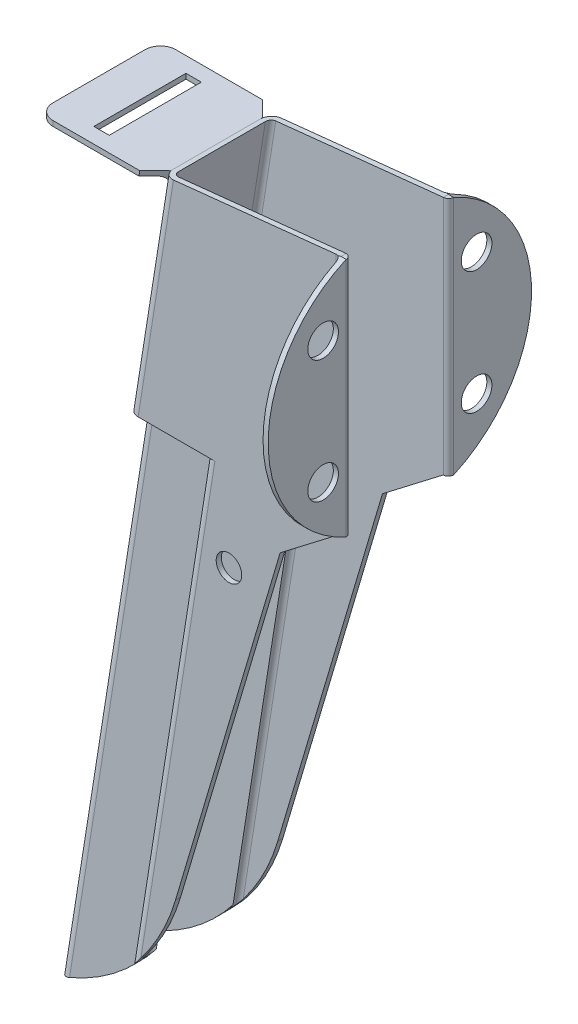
ISO-10303-21;
HEADER;
FILE_DESCRIPTION(('STEP AP214'),'2;1');
FILE_NAME('part.step','',(''),(''),'','','');
FILE_SCHEMA(('AUTOMOTIVE_DESIGN { 1 0 10303 214 1 1 1 1 }'));
ENDSEC;
DATA;
#1=APPLICATION_CONTEXT('core data for automotive mechanical design processes');
#2=APPLICATION_PROTOCOL_DEFINITION('international standard','automotive_design',2000,#1);
#3=PRODUCT_CONTEXT('',#1,'mechanical');
#4=PRODUCT('Part','Part','',(#3));
#5=PRODUCT_RELATED_PRODUCT_CATEGORY('part','',(#4));
#6=PRODUCT_DEFINITION_FORMATION('','',#4);
#7=PRODUCT_DEFINITION_CONTEXT('part definition',#1,'design');
#8=PRODUCT_DEFINITION('design','',#6,#7);
#9=PRODUCT_DEFINITION_SHAPE('','',#8);
#10=(LENGTH_UNIT() NAMED_UNIT(*) SI_UNIT(.MILLI.,.METRE.));
#11=(NAMED_UNIT(*) PLANE_ANGLE_UNIT() SI_UNIT($,.RADIAN.));
#12=(NAMED_UNIT(*) SI_UNIT($,.STERADIAN.) SOLID_ANGLE_UNIT());
#13=UNCERTAINTY_MEASURE_WITH_UNIT(LENGTH_MEASURE(1.E-05),#10,'distance_accuracy_value','');
#14=(GEOMETRIC_REPRESENTATION_CONTEXT(3) GLOBAL_UNCERTAINTY_ASSIGNED_CONTEXT((#13)) GLOBAL_UNIT_ASSIGNED_CONTEXT((#10,
#11,#12)) REPRESENTATION_CONTEXT('',''));
#15=CARTESIAN_POINT('',(0.,0.,0.));
#16=DIRECTION('',(0.,0.,1.));
#17=DIRECTION('',(1.,0.,0.));
#18=AXIS2_PLACEMENT_3D('',#15,#16,#17);
#19=CARTESIAN_POINT('',(-65.2698843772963,-195.985583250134,10.5));
#20=DIRECTION('',(-0.987688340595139,0.156434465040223,0.));
#21=DIRECTION('',(-0.156434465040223,-0.987688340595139,0.));
#22=AXIS2_PLACEMENT_3D('',#19,#20,#21);
#23=PLANE('',#22);
#24=CARTESIAN_POINT('',(-37.9508518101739,-23.5,0.));
#25=DIRECTION('',(-0.987688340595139,0.156434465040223,0.));
#26=DIRECTION('',(0.156434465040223,0.987688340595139,0.));
#27=AXIS2_PLACEMENT_3D('',#24,#25,#26);
#28=ELLIPSE('',#27,4.04986050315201,4.);
#29=CARTESIAN_POINT('',(-37.3173140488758,-19.5,0.));
#30=VERTEX_POINT('',#29);
#31=EDGE_CURVE('E178',#30,#30,#28,.T.);
#32=ORIENTED_EDGE('',*,*,#31,.F.);
#33=EDGE_LOOP('',(#32));
#34=FACE_BOUND('',#33,.T.);
#35=DIRECTION('',(0.156434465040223,0.987688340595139,0.));
#36=VECTOR('',#35,1.);
#37=CARTESIAN_POINT('',(-65.2698843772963,-195.985583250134,8.5));
#38=LINE('',#37,#36);
#39=CARTESIAN_POINT('',(-41.6728861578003,-47.,8.5));
#40=VERTEX_POINT('',#39);
#41=CARTESIAN_POINT('',(-35.1498120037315,-5.81493067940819,8.5));
#42=VERTEX_POINT('',#41);
#43=EDGE_CURVE('E1032',#40,#42,#38,.T.);
#44=ORIENTED_EDGE('',*,*,#43,.T.);
#45=DIRECTION('',(0.,0.,-1.));
#46=VECTOR('',#45,1.);
#47=CARTESIAN_POINT('',(-35.1498120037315,-5.8149306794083,10.5));
#48=LINE('',#47,#46);
#49=CARTESIAN_POINT('',(-35.1498120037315,-5.81493067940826,-8.5));
#50=VERTEX_POINT('',#49);
#51=EDGE_CURVE('E106',#42,#50,#48,.T.);
#52=ORIENTED_EDGE('',*,*,#51,.T.);
#53=DIRECTION('',(0.156434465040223,0.987688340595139,0.));
#54=VECTOR('',#53,1.);
#55=CARTESIAN_POINT('',(-41.6728861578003,-46.9999999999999,-8.5));
#56=LINE('',#55,#54);
#57=CARTESIAN_POINT('',(-41.6728861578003,-47.,-8.49999999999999));
#58=VERTEX_POINT('',#57);
#59=EDGE_CURVE('E1034',#50,#58,#56,.F.);
#60=ORIENTED_EDGE('',*,*,#59,.T.);
#61=DIRECTION('',(0.,0.,-1.));
#62=VECTOR('',#61,1.);
#63=CARTESIAN_POINT('',(-41.6728861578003,-47.,10.5));
#64=LINE('',#63,#62);
#65=EDGE_CURVE('E438',#40,#58,#64,.T.);
#66=ORIENTED_EDGE('',*,*,#65,.F.);
#67=EDGE_LOOP('',(#44,#52,#60,#66));
#68=FACE_BOUND('',#67,.T.);
#69=ADVANCED_FACE('F33',(#34,#68),#23,.T.);
#70=CARTESIAN_POINT('',(-70.7124102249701,-113.79501516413,10.5));
#71=DIRECTION('',(0.,0.,-1.));
#72=DIRECTION('',(-1.,0.,0.));
#73=AXIS2_PLACEMENT_3D('',#70,#71,#72);
#74=CYLINDRICAL_SURFACE('',#73,40.);
#75=DIRECTION('',(0.,0.,-1.));
#76=VECTOR('',#75,1.);
#77=CARTESIAN_POINT('',(-32.3613586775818,-125.16149417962,10.5));
#78=LINE('',#77,#76);
#79=CARTESIAN_POINT('',(-32.3613586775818,-125.16149417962,-9.5));
#80=VERTEX_POINT('',#79);
#81=CARTESIAN_POINT('',(-32.3613586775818,-125.16149417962,-10.5));
#82=VERTEX_POINT('',#81);
#83=EDGE_CURVE('E472',#80,#82,#78,.T.);
#84=ORIENTED_EDGE('',*,*,#83,.F.);
#85=CARTESIAN_POINT('',(-70.7124102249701,-113.79501516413,-9.5));
#86=DIRECTION('',(0.,0.,1.));
#87=DIRECTION('',(1.,0.,0.));
#88=AXIS2_PLACEMENT_3D('',#85,#86,#87);
#89=CIRCLE('',#88,40.);
#90=CARTESIAN_POINT('',(-39.1112796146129,-138.317831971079,-9.5));
#91=VERTEX_POINT('',#90);
#92=EDGE_CURVE('E325',#80,#91,#89,.F.);
#93=ORIENTED_EDGE('',*,*,#92,.T.);
#94=CARTESIAN_POINT('',(-39.111281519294,-138.317834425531,-7.5));
#95=CARTESIAN_POINT('',(-39.1629213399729,-138.384382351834,-7.50003142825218));
#96=CARTESIAN_POINT('',(-39.2147899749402,-138.450785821,-7.50247484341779));
#97=CARTESIAN_POINT('',(-39.3188681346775,-138.583169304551,-7.51258345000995));
#98=CARTESIAN_POINT('',(-39.371078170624,-138.649147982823,-7.5202607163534));
#99=CARTESIAN_POINT('',(-39.4753959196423,-138.7801295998,-7.54122117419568));
#100=CARTESIAN_POINT('',(-39.527503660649,-138.845133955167,-7.55449519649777));
#101=CARTESIAN_POINT('',(-39.6313015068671,-138.973805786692,-7.58728764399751));
#102=CARTESIAN_POINT('',(-39.6829920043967,-139.037474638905,-7.60679926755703));
#103=CARTESIAN_POINT('',(-39.7750871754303,-139.150216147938,-7.64833719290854));
#104=CARTESIAN_POINT('',(-39.8156570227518,-139.199633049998,-7.66905355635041));
#105=CARTESIAN_POINT('',(-39.8959274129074,-139.296944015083,-7.71583450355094));
#106=CARTESIAN_POINT('',(-39.9356248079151,-139.344832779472,-7.74191576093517));
#107=CARTESIAN_POINT('',(-40.0232246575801,-139.450027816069,-7.80770226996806));
#108=CARTESIAN_POINT('',(-40.07065376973,-139.506641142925,-7.84918523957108));
#109=CARTESIAN_POINT('',(-40.1604001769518,-139.613214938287,-7.94437980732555));
#110=CARTESIAN_POINT('',(-40.2027466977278,-139.663213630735,-7.99801580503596));
#111=CARTESIAN_POINT('',(-40.2564982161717,-139.72642648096,-8.08600568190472));
#112=CARTESIAN_POINT('',(-40.2719484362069,-139.744557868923,-8.11433195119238));
#113=CARTESIAN_POINT('',(-40.300210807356,-139.777674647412,-8.17404042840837));
#114=CARTESIAN_POINT('',(-40.3130229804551,-139.792660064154,-8.20542261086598));
#115=CARTESIAN_POINT('',(-40.3352697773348,-139.818651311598,-8.27145903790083));
#116=CARTESIAN_POINT('',(-40.3446617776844,-139.829606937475,-8.30614819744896));
#117=CARTESIAN_POINT('',(-40.3588704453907,-139.84617150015,-8.37767175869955));
#118=CARTESIAN_POINT('',(-40.3636956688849,-139.851790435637,-8.41450201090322));
#119=CARTESIAN_POINT('',(-40.3678947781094,-139.856680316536,-8.48439818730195));
#120=CARTESIAN_POINT('',(-40.367856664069,-139.856635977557,-8.51738152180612));
#121=CARTESIAN_POINT('',(-40.3637874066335,-139.851897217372,-8.58276318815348));
#122=CARTESIAN_POINT('',(-40.3597551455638,-139.847201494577,-8.61516135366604));
#123=CARTESIAN_POINT('',(-40.3486222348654,-139.8342248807,-8.67561358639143));
#124=CARTESIAN_POINT('',(-40.341818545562,-139.826290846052,-8.70380054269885));
#125=CARTESIAN_POINT('',(-40.3257099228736,-139.807485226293,-8.75840140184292));
#126=CARTESIAN_POINT('',(-40.3164043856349,-139.796612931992,-8.78481487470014));
#127=CARTESIAN_POINT('',(-40.2893349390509,-139.764942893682,-8.85156189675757));
#128=CARTESIAN_POINT('',(-40.2699169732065,-139.742185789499,-8.89029309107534));
#129=CARTESIAN_POINT('',(-40.2274850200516,-139.692320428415,-8.96265357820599));
#130=CARTESIAN_POINT('',(-40.2044603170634,-139.665199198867,-8.99626705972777));
#131=CARTESIAN_POINT('',(-40.1395257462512,-139.588476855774,-9.08023252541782));
#132=CARTESIAN_POINT('',(-40.0954396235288,-139.536152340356,-9.12637948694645));
#133=CARTESIAN_POINT('',(-40.0037862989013,-139.426744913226,-9.20830505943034));
#134=CARTESIAN_POINT('',(-39.956210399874,-139.369650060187,-9.24405658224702));
#135=CARTESIAN_POINT('',(-39.8624427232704,-139.256447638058,-9.30501019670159));
#136=CARTESIAN_POINT('',(-39.8163708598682,-139.200528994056,-9.33075754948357));
#137=CARTESIAN_POINT('',(-39.7233053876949,-139.086926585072,-9.37604807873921));
#138=CARTESIAN_POINT('',(-39.6763109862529,-139.029241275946,-9.39558564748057));
#139=CARTESIAN_POINT('',(-39.5818596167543,-138.912627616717,-9.42924735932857));
#140=CARTESIAN_POINT('',(-39.5344023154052,-138.853698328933,-9.44336725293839));
#141=CARTESIAN_POINT('',(-39.4393574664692,-138.734982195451,-9.46673961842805));
#142=CARTESIAN_POINT('',(-39.3917698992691,-138.675195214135,-9.47599131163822));
#143=CARTESIAN_POINT('',(-39.3051889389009,-138.565772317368,-9.48876532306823));
#144=CARTESIAN_POINT('',(-39.2661793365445,-138.516231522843,-9.49301601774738));
#145=CARTESIAN_POINT('',(-39.1885000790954,-138.41709964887,-9.4986219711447));
#146=CARTESIAN_POINT('',(-39.1498296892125,-138.367509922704,-9.49999086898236));
#147=CARTESIAN_POINT('',(-39.1112796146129,-138.317831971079,-9.5));
#148=B_SPLINE_CURVE_WITH_KNOTS('',3,(#94,#95,#96,#97,#98,#99,#100,#101,#102,#103,#104,#105,#106,
#107,#108,#109,#110,#111,#112,#113,#114,#115,#116,#117,#118,#119,#120,#121,#122,#123,#124,#125,
#126,#127,#128,#129,#130,#131,#132,#133,#134,#135,#136,#137,#138,#139,#140,#141,#142,#143,#144,
#145,#146,#147),.UNSPECIFIED.,.F.,.F.,(4,2,2,2,2,2,2,2,2,2,2,2,2,2,2,2,2,2,2,2,2,2,2,2,2,2,4),
(0.,0.252706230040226,0.505997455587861,0.75887531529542,1.01147836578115,1.21291432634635,
1.41498605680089,1.66832161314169,1.92012252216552,2.03088191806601,2.14164039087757,
2.25373541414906,2.36562000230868,2.46399176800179,2.56239106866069,2.65224293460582,
2.74211650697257,2.88808869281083,3.03450309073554,3.2807028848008,3.52753858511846,
3.75788176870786,3.98843237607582,4.2191634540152,4.4499314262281,4.63946327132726,
4.82809605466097),.UNSPECIFIED.);
#149=CARTESIAN_POINT('',(-39.111281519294,-138.317834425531,-7.5));
#150=VERTEX_POINT('',#149);
#151=EDGE_CURVE('E318',#150,#91,#148,.T.);
#152=ORIENTED_EDGE('',*,*,#151,.F.);
#153=CARTESIAN_POINT('',(-70.7124102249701,-113.79501516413,-7.5));
#154=DIRECTION('',(0.,0.,1.));
#155=DIRECTION('',(1.,0.,0.));
#156=AXIS2_PLACEMENT_3D('',#153,#154,#155);
#157=CIRCLE('',#156,40.);
#158=CARTESIAN_POINT('',(-55.0572487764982,-150.604197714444,-7.5));
#159=VERTEX_POINT('',#158);
#160=EDGE_CURVE('E303',#150,#159,#157,.F.);
#161=ORIENTED_EDGE('',*,*,#160,.T.);
#162=CARTESIAN_POINT('',(-56.1396883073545,-151.045998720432,-6.5));
#163=CARTESIAN_POINT('',(-56.1396899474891,-151.045999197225,-6.52533700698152));
#164=CARTESIAN_POINT('',(-56.1386481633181,-151.04559182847,-6.55066077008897));
#165=CARTESIAN_POINT('',(-56.1345043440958,-151.043970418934,-6.6011050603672));
#166=CARTESIAN_POINT('',(-56.1314029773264,-151.042756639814,-6.62622565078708));
#167=CARTESIAN_POINT('',(-56.1190903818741,-151.03793526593,-6.70078787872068));
#168=CARTESIAN_POINT('',(-56.1068700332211,-151.033147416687,-6.7496919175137));
#169=CARTESIAN_POINT('',(-56.0750149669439,-151.020637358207,-6.84452830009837));
#170=CARTESIAN_POINT('',(-56.0553863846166,-151.012917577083,-6.89046306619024));
#171=CARTESIAN_POINT('',(-56.0095796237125,-150.99484549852,-6.97840708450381));
#172=CARTESIAN_POINT('',(-55.9833959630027,-150.984490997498,-7.02041301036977));
#173=CARTESIAN_POINT('',(-55.9240257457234,-150.9609236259,-7.10170254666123));
#174=CARTESIAN_POINT('',(-55.8905519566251,-150.947592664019,-7.140740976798));
#175=CARTESIAN_POINT('',(-55.8186765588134,-150.918837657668,-7.21305047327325));
#176=CARTESIAN_POINT('',(-55.7802741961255,-150.903413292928,-7.24632065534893));
#177=CARTESIAN_POINT('',(-55.694400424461,-150.868749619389,-7.31073271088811));
#178=CARTESIAN_POINT('',(-55.6463986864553,-150.849274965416,-7.34103985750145));
#179=CARTESIAN_POINT('',(-55.5468618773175,-150.808648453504,-7.39379634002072));
#180=CARTESIAN_POINT('',(-55.49532197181,-150.787494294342,-7.41623465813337));
#181=CARTESIAN_POINT('',(-55.3803466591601,-150.740005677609,-7.45658496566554));
#182=CARTESIAN_POINT('',(-55.3164577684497,-150.713430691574,-7.47292201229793));
#183=CARTESIAN_POINT('',(-55.1874083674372,-150.659352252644,-7.49461967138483));
#184=CARTESIAN_POINT('',(-55.1222514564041,-150.631851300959,-7.500007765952));
#185=CARTESIAN_POINT('',(-55.0572487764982,-150.604197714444,-7.5));
#186=B_SPLINE_CURVE_WITH_KNOTS('',3,(#162,#163,#164,#165,#166,#167,#168,#169,#170,#171,#172,
#173,#174,#175,#176,#177,#178,#179,#180,#181,#182,#183,#184,#185),.UNSPECIFIED.,.F.,.F.,(4,2,2,
2,2,2,2,2,2,2,2,4),(0.,0.0759605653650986,0.151896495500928,0.302993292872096,0.453965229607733,
0.605063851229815,0.763805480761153,0.922571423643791,1.10191471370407,1.28150812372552,
1.49389923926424,1.70575658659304),.UNSPECIFIED.);
#187=CARTESIAN_POINT('',(-56.1396883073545,-151.045998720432,-6.5));
#188=VERTEX_POINT('',#187);
#189=EDGE_CURVE('E295',#188,#159,#186,.T.);
#190=ORIENTED_EDGE('',*,*,#189,.F.);
#191=DIRECTION('',(0.,0.,-1.));
#192=VECTOR('',#191,1.);
#193=CARTESIAN_POINT('',(-56.1396883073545,-151.045998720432,6.5));
#194=LINE('',#193,#192);
#195=CARTESIAN_POINT('',(-56.1396883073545,-151.045998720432,6.5));
#196=VERTEX_POINT('',#195);
#197=EDGE_CURVE('E302',#196,#188,#194,.T.);
#198=ORIENTED_EDGE('',*,*,#197,.F.);
#199=CARTESIAN_POINT('',(-55.0572487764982,-150.604197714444,7.5));
#200=CARTESIAN_POINT('',(-55.1353677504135,-150.637438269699,7.50002313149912));
#201=CARTESIAN_POINT('',(-55.2137682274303,-150.67047311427,7.4922262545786));
#202=CARTESIAN_POINT('',(-55.3686196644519,-150.735167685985,7.46072102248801));
#203=CARTESIAN_POINT('',(-55.4450504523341,-150.76681456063,7.43688805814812));
#204=CARTESIAN_POINT('',(-55.5837984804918,-150.823789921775,7.37664739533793));
#205=CARTESIAN_POINT('',(-55.6467339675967,-150.849428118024,7.34196858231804));
#206=CARTESIAN_POINT('',(-55.7651056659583,-150.8973347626,7.26016470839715));
#207=CARTESIAN_POINT('',(-55.8205738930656,-150.919617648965,7.21309551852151));
#208=CARTESIAN_POINT('',(-55.9073193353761,-150.954278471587,7.12181202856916));
#209=CARTESIAN_POINT('',(-55.9410671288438,-150.967699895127,7.08032477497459));
#210=CARTESIAN_POINT('',(-56.001762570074,-150.991761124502,6.99184241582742));
#211=CARTESIAN_POINT('',(-56.0287080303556,-151.00240003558,6.94484554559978));
#212=CARTESIAN_POINT('',(-56.0746075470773,-151.020481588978,6.84618539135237));
#213=CARTESIAN_POINT('',(-56.0935160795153,-151.027906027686,6.79449748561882));
#214=CARTESIAN_POINT('',(-56.1220168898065,-151.039083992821,6.68829053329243));
#215=CARTESIAN_POINT('',(-56.1316315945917,-151.042846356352,6.63377863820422));
#216=CARTESIAN_POINT('',(-56.1374468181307,-151.045121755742,6.56576068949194));
#217=CARTESIAN_POINT('',(-56.1382875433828,-151.045450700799,6.55261513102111));
#218=CARTESIAN_POINT('',(-56.1394073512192,-151.045888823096,6.52631492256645));
#219=CARTESIAN_POINT('',(-56.1396872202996,-151.045998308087,6.51316031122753));
#220=CARTESIAN_POINT('',(-56.1396883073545,-151.045998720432,6.5));
#221=B_SPLINE_CURVE_WITH_KNOTS('',3,(#199,#200,#201,#202,#203,#204,#205,#206,#207,#208,#209,
#210,#211,#212,#213,#214,#215,#216,#217,#218,#219,#220),.UNSPECIFIED.,.F.,.F.,(4,2,2,2,2,2,2,2,
2,2,4),(0.,0.254638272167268,0.511278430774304,0.738866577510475,0.96544555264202,
1.13018422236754,1.29497580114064,1.46068876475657,1.62600084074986,1.66552241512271,
1.70498852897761),.UNSPECIFIED.);
#222=CARTESIAN_POINT('',(-55.0572487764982,-150.604197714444,7.5));
#223=VERTEX_POINT('',#222);
#224=EDGE_CURVE('E280',#223,#196,#221,.T.);
#225=ORIENTED_EDGE('',*,*,#224,.F.);
#226=CARTESIAN_POINT('',(-70.7124102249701,-113.79501516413,7.5));
#227=DIRECTION('',(0.,0.,1.));
#228=DIRECTION('',(1.,0.,0.));
#229=AXIS2_PLACEMENT_3D('',#226,#227,#228);
#230=CIRCLE('',#229,40.);
#231=CARTESIAN_POINT('',(-39.1112815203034,-138.317834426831,7.5));
#232=VERTEX_POINT('',#231);
#233=EDGE_CURVE('E365',#232,#223,#230,.F.);
#234=ORIENTED_EDGE('',*,*,#233,.F.);
#235=CARTESIAN_POINT('',(-39.1112796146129,-138.317831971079,9.5));
#236=CARTESIAN_POINT('',(-39.162919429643,-138.384379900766,9.49996863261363));
#237=CARTESIAN_POINT('',(-39.2147880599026,-138.450783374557,9.49752527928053));
#238=CARTESIAN_POINT('',(-39.3188662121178,-138.583166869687,9.48741680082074));
#239=CARTESIAN_POINT('',(-39.3710762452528,-138.649145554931,9.47973960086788));
#240=CARTESIAN_POINT('',(-39.4753939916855,-138.780127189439,9.45877928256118));
#241=CARTESIAN_POINT('',(-39.5275017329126,-138.845131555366,9.4455053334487));
#242=CARTESIAN_POINT('',(-39.6312995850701,-138.973803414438,9.41271304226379));
#243=CARTESIAN_POINT('',(-39.6829900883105,-139.037472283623,9.39320150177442));
#244=CARTESIAN_POINT('',(-39.7750853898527,-139.150213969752,9.35166368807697));
#245=CARTESIAN_POINT('',(-39.8156553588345,-139.199631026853,9.33094733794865));
#246=CARTESIAN_POINT('',(-39.8959259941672,-139.296942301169,9.28416639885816));
#247=CARTESIAN_POINT('',(-39.9356235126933,-139.34483121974,9.25808513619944));
#248=CARTESIAN_POINT('',(-40.0232235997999,-139.450026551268,9.19229861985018));
#249=CARTESIAN_POINT('',(-40.0706528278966,-139.50664002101,9.15081564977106));
#250=CARTESIAN_POINT('',(-40.1603994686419,-139.61321410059,9.05562105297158));
#251=CARTESIAN_POINT('',(-40.2027461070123,-139.663212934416,9.00198502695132));
#252=CARTESIAN_POINT('',(-40.2564977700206,-139.726425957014,8.91399510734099));
#253=CARTESIAN_POINT('',(-40.2719480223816,-139.744557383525,8.88566884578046));
#254=CARTESIAN_POINT('',(-40.3002104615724,-139.777674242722,8.82596037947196));
#255=CARTESIAN_POINT('',(-40.313022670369,-139.792659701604,8.79457820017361));
#256=CARTESIAN_POINT('',(-40.3352695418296,-139.818651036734,8.72854177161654));
#257=CARTESIAN_POINT('',(-40.3446615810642,-139.829606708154,8.69385260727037));
#258=CARTESIAN_POINT('',(-40.3588703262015,-139.846171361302,8.62232902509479));
#259=CARTESIAN_POINT('',(-40.3636955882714,-139.851790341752,8.58549875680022));
#260=CARTESIAN_POINT('',(-40.3678947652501,-139.85668030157,8.51560253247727));
#261=CARTESIAN_POINT('',(-40.3678566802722,-139.856635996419,8.48261916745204));
#262=CARTESIAN_POINT('',(-40.3637874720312,-139.851897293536,8.41723743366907));
#263=CARTESIAN_POINT('',(-40.3597552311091,-139.847201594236,8.38483923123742));
#264=CARTESIAN_POINT('',(-40.3486223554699,-139.834225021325,8.32438695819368));
#265=CARTESIAN_POINT('',(-40.3418186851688,-139.826291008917,8.29619999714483));
#266=CARTESIAN_POINT('',(-40.3257100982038,-139.807485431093,8.24159912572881));
#267=CARTESIAN_POINT('',(-40.3164045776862,-139.796613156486,8.21518564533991));
#268=CARTESIAN_POINT('',(-40.2893351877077,-139.764943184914,8.14843864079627));
#269=CARTESIAN_POINT('',(-40.2699172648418,-139.742186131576,8.10970746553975));
#270=CARTESIAN_POINT('',(-40.2274853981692,-139.692320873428,8.03734700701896));
#271=CARTESIAN_POINT('',(-40.2044607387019,-139.665199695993,8.00373353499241));
#272=CARTESIAN_POINT('',(-40.1395262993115,-139.58847751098,7.91976810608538));
#273=CARTESIAN_POINT('',(-40.0954402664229,-139.53615310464,7.87362116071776));
#274=CARTESIAN_POINT('',(-40.0037871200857,-139.426745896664,7.79169560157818));
#275=CARTESIAN_POINT('',(-39.9562113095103,-139.369651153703,7.7559440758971));
#276=CARTESIAN_POINT('',(-39.862443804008,-139.256448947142,7.69499044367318));
#277=CARTESIAN_POINT('',(-39.816372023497,-139.200530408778,7.66924307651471));
#278=CARTESIAN_POINT('',(-39.723306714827,-139.086928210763,7.6239525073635));
#279=CARTESIAN_POINT('',(-39.6763123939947,-139.029243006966,7.6044149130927));
#280=CARTESIAN_POINT('',(-39.5818611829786,-138.91262955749,7.57075314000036));
#281=CARTESIAN_POINT('',(-39.5344039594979,-138.853700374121,7.55663321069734));
#282=CARTESIAN_POINT('',(-39.4393592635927,-138.734984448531,7.53326076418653));
#283=CARTESIAN_POINT('',(-39.3917717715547,-138.67519757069,7.52400902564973));
#284=CARTESIAN_POINT('',(-39.305190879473,-138.565774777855,7.51123491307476));
#285=CARTESIAN_POINT('',(-39.2661812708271,-138.516233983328,7.50698416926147));
#286=CARTESIAN_POINT('',(-39.18850199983,-138.417102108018,7.50137812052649));
#287=CARTESIAN_POINT('',(-39.1498316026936,-138.367512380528,7.50000917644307));
#288=CARTESIAN_POINT('',(-39.1112815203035,-138.317834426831,7.50000000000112));
#289=B_SPLINE_CURVE_WITH_KNOTS('',3,(#235,#236,#237,#238,#239,#240,#241,#242,#243,#244,#245,
#246,#247,#248,#249,#250,#251,#252,#253,#254,#255,#256,#257,#258,#259,#260,#261,#262,#263,#264,
#265,#266,#267,#268,#269,#270,#271,#272,#273,#274,#275,#276,#277,#278,#279,#280,#281,#282,#283,
#284,#285,#286,#287,#288),.UNSPECIFIED.,.F.,.F.,(4,2,2,2,2,2,2,2,2,2,2,2,2,2,2,2,2,2,2,2,2,2,2,
2,2,2,4),(0.,0.252706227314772,0.505997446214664,0.758875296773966,1.01147833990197,
1.21291484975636,1.41498713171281,1.66832316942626,1.92012455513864,2.03088403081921,
2.14164258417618,2.25373768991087,2.36562235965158,2.46399421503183,2.56239360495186,
2.65224545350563,2.74211900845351,2.88809102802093,3.03450525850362,3.28070467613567,
3.52753999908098,3.75788281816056,3.98843306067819,4.21916377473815,4.44993138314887,
4.63946324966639,4.82809605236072),.UNSPECIFIED.);
#290=CARTESIAN_POINT('',(-39.1112796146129,-138.317831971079,9.5));
#291=VERTEX_POINT('',#290);
#292=EDGE_CURVE('E289',#291,#232,#289,.T.);
#293=ORIENTED_EDGE('',*,*,#292,.F.);
#294=CARTESIAN_POINT('',(-70.7124102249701,-113.79501516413,9.5));
#295=DIRECTION('',(0.,0.,1.));
#296=DIRECTION('',(1.,0.,0.));
#297=AXIS2_PLACEMENT_3D('',#294,#295,#296);
#298=CIRCLE('',#297,40.);
#299=CARTESIAN_POINT('',(-32.3613586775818,-125.16149417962,9.5));
#300=VERTEX_POINT('',#299);
#301=EDGE_CURVE('E394',#300,#291,#298,.F.);
#302=ORIENTED_EDGE('',*,*,#301,.F.);
#303=CARTESIAN_POINT('',(-32.3613586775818,-125.16149417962,10.5));
#304=VERTEX_POINT('',#303);
#305=EDGE_CURVE('E473',#304,#300,#78,.T.);
#306=ORIENTED_EDGE('',*,*,#305,.F.);
#307=CARTESIAN_POINT('',(-70.7124102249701,-113.79501516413,10.5));
#308=DIRECTION('',(0.,0.,1.));
#309=DIRECTION('',(1.,0.,0.));
#310=AXIS2_PLACEMENT_3D('',#307,#308,#309);
#311=CIRCLE('',#310,40.);
#312=CARTESIAN_POINT('',(-39.1112796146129,-138.317831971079,10.5));
#313=VERTEX_POINT('',#312);
#314=EDGE_CURVE('E422',#304,#313,#311,.F.);
#315=ORIENTED_EDGE('',*,*,#314,.T.);
#316=CARTESIAN_POINT('',(-39.1112796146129,-138.317831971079,10.5));
#317=CARTESIAN_POINT('',(-39.1627700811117,-138.384184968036,10.4999969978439));
#318=CARTESIAN_POINT('',(-39.2144670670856,-138.450372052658,10.498771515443));
#319=CARTESIAN_POINT('',(-39.3182374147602,-138.582370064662,10.4937667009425));
#320=CARTESIAN_POINT('',(-39.3703108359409,-138.64818092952,10.4899869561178));
#321=CARTESIAN_POINT('',(-39.5273289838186,-138.845343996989,10.4746228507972));
#322=CARTESIAN_POINT('',(-39.6327621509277,-138.976027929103,10.4590122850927));
#323=CARTESIAN_POINT('',(-39.8449719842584,-139.235722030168,10.4157288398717));
#324=CARTESIAN_POINT('',(-39.9517529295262,-139.364715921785,10.3879786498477));
#325=CARTESIAN_POINT('',(-40.1649681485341,-139.619058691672,10.3186963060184));
#326=CARTESIAN_POINT('',(-40.2714027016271,-139.744412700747,10.2771846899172));
#327=CARTESIAN_POINT('',(-40.4175848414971,-139.914499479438,10.2084775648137));
#328=CARTESIAN_POINT('',(-40.4580910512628,-139.961404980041,10.1881770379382));
#329=CARTESIAN_POINT('',(-40.5387216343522,-140.054343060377,10.1449884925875));
#330=CARTESIAN_POINT('',(-40.5788460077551,-140.100375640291,10.1221004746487));
#331=CARTESIAN_POINT('',(-40.698420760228,-140.236933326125,10.0492759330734));
#332=CARTESIAN_POINT('',(-40.777114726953,-140.325967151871,9.99515972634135));
#333=CARTESIAN_POINT('',(-40.9313867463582,-140.499025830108,9.87344653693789));
#334=CARTESIAN_POINT('',(-41.0069348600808,-140.583004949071,9.80574524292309));
#335=CARTESIAN_POINT('',(-41.1514209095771,-140.74235979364,9.65476615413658));
#336=CARTESIAN_POINT('',(-41.2203710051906,-140.817751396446,9.57151788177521));
#337=CARTESIAN_POINT('',(-41.3235229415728,-140.929805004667,9.42130861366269));
#338=CARTESIAN_POINT('',(-41.3611445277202,-140.970478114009,9.35971200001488));
#339=CARTESIAN_POINT('',(-41.4301307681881,-141.044798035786,9.22912836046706));
#340=CARTESIAN_POINT('',(-41.4615009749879,-141.078451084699,9.16014797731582));
#341=CARTESIAN_POINT('',(-41.5117314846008,-141.132197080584,9.02612043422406));
#342=CARTESIAN_POINT('',(-41.5317616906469,-141.153566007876,8.96203129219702));
#343=CARTESIAN_POINT('',(-41.564246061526,-141.188173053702,8.82990247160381));
#344=CARTESIAN_POINT('',(-41.5767180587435,-141.201430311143,8.76187250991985));
#345=CARTESIAN_POINT('',(-41.5886201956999,-141.214075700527,8.66099412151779));
#346=CARTESIAN_POINT('',(-41.5914564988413,-141.217087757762,8.62894893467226));
#347=CARTESIAN_POINT('',(-41.5952511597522,-141.221116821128,8.56460873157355));
#348=CARTESIAN_POINT('',(-41.5962086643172,-141.222132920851,8.53231360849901));
#349=CARTESIAN_POINT('',(-41.5962054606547,-141.222129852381,8.49999999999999));
#350=B_SPLINE_CURVE_WITH_KNOTS('',3,(#316,#317,#318,#319,#320,#321,#322,#323,#324,#325,#326,
#327,#328,#329,#330,#331,#332,#333,#334,#335,#336,#337,#338,#339,#340,#341,#342,#343,#344,#345,
#346,#347,#348,#349),.UNSPECIFIED.,.F.,.F.,(4,2,2,2,2,2,2,2,2,2,2,2,2,2,2,2,4),(0.,
0.251944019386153,0.503928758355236,1.00940973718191,1.51815780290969,2.0261500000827,
2.22174556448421,2.41734108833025,2.80833140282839,3.20244742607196,3.59582252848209,
3.8437010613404,4.09135843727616,4.30192721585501,4.51199723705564,4.60882875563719,
4.70570423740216),.UNSPECIFIED.);
#351=CARTESIAN_POINT('',(-41.5962054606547,-141.222129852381,8.5));
#352=VERTEX_POINT('',#351);
#353=EDGE_CURVE('E1012',#313,#352,#350,.T.);
#354=ORIENTED_EDGE('',*,*,#353,.T.);
#355=CARTESIAN_POINT('',(-70.7124102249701,-113.79501516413,8.5));
#356=DIRECTION('',(0.,0.,1.));
#357=DIRECTION('',(1.,0.,0.));
#358=AXIS2_PLACEMENT_3D('',#355,#356,#357);
#359=CIRCLE('',#358,40.);
#360=CARTESIAN_POINT('',(-55.0572487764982,-150.604197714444,8.5));
#361=VERTEX_POINT('',#360);
#362=EDGE_CURVE('E395',#352,#361,#359,.F.);
#363=ORIENTED_EDGE('',*,*,#362,.T.);
#364=CARTESIAN_POINT('',(-55.0572487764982,-150.604197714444,8.5));
#365=CARTESIAN_POINT('',(-55.135501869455,-150.637480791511,8.49998540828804));
#366=CARTESIAN_POINT('',(-55.2138162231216,-150.670491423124,8.49609929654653));
#367=CARTESIAN_POINT('',(-55.3700499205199,-150.735767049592,8.48043500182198));
#368=CARTESIAN_POINT('',(-55.4479688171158,-150.768031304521,8.46864930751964));
#369=CARTESIAN_POINT('',(-55.6811010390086,-150.863706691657,8.4210314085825));
#370=CARTESIAN_POINT('',(-55.8346918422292,-150.925576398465,8.37293428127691));
#371=CARTESIAN_POINT('',(-56.1117136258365,-151.035304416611,8.25180026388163));
#372=CARTESIAN_POINT('',(-56.2365214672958,-151.083948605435,8.18260167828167));
#373=CARTESIAN_POINT('',(-56.4712707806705,-151.174229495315,8.01953785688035));
#374=CARTESIAN_POINT('',(-56.5812656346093,-151.215891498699,7.92576498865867));
#375=CARTESIAN_POINT('',(-56.7669222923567,-151.285439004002,7.72952953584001));
#376=CARTESIAN_POINT('',(-56.8452182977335,-151.31442718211,7.629978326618));
#377=CARTESIAN_POINT('',(-56.9477110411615,-151.352096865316,7.46990279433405));
#378=CARTESIAN_POINT('',(-56.9793889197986,-151.363686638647,7.41473904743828));
#379=CARTESIAN_POINT('',(-57.0372926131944,-151.384802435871,7.30126108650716));
#380=CARTESIAN_POINT('',(-57.0635218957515,-151.39432977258,7.24294890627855));
#381=CARTESIAN_POINT('',(-57.107824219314,-151.410380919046,7.12949813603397));
#382=CARTESIAN_POINT('',(-57.12644132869,-151.417106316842,7.07459958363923));
#383=CARTESIAN_POINT('',(-57.1585906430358,-151.428700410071,6.96314646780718));
#384=CARTESIAN_POINT('',(-57.1721237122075,-151.43356942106,6.90659218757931));
#385=CARTESIAN_POINT('',(-57.1939509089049,-151.441414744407,6.79201425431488));
#386=CARTESIAN_POINT('',(-57.2022146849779,-151.4443800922,6.73398405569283));
#387=CARTESIAN_POINT('',(-57.2132667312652,-151.448343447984,6.6173049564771));
#388=CARTESIAN_POINT('',(-57.2160518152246,-151.44934031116,6.55865571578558));
#389=CARTESIAN_POINT('',(-57.2160357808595,-151.449335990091,6.5));
#390=B_SPLINE_CURVE_WITH_KNOTS('',3,(#364,#365,#366,#367,#368,#369,#370,#371,#372,#373,#374,
#375,#376,#377,#378,#379,#380,#381,#382,#383,#384,#385,#386,#387,#388,#389),.UNSPECIFIED.,.F.,
.F.,(4,2,2,2,2,2,2,2,2,2,2,2,4),(0.,0.254914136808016,0.510071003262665,1.02358715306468,
1.47334051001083,1.92142703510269,2.30863735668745,2.50233072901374,2.69590044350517,
2.87071254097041,3.0454949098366,3.22127515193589,3.39715759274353),.UNSPECIFIED.);
#391=CARTESIAN_POINT('',(-57.2160357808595,-151.449335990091,6.5));
#392=VERTEX_POINT('',#391);
#393=EDGE_CURVE('E476',#361,#392,#390,.T.);
#394=ORIENTED_EDGE('',*,*,#393,.T.);
#395=DIRECTION('',(0.,0.,-1.));
#396=VECTOR('',#395,1.);
#397=CARTESIAN_POINT('',(-57.2160357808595,-151.449335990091,8.5));
#398=LINE('',#397,#396);
#399=CARTESIAN_POINT('',(-57.2160357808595,-151.449335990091,-6.5));
#400=VERTEX_POINT('',#399);
#401=EDGE_CURVE('E405',#392,#400,#398,.T.);
#402=ORIENTED_EDGE('',*,*,#401,.T.);
#403=CARTESIAN_POINT('',(-57.2160357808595,-151.449335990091,-6.5));
#404=CARTESIAN_POINT('',(-57.2160446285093,-151.449338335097,-6.55114117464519));
#405=CARTESIAN_POINT('',(-57.2139304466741,-151.448581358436,-6.60227787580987));
#406=CARTESIAN_POINT('',(-57.2055237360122,-151.445567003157,-6.7041482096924));
#407=CARTESIAN_POINT('',(-57.1992323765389,-151.443310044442,-6.75488195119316));
#408=CARTESIAN_POINT('',(-57.1825704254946,-151.437325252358,-6.85539143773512));
#409=CARTESIAN_POINT('',(-57.1722153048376,-151.43360299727,-6.90517007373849));
#410=CARTESIAN_POINT('',(-57.1475625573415,-151.424725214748,-7.00359777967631));
#411=CARTESIAN_POINT('',(-57.1332648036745,-151.419569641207,-7.05224681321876));
#412=CARTESIAN_POINT('',(-57.0847098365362,-151.4020222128,-7.19593149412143));
#413=CARTESIAN_POINT('',(-57.0447643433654,-151.387540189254,-7.28886171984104));
#414=CARTESIAN_POINT('',(-56.9514562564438,-151.353484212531,-7.46667084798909));
#415=CARTESIAN_POINT('',(-56.8980842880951,-151.333906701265,-7.55154406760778));
#416=CARTESIAN_POINT('',(-56.7773395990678,-151.289256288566,-7.71515784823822));
#417=CARTESIAN_POINT('',(-56.7094529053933,-151.263978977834,-7.79346240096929));
#418=CARTESIAN_POINT('',(-56.5636699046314,-151.209173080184,-7.93831052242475));
#419=CARTESIAN_POINT('',(-56.4857722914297,-151.179643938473,-8.00485255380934));
#420=CARTESIAN_POINT('',(-56.3127705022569,-151.113373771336,-8.13252480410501));
#421=CARTESIAN_POINT('',(-56.2167182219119,-151.076193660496,-8.19214018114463));
#422=CARTESIAN_POINT('',(-56.0177451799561,-150.998217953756,-8.29565362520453));
#423=CARTESIAN_POINT('',(-55.914814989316,-150.957417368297,-8.33952956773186));
#424=CARTESIAN_POINT('',(-55.6877005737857,-150.866233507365,-8.41731913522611));
#425=CARTESIAN_POINT('',(-55.562768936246,-150.815366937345,-8.44847853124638));
#426=CARTESIAN_POINT('',(-55.3108179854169,-150.711272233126,-8.48980241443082));
#427=CARTESIAN_POINT('',(-55.1838051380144,-150.658050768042,-8.50002274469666));
#428=CARTESIAN_POINT('',(-55.0572487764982,-150.604197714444,-8.5));
#429=B_SPLINE_CURVE_WITH_KNOTS('',3,(#403,#404,#405,#406,#407,#408,#409,#410,#411,#412,#413,
#414,#415,#416,#417,#418,#419,#420,#421,#422,#423,#424,#425,#426,#427,#428),.UNSPECIFIED.,.F.,
.F.,(4,2,2,2,2,2,2,2,2,2,2,2,4),(0.,0.153366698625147,0.306690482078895,0.459436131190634,
0.612186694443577,0.917215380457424,1.22245763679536,1.54117218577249,1.8599283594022,
2.21553291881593,2.57163540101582,2.98526217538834,3.39778439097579),.UNSPECIFIED.);
#430=CARTESIAN_POINT('',(-55.0572487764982,-150.604197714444,-8.5));
#431=VERTEX_POINT('',#430);
#432=EDGE_CURVE('E484',#400,#431,#429,.T.);
#433=ORIENTED_EDGE('',*,*,#432,.T.);
#434=CARTESIAN_POINT('',(-70.7124102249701,-113.79501516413,-8.5));
#435=DIRECTION('',(0.,0.,1.));
#436=DIRECTION('',(1.,0.,0.));
#437=AXIS2_PLACEMENT_3D('',#434,#435,#436);
#438=CIRCLE('',#437,40.);
#439=CARTESIAN_POINT('',(-41.5962054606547,-141.222129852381,-8.5));
#440=VERTEX_POINT('',#439);
#441=EDGE_CURVE('E376',#440,#431,#438,.F.);
#442=ORIENTED_EDGE('',*,*,#441,.F.);
#443=CARTESIAN_POINT('',(-41.5962054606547,-141.222129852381,-8.5));
#444=CARTESIAN_POINT('',(-41.5962209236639,-141.222145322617,-8.53957321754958));
#445=CARTESIAN_POINT('',(-41.5947765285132,-141.220612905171,-8.57913322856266));
#446=CARTESIAN_POINT('',(-41.589088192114,-141.214572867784,-8.65776927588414));
#447=CARTESIAN_POINT('',(-41.584848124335,-141.210069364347,-8.69684590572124));
#448=CARTESIAN_POINT('',(-41.573758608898,-141.198282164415,-8.77368012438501));
#449=CARTESIAN_POINT('',(-41.5669428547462,-141.191034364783,-8.81144814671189));
#450=CARTESIAN_POINT('',(-41.5508995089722,-141.17395654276,-8.88586771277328));
#451=CARTESIAN_POINT('',(-41.5416712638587,-141.164125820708,-8.92251895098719));
#452=CARTESIAN_POINT('',(-41.5108206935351,-141.131219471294,-9.03001805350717));
#453=CARTESIAN_POINT('',(-41.485956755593,-141.104649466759,-9.09890383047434));
#454=CARTESIAN_POINT('',(-41.4294483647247,-141.044049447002,-9.23045086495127));
#455=CARTESIAN_POINT('',(-41.3977805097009,-141.009993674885,-9.2930895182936));
#456=CARTESIAN_POINT('',(-41.3100991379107,-140.915307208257,-9.44545331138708));
#457=CARTESIAN_POINT('',(-41.2504389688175,-140.850532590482,-9.53048849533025));
#458=CARTESIAN_POINT('',(-41.1236203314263,-140.711783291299,-9.68607737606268));
#459=CARTESIAN_POINT('',(-41.0564472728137,-140.637790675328,-9.75660211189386));
#460=CARTESIAN_POINT('',(-40.9278160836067,-140.494936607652,-9.87563070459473));
#461=CARTESIAN_POINT('',(-40.8669717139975,-140.426922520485,-9.92584787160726));
#462=CARTESIAN_POINT('',(-40.7431149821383,-140.287467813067,-10.0182975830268));
#463=CARTESIAN_POINT('',(-40.6801010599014,-140.216024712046,-10.0605242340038));
#464=CARTESIAN_POINT('',(-40.552480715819,-140.070252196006,-10.138063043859));
#465=CARTESIAN_POINT('',(-40.4878685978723,-139.995911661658,-10.1733445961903));
#466=CARTESIAN_POINT('',(-40.3578631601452,-139.845185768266,-10.2375577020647));
#467=CARTESIAN_POINT('',(-40.2924696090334,-139.768799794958,-10.2664873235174));
#468=CARTESIAN_POINT('',(-40.1326883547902,-139.580704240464,-10.330019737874));
#469=CARTESIAN_POINT('',(-40.0381065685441,-139.468132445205,-10.3615852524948));
#470=CARTESIAN_POINT('',(-39.8489934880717,-139.240475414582,-10.414419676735));
#471=CARTESIAN_POINT('',(-39.7544622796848,-139.125388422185,-10.4356811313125));
#472=CARTESIAN_POINT('',(-39.5678075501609,-138.895517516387,-10.4686780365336));
#473=CARTESIAN_POINT('',(-39.4756717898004,-138.780767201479,-10.4805820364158));
#474=CARTESIAN_POINT('',(-39.2925598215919,-138.550110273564,-10.4962168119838));
#475=CARTESIAN_POINT('',(-39.2015818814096,-138.434206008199,-10.4999617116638));
#476=CARTESIAN_POINT('',(-39.1112796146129,-138.317831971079,-10.5));
#477=B_SPLINE_CURVE_WITH_KNOTS('',3,(#443,#444,#445,#446,#447,#448,#449,#450,#451,#452,#453,
#454,#455,#456,#457,#458,#459,#460,#461,#462,#463,#464,#465,#466,#467,#468,#469,#470,#471,#472,
#473,#474,#475,#476),.UNSPECIFIED.,.F.,.F.,(4,2,2,2,2,2,2,2,2,2,2,2,2,2,2,2,4),(0.,
0.11864241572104,0.237120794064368,0.354100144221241,0.471111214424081,0.703641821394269,
0.93698540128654,1.30215740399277,1.6680513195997,1.9800985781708,2.29237509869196,
2.60599841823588,2.91971700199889,3.37039924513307,3.82140707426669,4.26409216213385,
4.70601031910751),.UNSPECIFIED.);
#478=CARTESIAN_POINT('',(-39.1112796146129,-138.317831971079,-10.5));
#479=VERTEX_POINT('',#478);
#480=EDGE_CURVE('E1007',#440,#479,#477,.T.);
#481=ORIENTED_EDGE('',*,*,#480,.T.);
#482=CARTESIAN_POINT('',(-70.7124102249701,-113.79501516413,-10.5));
#483=DIRECTION('',(0.,0.,1.));
#484=DIRECTION('',(1.,0.,0.));
#485=AXIS2_PLACEMENT_3D('',#482,#483,#484);
#486=CIRCLE('',#485,40.);
#487=EDGE_CURVE('E441',#82,#479,#486,.F.);
#488=ORIENTED_EDGE('',*,*,#487,.F.);
#489=EDGE_LOOP('',(#84,#93,#152,#161,#190,#198,#225,#234,#293,#302,#306,#315,#354,#363,#394,
#402,#433,#442,#481,#488));
#490=FACE_BOUND('',#489,.T.);
#491=ADVANCED_FACE('F490',(#490),#74,.T.);
#492=CARTESIAN_POINT('',(-52.9361625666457,-194.581880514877,10.5));
#493=DIRECTION('',(0.958776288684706,-0.284161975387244,0.));
#494=DIRECTION('',(0.284161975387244,0.958776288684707,0.));
#495=AXIS2_PLACEMENT_3D('',#492,#493,#494);
#496=PLANE('',#495);
#497=DIRECTION('',(0.,0.,-1.));
#498=VECTOR('',#497,1.);
#499=CARTESIAN_POINT('',(-11.9016964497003,-56.1296013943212,10.5));
#500=LINE('',#499,#498);
#501=CARTESIAN_POINT('',(-11.9016964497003,-56.1296013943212,-9.5));
#502=VERTEX_POINT('',#501);
#503=CARTESIAN_POINT('',(-11.9016964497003,-56.1296013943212,-10.5));
#504=VERTEX_POINT('',#503);
#505=EDGE_CURVE('E468',#502,#504,#500,.T.);
#506=ORIENTED_EDGE('',*,*,#505,.F.);
#507=DIRECTION('',(-0.284161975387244,-0.958776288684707,0.));
#508=VECTOR('',#507,1.);
#509=CARTESIAN_POINT('',(-52.9361625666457,-194.581880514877,-9.5));
#510=LINE('',#509,#508);
#511=EDGE_CURVE('E328',#502,#80,#510,.T.);
#512=ORIENTED_EDGE('',*,*,#511,.T.);
#513=ORIENTED_EDGE('',*,*,#83,.T.);
#514=DIRECTION('',(-0.284161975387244,-0.958776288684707,0.));
#515=VECTOR('',#514,1.);
#516=CARTESIAN_POINT('',(-52.9361625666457,-194.581880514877,-10.5));
#517=LINE('',#516,#515);
#518=EDGE_CURVE('E444',#504,#82,#517,.T.);
#519=ORIENTED_EDGE('',*,*,#518,.F.);
#520=EDGE_LOOP('',(#506,#512,#513,#519));
#521=FACE_BOUND('',#520,.T.);
#522=ADVANCED_FACE('F515',(#521),#496,.T.);
#523=CARTESIAN_POINT('',(-92.7631714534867,-118.157148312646,10.5));
#524=DIRECTION('',(0.608640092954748,-0.793446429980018,0.));
#525=DIRECTION('',(0.793446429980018,0.608640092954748,0.));
#526=AXIS2_PLACEMENT_3D('',#523,#524,#525);
#527=PLANE('',#526);
#528=DIRECTION('',(0.,0.,-1.));
#529=VECTOR('',#528,1.);
#530=CARTESIAN_POINT('',(0.,-47.,10.5));
#531=LINE('',#530,#529);
#532=CARTESIAN_POINT('',(0.,-47.,-9.5));
#533=VERTEX_POINT('',#532);
#534=CARTESIAN_POINT('',(0.,-47.,-10.5));
#535=VERTEX_POINT('',#534);
#536=EDGE_CURVE('E464',#533,#535,#531,.T.);
#537=ORIENTED_EDGE('',*,*,#536,.F.);
#538=DIRECTION('',(-0.793446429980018,-0.608640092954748,0.));
#539=VECTOR('',#538,1.);
#540=CARTESIAN_POINT('',(-92.7631714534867,-118.157148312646,-9.5));
#541=LINE('',#540,#539);
#542=EDGE_CURVE('E332',#533,#502,#541,.T.);
#543=ORIENTED_EDGE('',*,*,#542,.T.);
#544=ORIENTED_EDGE('',*,*,#505,.T.);
#545=DIRECTION('',(-0.793446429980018,-0.608640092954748,0.));
#546=VECTOR('',#545,1.);
#547=CARTESIAN_POINT('',(-92.7631714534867,-118.157148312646,-10.5));
#548=LINE('',#547,#546);
#549=EDGE_CURVE('E447',#535,#504,#548,.T.);
#550=ORIENTED_EDGE('',*,*,#549,.F.);
#551=EDGE_LOOP('',(#537,#543,#544,#550));
#552=FACE_BOUND('',#551,.T.);
#553=ADVANCED_FACE('F526',(#552),#527,.T.);
#554=CARTESIAN_POINT('',(-49.2729251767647,-5.17879312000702,10.5));
#555=DIRECTION('',(-0.104528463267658,0.994521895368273,0.));
#556=DIRECTION('',(-0.994521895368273,-0.104528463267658,0.));
#557=AXIS2_PLACEMENT_3D('',#554,#555,#556);
#558=PLANE('',#557);
#559=CARTESIAN_POINT('',(-32.7490566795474,-3.44206455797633,-8.5));
#560=DIRECTION('',(-0.104528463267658,0.994521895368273,0.));
#561=DIRECTION('',(-0.994521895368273,-0.104528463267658,0.));
#562=AXIS2_PLACEMENT_3D('',#559,#560,#561);
#563=ELLIPSE('',#562,1.03527618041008,1.);
#564=CARTESIAN_POINT('',(-32.7490566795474,-3.44206455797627,-9.5));
#565=VERTEX_POINT('',#564);
#566=CARTESIAN_POINT('',(-33.7786615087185,-3.55028038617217,-8.5));
#567=VERTEX_POINT('',#566);
#568=EDGE_CURVE('E339',#565,#567,#563,.T.);
#569=ORIENTED_EDGE('',*,*,#568,.F.);
#570=DIRECTION('',(0.994521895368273,0.104528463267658,0.));
#571=VECTOR('',#570,1.);
#572=CARTESIAN_POINT('',(-49.2729251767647,-5.17879312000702,-9.5));
#573=LINE('',#572,#571);
#574=CARTESIAN_POINT('',(0.,0.,-9.5));
#575=VERTEX_POINT('',#574);
#576=EDGE_CURVE('E335',#565,#575,#573,.T.);
#577=ORIENTED_EDGE('',*,*,#576,.T.);
#578=DIRECTION('',(0.,0.,-1.));
#579=VECTOR('',#578,1.);
#580=CARTESIAN_POINT('',(0.,0.,10.5));
#581=LINE('',#580,#579);
#582=CARTESIAN_POINT('',(0.,0.,-10.5));
#583=VERTEX_POINT('',#582);
#584=EDGE_CURVE('E460',#575,#583,#581,.T.);
#585=ORIENTED_EDGE('',*,*,#584,.T.);
#586=CARTESIAN_POINT('',(-223.587564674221,-23.5,0.));
#587=DIRECTION('',(-0.104528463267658,0.994521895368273,0.));
#588=DIRECTION('',(-0.994521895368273,-0.104528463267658,0.));
#589=AXIS2_PLACEMENT_3D('',#586,#587,#588);
#590=ELLIPSE('',#589,246.239871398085,25.7390753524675);
#591=CARTESIAN_POINT('',(-0.521613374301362,-0.0548237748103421,-10.6218506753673));
#592=VERTEX_POINT('',#591);
#593=EDGE_CURVE('E206',#583,#592,#590,.T.);
#594=ORIENTED_EDGE('',*,*,#593,.T.);
#595=CARTESIAN_POINT('',(-1.,-0.105104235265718,-11.5));
#596=DIRECTION('',(-0.104528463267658,0.994521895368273,0.));
#597=DIRECTION('',(0.994521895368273,0.104528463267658,0.));
#598=AXIS2_PLACEMENT_3D('',#595,#596,#597);
#599=ELLIPSE('',#598,1.00550827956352,1.);
#600=CARTESIAN_POINT('',(-1.,-0.10510423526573,-10.5));
#601=VERTEX_POINT('',#600);
#602=EDGE_CURVE('E241',#592,#601,#599,.F.);
#603=ORIENTED_EDGE('',*,*,#602,.T.);
#604=DIRECTION('',(0.994521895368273,0.104528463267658,0.));
#605=VECTOR('',#604,1.);
#606=CARTESIAN_POINT('',(-49.2729251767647,-5.17879312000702,-10.5));
#607=LINE('',#606,#605);
#608=CARTESIAN_POINT('',(-32.7490566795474,-3.44206455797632,-10.5));
#609=VERTEX_POINT('',#608);
#610=EDGE_CURVE('E450',#609,#601,#607,.T.);
#611=ORIENTED_EDGE('',*,*,#610,.F.);
#612=CARTESIAN_POINT('',(-32.7490566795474,-3.44206455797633,-8.5));
#613=DIRECTION('',(-0.104528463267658,0.994521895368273,0.));
#614=DIRECTION('',(-0.994521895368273,-0.104528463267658,0.));
#615=AXIS2_PLACEMENT_3D('',#612,#613,#614);
#616=ELLIPSE('',#615,2.07055236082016,2.);
#617=CARTESIAN_POINT('',(-34.8082663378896,-3.65849621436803,-8.49999999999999));
#618=VERTEX_POINT('',#617);
#619=EDGE_CURVE('E1030',#609,#618,#616,.T.);
#620=ORIENTED_EDGE('',*,*,#619,.T.);
#621=DIRECTION('',(0.,0.,-1.));
#622=VECTOR('',#621,1.);
#623=CARTESIAN_POINT('',(-34.8082663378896,-3.65849621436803,10.5));
#624=LINE('',#623,#622);
#625=CARTESIAN_POINT('',(-34.8082663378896,-3.65849621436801,8.5));
#626=VERTEX_POINT('',#625);
#627=EDGE_CURVE('E457',#626,#618,#624,.T.);
#628=ORIENTED_EDGE('',*,*,#627,.F.);
#629=CARTESIAN_POINT('',(-32.7490566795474,-3.44206455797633,8.5));
#630=DIRECTION('',(-0.104528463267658,0.994521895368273,0.));
#631=DIRECTION('',(0.994521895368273,0.104528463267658,0.));
#632=AXIS2_PLACEMENT_3D('',#629,#630,#631);
#633=ELLIPSE('',#632,2.07055236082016,2.);
#634=CARTESIAN_POINT('',(-32.7490566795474,-3.44206455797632,10.5));
#635=VERTEX_POINT('',#634);
#636=EDGE_CURVE('E1023',#626,#635,#633,.T.);
#637=ORIENTED_EDGE('',*,*,#636,.T.);
#638=DIRECTION('',(0.994521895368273,0.104528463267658,0.));
#639=VECTOR('',#638,1.);
#640=CARTESIAN_POINT('',(-49.2729251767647,-5.17879312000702,10.5));
#641=LINE('',#640,#639);
#642=CARTESIAN_POINT('',(-1.,-0.105104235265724,10.5));
#643=VERTEX_POINT('',#642);
#644=EDGE_CURVE('E432',#635,#643,#641,.T.);
#645=ORIENTED_EDGE('',*,*,#644,.T.);
#646=CARTESIAN_POINT('',(-1.,-0.105104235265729,11.5));
#647=DIRECTION('',(-0.104528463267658,0.994521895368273,0.));
#648=DIRECTION('',(-0.994521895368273,-0.104528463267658,0.));
#649=AXIS2_PLACEMENT_3D('',#646,#647,#648);
#650=ELLIPSE('',#649,1.00550827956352,1.);
#651=CARTESIAN_POINT('',(-0.521613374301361,-0.054823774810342,10.6218506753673));
#652=VERTEX_POINT('',#651);
#653=EDGE_CURVE('E217',#643,#652,#650,.F.);
#654=ORIENTED_EDGE('',*,*,#653,.T.);
#655=CARTESIAN_POINT('',(-223.587564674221,-23.5,0.));
#656=DIRECTION('',(-0.104528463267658,0.994521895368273,0.));
#657=DIRECTION('',(-0.994521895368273,-0.104528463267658,0.));
#658=AXIS2_PLACEMENT_3D('',#655,#656,#657);
#659=ELLIPSE('',#658,246.239871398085,25.7390753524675);
#660=CARTESIAN_POINT('',(0.,0.,10.5));
#661=VERTEX_POINT('',#660);
#662=EDGE_CURVE('E203',#661,#652,#659,.F.);
#663=ORIENTED_EDGE('',*,*,#662,.F.);
#664=CARTESIAN_POINT('',(0.,0.,9.5));
#665=VERTEX_POINT('',#664);
#666=EDGE_CURVE('E461',#661,#665,#581,.T.);
#667=ORIENTED_EDGE('',*,*,#666,.T.);
#668=DIRECTION('',(0.994521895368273,0.104528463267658,0.));
#669=VECTOR('',#668,1.);
#670=CARTESIAN_POINT('',(-49.2729251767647,-5.17879312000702,9.5));
#671=LINE('',#670,#669);
#672=CARTESIAN_POINT('',(-32.7490566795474,-3.44206455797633,9.5));
#673=VERTEX_POINT('',#672);
#674=EDGE_CURVE('E812',#673,#665,#671,.T.);
#675=ORIENTED_EDGE('',*,*,#674,.F.);
#676=CARTESIAN_POINT('',(-32.7490566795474,-3.44206455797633,8.5));
#677=DIRECTION('',(-0.104528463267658,0.994521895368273,0.));
#678=DIRECTION('',(0.994521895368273,0.104528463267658,0.));
#679=AXIS2_PLACEMENT_3D('',#676,#677,#678);
#680=ELLIPSE('',#679,1.03527618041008,1.);
#681=CARTESIAN_POINT('',(-33.7786615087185,-3.55028038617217,8.5));
#682=VERTEX_POINT('',#681);
#683=EDGE_CURVE('E343',#682,#673,#680,.T.);
#684=ORIENTED_EDGE('',*,*,#683,.F.);
#685=DIRECTION('',(0.,0.,-1.));
#686=VECTOR('',#685,1.);
#687=CARTESIAN_POINT('',(-33.7786615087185,-3.55028038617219,10.5));
#688=LINE('',#687,#686);
#689=EDGE_CURVE('E347',#682,#567,#688,.T.);
#690=ORIENTED_EDGE('',*,*,#689,.T.);
#691=EDGE_LOOP('',(#569,#577,#585,#594,#603,#611,#620,#628,#637,#645,#654,#663,#667,#675,#684,#690));
#692=FACE_BOUND('',#691,.T.);
#693=ADVANCED_FACE('F523',(#692),#558,.T.);
#694=CARTESIAN_POINT('',(-28.6080178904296,-47.,10.5));
#695=DIRECTION('',(0.,1.,0.));
#696=DIRECTION('',(-1.,0.,0.));
#697=AXIS2_PLACEMENT_3D('',#694,#695,#696);
#698=PLANE('',#697);
#699=DIRECTION('',(0.,0.,-1.));
#700=VECTOR('',#699,1.);
#701=CARTESIAN_POINT('',(-40.6604210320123,-47.,10.5));
#702=LINE('',#701,#700);
#703=CARTESIAN_POINT('',(-40.6604210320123,-47.,-6.72157405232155));
#704=VERTEX_POINT('',#703);
#705=CARTESIAN_POINT('',(-40.6604210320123,-47.,-8.5));
#706=VERTEX_POINT('',#705);
#707=EDGE_CURVE('E349',#704,#706,#702,.T.);
#708=ORIENTED_EDGE('',*,*,#707,.F.);
#709=CARTESIAN_POINT('',(-38.6479559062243,-47.,-6.5));
#710=DIRECTION('',(0.,1.,0.));
#711=DIRECTION('',(-1.,0.,0.));
#712=AXIS2_PLACEMENT_3D('',#709,#710,#711);
#713=ELLIPSE('',#712,2.024930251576,2.);
#714=CARTESIAN_POINT('',(-40.6728861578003,-47.,-6.5));
#715=VERTEX_POINT('',#714);
#716=EDGE_CURVE('E1042',#704,#715,#713,.T.);
#717=ORIENTED_EDGE('',*,*,#716,.T.);
#718=DIRECTION('',(0.,0.,-1.));
#719=VECTOR('',#718,1.);
#720=CARTESIAN_POINT('',(-40.6728861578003,-47.,8.5));
#721=LINE('',#720,#719);
#722=CARTESIAN_POINT('',(-40.6728861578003,-47.,6.5));
#723=VERTEX_POINT('',#722);
#724=EDGE_CURVE('E415',#723,#715,#721,.T.);
#725=ORIENTED_EDGE('',*,*,#724,.F.);
#726=CARTESIAN_POINT('',(-38.6479559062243,-47.,6.5));
#727=DIRECTION('',(0.,1.,0.));
#728=DIRECTION('',(1.,0.,0.));
#729=AXIS2_PLACEMENT_3D('',#726,#727,#728);
#730=ELLIPSE('',#729,2.024930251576,2.);
#731=CARTESIAN_POINT('',(-40.6604210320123,-47.,6.72157405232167));
#732=VERTEX_POINT('',#731);
#733=EDGE_CURVE('E1045',#723,#732,#730,.T.);
#734=ORIENTED_EDGE('',*,*,#733,.T.);
#735=CARTESIAN_POINT('',(-40.6604210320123,-47.,8.5));
#736=VERTEX_POINT('',#735);
#737=EDGE_CURVE('E344',#736,#732,#702,.T.);
#738=ORIENTED_EDGE('',*,*,#737,.F.);
#739=CARTESIAN_POINT('',(-39.6479559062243,-47.,8.5));
#740=DIRECTION('',(0.,1.,0.));
#741=DIRECTION('',(1.,0.,0.));
#742=AXIS2_PLACEMENT_3D('',#739,#740,#741);
#743=ELLIPSE('',#742,1.012465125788,1.);
#744=CARTESIAN_POINT('',(-39.6479559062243,-47.,9.5));
#745=VERTEX_POINT('',#744);
#746=EDGE_CURVE('E354',#745,#736,#743,.F.);
#747=ORIENTED_EDGE('',*,*,#746,.F.);
#748=DIRECTION('',(1.,0.,0.));
#749=VECTOR('',#748,1.);
#750=CARTESIAN_POINT('',(-28.6080178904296,-47.,9.5));
#751=LINE('',#750,#749);
#752=CARTESIAN_POINT('',(-26.4015969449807,-47.,9.5));
#753=VERTEX_POINT('',#752);
#754=EDGE_CURVE('E383',#745,#753,#751,.T.);
#755=ORIENTED_EDGE('',*,*,#754,.T.);
#756=CARTESIAN_POINT('',(-24.6479559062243,-47.,8.5));
#757=DIRECTION('',(0.,1.,0.));
#758=DIRECTION('',(1.,0.,0.));
#759=AXIS2_PLACEMENT_3D('',#756,#757,#758);
#760=ELLIPSE('',#759,2.024930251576,2.);
#761=CARTESIAN_POINT('',(-24.6479559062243,-47.,10.5));
#762=VERTEX_POINT('',#761);
#763=EDGE_CURVE('E1039',#753,#762,#760,.T.);
#764=ORIENTED_EDGE('',*,*,#763,.T.);
#765=DIRECTION('',(1.,0.,0.));
#766=VECTOR('',#765,1.);
#767=CARTESIAN_POINT('',(-28.6080178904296,-47.,10.5));
#768=LINE('',#767,#766);
#769=CARTESIAN_POINT('',(-39.6479559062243,-47.,10.5));
#770=VERTEX_POINT('',#769);
#771=EDGE_CURVE('E435',#770,#762,#768,.T.);
#772=ORIENTED_EDGE('',*,*,#771,.F.);
#773=CARTESIAN_POINT('',(-39.6479559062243,-47.,8.5));
#774=DIRECTION('',(0.,1.,0.));
#775=DIRECTION('',(1.,0.,0.));
#776=AXIS2_PLACEMENT_3D('',#773,#774,#775);
#777=ELLIPSE('',#776,2.024930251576,2.);
#778=EDGE_CURVE('E1036',#770,#40,#777,.F.);
#779=ORIENTED_EDGE('',*,*,#778,.T.);
#780=ORIENTED_EDGE('',*,*,#65,.T.);
#781=CARTESIAN_POINT('',(-39.6479559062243,-47.,-8.5));
#782=DIRECTION('',(0.,1.,0.));
#783=DIRECTION('',(-1.,0.,0.));
#784=AXIS2_PLACEMENT_3D('',#781,#782,#783);
#785=ELLIPSE('',#784,2.024930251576,2.);
#786=CARTESIAN_POINT('',(-39.6479559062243,-47.,-10.5));
#787=VERTEX_POINT('',#786);
#788=EDGE_CURVE('E998',#58,#787,#785,.F.);
#789=ORIENTED_EDGE('',*,*,#788,.T.);
#790=DIRECTION('',(1.,0.,0.));
#791=VECTOR('',#790,1.);
#792=CARTESIAN_POINT('',(-28.6080178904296,-47.,-10.5));
#793=LINE('',#792,#791);
#794=CARTESIAN_POINT('',(-24.6479559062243,-47.,-10.5));
#795=VERTEX_POINT('',#794);
#796=EDGE_CURVE('E423',#787,#795,#793,.T.);
#797=ORIENTED_EDGE('',*,*,#796,.T.);
#798=CARTESIAN_POINT('',(-24.6479559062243,-47.,-8.5));
#799=DIRECTION('',(0.,1.,0.));
#800=DIRECTION('',(-1.,0.,0.));
#801=AXIS2_PLACEMENT_3D('',#798,#799,#800);
#802=ELLIPSE('',#801,2.024930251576,2.);
#803=CARTESIAN_POINT('',(-26.4015969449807,-47.,-9.5));
#804=VERTEX_POINT('',#803);
#805=EDGE_CURVE('E997',#795,#804,#802,.T.);
#806=ORIENTED_EDGE('',*,*,#805,.T.);
#807=DIRECTION('',(1.,0.,0.));
#808=VECTOR('',#807,1.);
#809=CARTESIAN_POINT('',(-28.6080178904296,-47.,-9.5));
#810=LINE('',#809,#808);
#811=CARTESIAN_POINT('',(-39.6479559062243,-47.,-9.5));
#812=VERTEX_POINT('',#811);
#813=EDGE_CURVE('E355',#812,#804,#810,.T.);
#814=ORIENTED_EDGE('',*,*,#813,.F.);
#815=CARTESIAN_POINT('',(-39.6479559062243,-47.,-8.5));
#816=DIRECTION('',(0.,1.,0.));
#817=DIRECTION('',(-1.,0.,0.));
#818=AXIS2_PLACEMENT_3D('',#815,#816,#817);
#819=ELLIPSE('',#818,1.012465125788,1.);
#820=EDGE_CURVE('E350',#706,#812,#819,.F.);
#821=ORIENTED_EDGE('',*,*,#820,.F.);
#822=EDGE_LOOP('',(#708,#717,#725,#734,#738,#747,#755,#764,#772,#779,#780,#789,#797,#806,#814,#821));
#823=FACE_BOUND('',#822,.T.);
#824=ADVANCED_FACE('F521',(#823),#698,.F.);
#825=CARTESIAN_POINT('',(-21.9016964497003,-63.658496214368,10.5));
#826=DIRECTION('',(0.,0.,-1.));
#827=DIRECTION('',(-1.,0.,0.));
#828=AXIS2_PLACEMENT_3D('',#825,#826,#827);
#829=CYLINDRICAL_SURFACE('',#828,2.5);
#830=CARTESIAN_POINT('',(-21.9016964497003,-63.658496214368,-10.5));
#831=DIRECTION('',(0.,0.,1.));
#832=DIRECTION('',(1.,0.,0.));
#833=AXIS2_PLACEMENT_3D('',#830,#831,#832);
#834=CIRCLE('',#833,2.5);
#835=CARTESIAN_POINT('',(-24.4016964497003,-63.658496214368,-10.5));
#836=VERTEX_POINT('',#835);
#837=EDGE_CURVE('E418',#836,#836,#834,.T.);
#838=CARTESIAN_POINT('',(-21.9016964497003,-63.658496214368,-9.5));
#839=DIRECTION('',(0.,0.,1.));
#840=DIRECTION('',(1.,0.,0.));
#841=AXIS2_PLACEMENT_3D('',#838,#839,#840);
#842=CIRCLE('',#841,2.5);
#843=CARTESIAN_POINT('',(-24.4016964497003,-63.658496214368,-9.50000000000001));
#844=VERTEX_POINT('',#843);
#845=EDGE_CURVE('E329',#844,#844,#842,.T.);
#846=CARTESIAN_POINT('',(-24.4016964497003,-63.658496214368,-10.5));
#847=CARTESIAN_POINT('',(-24.4016964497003,-63.658496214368,-10.4895833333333));
#848=CARTESIAN_POINT('',(-24.4016964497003,-63.658496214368,-10.4791666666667));
#849=CARTESIAN_POINT('',(-24.4016964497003,-63.658496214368,-10.4583333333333));
#850=CARTESIAN_POINT('',(-24.4016964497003,-63.658496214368,-10.4479166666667));
#851=CARTESIAN_POINT('',(-24.4016964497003,-63.658496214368,-10.4270833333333));
#852=CARTESIAN_POINT('',(-24.4016964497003,-63.658496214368,-10.4166666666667));
#853=CARTESIAN_POINT('',(-24.4016964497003,-63.658496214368,-10.3958333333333));
#854=CARTESIAN_POINT('',(-24.4016964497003,-63.658496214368,-10.3854166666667));
#855=CARTESIAN_POINT('',(-24.4016964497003,-63.658496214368,-10.3645833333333));
#856=CARTESIAN_POINT('',(-24.4016964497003,-63.658496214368,-10.3541666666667));
#857=CARTESIAN_POINT('',(-24.4016964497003,-63.658496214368,-10.3333333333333));
#858=CARTESIAN_POINT('',(-24.4016964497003,-63.658496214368,-10.3229166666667));
#859=CARTESIAN_POINT('',(-24.4016964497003,-63.658496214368,-10.3020833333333));
#860=CARTESIAN_POINT('',(-24.4016964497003,-63.658496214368,-10.2916666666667));
#861=CARTESIAN_POINT('',(-24.4016964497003,-63.658496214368,-10.2708333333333));
#862=CARTESIAN_POINT('',(-24.4016964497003,-63.658496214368,-10.2604166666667));
#863=CARTESIAN_POINT('',(-24.4016964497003,-63.658496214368,-10.2395833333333));
#864=CARTESIAN_POINT('',(-24.4016964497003,-63.658496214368,-10.2291666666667));
#865=CARTESIAN_POINT('',(-24.4016964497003,-63.658496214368,-10.2083333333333));
#866=CARTESIAN_POINT('',(-24.4016964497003,-63.658496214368,-10.1979166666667));
#867=CARTESIAN_POINT('',(-24.4016964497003,-63.658496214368,-10.1770833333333));
#868=CARTESIAN_POINT('',(-24.4016964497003,-63.658496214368,-10.1666666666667));
#869=CARTESIAN_POINT('',(-24.4016964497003,-63.658496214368,-10.1458333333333));
#870=CARTESIAN_POINT('',(-24.4016964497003,-63.658496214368,-10.1354166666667));
#871=CARTESIAN_POINT('',(-24.4016964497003,-63.658496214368,-10.1145833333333));
#872=CARTESIAN_POINT('',(-24.4016964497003,-63.658496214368,-10.1041666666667));
#873=CARTESIAN_POINT('',(-24.4016964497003,-63.658496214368,-10.0833333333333));
#874=CARTESIAN_POINT('',(-24.4016964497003,-63.658496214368,-10.0729166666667));
#875=CARTESIAN_POINT('',(-24.4016964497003,-63.658496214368,-10.0520833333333));
#876=CARTESIAN_POINT('',(-24.4016964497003,-63.658496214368,-10.0416666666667));
#877=CARTESIAN_POINT('',(-24.4016964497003,-63.658496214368,-10.0208333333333));
#878=CARTESIAN_POINT('',(-24.4016964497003,-63.658496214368,-10.0104166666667));
#879=CARTESIAN_POINT('',(-24.4016964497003,-63.658496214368,-9.98958333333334));
#880=CARTESIAN_POINT('',(-24.4016964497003,-63.658496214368,-9.97916666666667));
#881=CARTESIAN_POINT('',(-24.4016964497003,-63.658496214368,-9.95833333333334));
#882=CARTESIAN_POINT('',(-24.4016964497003,-63.658496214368,-9.94791666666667));
#883=CARTESIAN_POINT('',(-24.4016964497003,-63.658496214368,-9.92708333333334));
#884=CARTESIAN_POINT('',(-24.4016964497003,-63.658496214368,-9.91666666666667));
#885=CARTESIAN_POINT('',(-24.4016964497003,-63.658496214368,-9.89583333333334));
#886=CARTESIAN_POINT('',(-24.4016964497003,-63.658496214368,-9.88541666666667));
#887=CARTESIAN_POINT('',(-24.4016964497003,-63.658496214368,-9.86458333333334));
#888=CARTESIAN_POINT('',(-24.4016964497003,-63.658496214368,-9.85416666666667));
#889=CARTESIAN_POINT('',(-24.4016964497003,-63.658496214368,-9.83333333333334));
#890=CARTESIAN_POINT('',(-24.4016964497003,-63.658496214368,-9.82291666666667));
#891=CARTESIAN_POINT('',(-24.4016964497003,-63.658496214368,-9.80208333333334));
#892=CARTESIAN_POINT('',(-24.4016964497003,-63.658496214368,-9.79166666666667));
#893=CARTESIAN_POINT('',(-24.4016964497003,-63.658496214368,-9.77083333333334));
#894=CARTESIAN_POINT('',(-24.4016964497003,-63.658496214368,-9.76041666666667));
#895=CARTESIAN_POINT('',(-24.4016964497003,-63.658496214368,-9.73958333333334));
#896=CARTESIAN_POINT('',(-24.4016964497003,-63.658496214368,-9.72916666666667));
#897=CARTESIAN_POINT('',(-24.4016964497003,-63.658496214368,-9.70833333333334));
#898=CARTESIAN_POINT('',(-24.4016964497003,-63.658496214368,-9.69791666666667));
#899=CARTESIAN_POINT('',(-24.4016964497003,-63.658496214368,-9.67708333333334));
#900=CARTESIAN_POINT('',(-24.4016964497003,-63.658496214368,-9.66666666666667));
#901=CARTESIAN_POINT('',(-24.4016964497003,-63.658496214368,-9.64583333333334));
#902=CARTESIAN_POINT('',(-24.4016964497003,-63.658496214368,-9.63541666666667));
#903=CARTESIAN_POINT('',(-24.4016964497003,-63.658496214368,-9.61458333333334));
#904=CARTESIAN_POINT('',(-24.4016964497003,-63.658496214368,-9.60416666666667));
#905=CARTESIAN_POINT('',(-24.4016964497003,-63.658496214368,-9.58333333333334));
#906=CARTESIAN_POINT('',(-24.4016964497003,-63.658496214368,-9.57291666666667));
#907=CARTESIAN_POINT('',(-24.4016964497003,-63.658496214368,-9.55208333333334));
#908=CARTESIAN_POINT('',(-24.4016964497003,-63.658496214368,-9.54166666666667));
#909=CARTESIAN_POINT('',(-24.4016964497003,-63.658496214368,-9.52083333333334));
#910=CARTESIAN_POINT('',(-24.4016964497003,-63.658496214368,-9.51041666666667));
#911=CARTESIAN_POINT('',(-24.4016964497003,-63.658496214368,-9.50000000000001));
#912=B_SPLINE_CURVE_WITH_KNOTS('',3,(#846,#847,#848,#849,#850,#851,#852,#853,#854,#855,#856,
#857,#858,#859,#860,#861,#862,#863,#864,#865,#866,#867,#868,#869,#870,#871,#872,#873,#874,#875,
#876,#877,#878,#879,#880,#881,#882,#883,#884,#885,#886,#887,#888,#889,#890,#891,#892,#893,#894,
#895,#896,#897,#898,#899,#900,#901,#902,#903,#904,#905,#906,#907,#908,#909,#910,#911),
.UNSPECIFIED.,.F.,.F.,(4,2,2,2,2,2,2,2,2,2,2,2,2,2,2,2,2,2,2,2,2,2,2,2,2,2,2,2,2,2,2,2,4),(0.,
0.03125,0.0625000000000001,0.0937500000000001,0.125,0.15625,0.1875,0.21875,0.25,
0.281249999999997,0.312499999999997,0.343749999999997,0.374999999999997,0.406249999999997,
0.437499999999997,0.468749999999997,0.499999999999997,0.531249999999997,0.562499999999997,
0.593749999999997,0.624999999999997,0.656249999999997,0.687499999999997,0.718749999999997,
0.749999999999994,0.781249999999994,0.812499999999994,0.843749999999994,0.874999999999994,
0.906249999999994,0.937499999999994,0.968749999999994,0.999999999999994),.UNSPECIFIED.);
#913=EDGE_CURVE('BSEAM534',#836,#844,#912,.T.);
#914=ORIENTED_EDGE('',*,*,#837,.F.);
#915=ORIENTED_EDGE('',*,*,#845,.T.);
#916=ORIENTED_EDGE('',*,*,#913,.T.);
#917=ORIENTED_EDGE('',*,*,#913,.F.);
#918=EDGE_LOOP('',(#914,#916,#915,#917));
#919=FACE_BOUND('',#918,.T.);
#920=ADVANCED_FACE('F534',(#919),#829,.F.);
#921=DIRECTION('',(-0.284161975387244,-0.958776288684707,0.));
#922=VECTOR('',#921,1.);
#923=CARTESIAN_POINT('',(-52.9361625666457,-194.581880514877,9.5));
#924=LINE('',#923,#922);
#925=CARTESIAN_POINT('',(-11.9016964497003,-56.1296013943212,9.5));
#926=VERTEX_POINT('',#925);
#927=EDGE_CURVE('E818',#926,#300,#924,.T.);
#928=ORIENTED_EDGE('',*,*,#927,.F.);
#929=CARTESIAN_POINT('',(-11.9016964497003,-56.1296013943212,10.5));
#930=VERTEX_POINT('',#929);
#931=EDGE_CURVE('E469',#930,#926,#500,.T.);
#932=ORIENTED_EDGE('',*,*,#931,.F.);
#933=DIRECTION('',(-0.284161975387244,-0.958776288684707,0.));
#934=VECTOR('',#933,1.);
#935=CARTESIAN_POINT('',(-52.9361625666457,-194.581880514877,10.5));
#936=LINE('',#935,#934);
#937=EDGE_CURVE('E426',#930,#304,#936,.T.);
#938=ORIENTED_EDGE('',*,*,#937,.T.);
#939=ORIENTED_EDGE('',*,*,#305,.T.);
#940=EDGE_LOOP('',(#928,#932,#938,#939));
#941=FACE_BOUND('',#940,.T.);
#942=ADVANCED_FACE('F531',(#941),#496,.T.);
#943=DIRECTION('',(-0.793446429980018,-0.608640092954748,0.));
#944=VECTOR('',#943,1.);
#945=CARTESIAN_POINT('',(-92.7631714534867,-118.157148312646,9.5));
#946=LINE('',#945,#944);
#947=CARTESIAN_POINT('',(0.,-47.,9.5));
#948=VERTEX_POINT('',#947);
#949=EDGE_CURVE('E815',#948,#926,#946,.T.);
#950=ORIENTED_EDGE('',*,*,#949,.F.);
#951=CARTESIAN_POINT('',(0.,-47.,10.5));
#952=VERTEX_POINT('',#951);
#953=EDGE_CURVE('E465',#952,#948,#531,.T.);
#954=ORIENTED_EDGE('',*,*,#953,.F.);
#955=DIRECTION('',(-0.793446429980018,-0.608640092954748,0.));
#956=VECTOR('',#955,1.);
#957=CARTESIAN_POINT('',(-92.7631714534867,-118.157148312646,10.5));
#958=LINE('',#957,#956);
#959=EDGE_CURVE('E429',#952,#930,#958,.T.);
#960=ORIENTED_EDGE('',*,*,#959,.T.);
#961=ORIENTED_EDGE('',*,*,#931,.T.);
#962=EDGE_LOOP('',(#950,#954,#960,#961));
#963=FACE_BOUND('',#962,.T.);
#964=ADVANCED_FACE('F528',(#963),#527,.T.);
#965=CARTESIAN_POINT('',(-21.9016964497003,-63.658496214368,9.5));
#966=DIRECTION('',(0.,0.,1.));
#967=DIRECTION('',(1.,0.,0.));
#968=AXIS2_PLACEMENT_3D('',#965,#966,#967);
#969=CIRCLE('',#968,2.5);
#970=CARTESIAN_POINT('',(-24.4016964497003,-63.658496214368,9.5));
#971=VERTEX_POINT('',#970);
#972=EDGE_CURVE('E358',#971,#971,#969,.T.);
#973=CARTESIAN_POINT('',(-21.9016964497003,-63.658496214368,10.5));
#974=DIRECTION('',(0.,0.,1.));
#975=DIRECTION('',(1.,0.,0.));
#976=AXIS2_PLACEMENT_3D('',#973,#974,#975);
#977=CIRCLE('',#976,2.5);
#978=CARTESIAN_POINT('',(-24.4016964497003,-63.658496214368,10.5));
#979=VERTEX_POINT('',#978);
#980=EDGE_CURVE('E419',#979,#979,#977,.T.);
#981=CARTESIAN_POINT('',(-24.4016964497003,-63.658496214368,9.5));
#982=CARTESIAN_POINT('',(-24.4016964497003,-63.658496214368,9.51041666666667));
#983=CARTESIAN_POINT('',(-24.4016964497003,-63.658496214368,9.52083333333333));
#984=CARTESIAN_POINT('',(-24.4016964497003,-63.658496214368,9.54166666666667));
#985=CARTESIAN_POINT('',(-24.4016964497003,-63.658496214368,9.55208333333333));
#986=CARTESIAN_POINT('',(-24.4016964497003,-63.658496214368,9.57291666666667));
#987=CARTESIAN_POINT('',(-24.4016964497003,-63.658496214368,9.58333333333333));
#988=CARTESIAN_POINT('',(-24.4016964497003,-63.658496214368,9.60416666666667));
#989=CARTESIAN_POINT('',(-24.4016964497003,-63.658496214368,9.61458333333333));
#990=CARTESIAN_POINT('',(-24.4016964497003,-63.658496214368,9.63541666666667));
#991=CARTESIAN_POINT('',(-24.4016964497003,-63.658496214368,9.64583333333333));
#992=CARTESIAN_POINT('',(-24.4016964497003,-63.658496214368,9.66666666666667));
#993=CARTESIAN_POINT('',(-24.4016964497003,-63.658496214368,9.67708333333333));
#994=CARTESIAN_POINT('',(-24.4016964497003,-63.658496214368,9.69791666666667));
#995=CARTESIAN_POINT('',(-24.4016964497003,-63.658496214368,9.70833333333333));
#996=CARTESIAN_POINT('',(-24.4016964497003,-63.658496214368,9.72916666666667));
#997=CARTESIAN_POINT('',(-24.4016964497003,-63.658496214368,9.73958333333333));
#998=CARTESIAN_POINT('',(-24.4016964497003,-63.658496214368,9.76041666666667));
#999=CARTESIAN_POINT('',(-24.4016964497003,-63.658496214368,9.77083333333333));
#1000=CARTESIAN_POINT('',(-24.4016964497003,-63.658496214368,9.79166666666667));
#1001=CARTESIAN_POINT('',(-24.4016964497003,-63.658496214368,9.80208333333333));
#1002=CARTESIAN_POINT('',(-24.4016964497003,-63.658496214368,9.82291666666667));
#1003=CARTESIAN_POINT('',(-24.4016964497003,-63.658496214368,9.83333333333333));
#1004=CARTESIAN_POINT('',(-24.4016964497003,-63.658496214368,9.85416666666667));
#1005=CARTESIAN_POINT('',(-24.4016964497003,-63.658496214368,9.86458333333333));
#1006=CARTESIAN_POINT('',(-24.4016964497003,-63.658496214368,9.88541666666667));
#1007=CARTESIAN_POINT('',(-24.4016964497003,-63.658496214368,9.89583333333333));
#1008=CARTESIAN_POINT('',(-24.4016964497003,-63.658496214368,9.91666666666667));
#1009=CARTESIAN_POINT('',(-24.4016964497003,-63.658496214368,9.92708333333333));
#1010=CARTESIAN_POINT('',(-24.4016964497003,-63.658496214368,9.94791666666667));
#1011=CARTESIAN_POINT('',(-24.4016964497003,-63.658496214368,9.95833333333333));
#1012=CARTESIAN_POINT('',(-24.4016964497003,-63.658496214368,9.97916666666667));
#1013=CARTESIAN_POINT('',(-24.4016964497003,-63.658496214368,9.98958333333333));
#1014=CARTESIAN_POINT('',(-24.4016964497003,-63.658496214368,10.0104166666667));
#1015=CARTESIAN_POINT('',(-24.4016964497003,-63.658496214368,10.0208333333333));
#1016=CARTESIAN_POINT('',(-24.4016964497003,-63.658496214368,10.0416666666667));
#1017=CARTESIAN_POINT('',(-24.4016964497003,-63.658496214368,10.0520833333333));
#1018=CARTESIAN_POINT('',(-24.4016964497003,-63.658496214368,10.0729166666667));
#1019=CARTESIAN_POINT('',(-24.4016964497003,-63.658496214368,10.0833333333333));
#1020=CARTESIAN_POINT('',(-24.4016964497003,-63.658496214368,10.1041666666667));
#1021=CARTESIAN_POINT('',(-24.4016964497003,-63.658496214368,10.1145833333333));
#1022=CARTESIAN_POINT('',(-24.4016964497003,-63.658496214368,10.1354166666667));
#1023=CARTESIAN_POINT('',(-24.4016964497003,-63.658496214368,10.1458333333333));
#1024=CARTESIAN_POINT('',(-24.4016964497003,-63.658496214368,10.1666666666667));
#1025=CARTESIAN_POINT('',(-24.4016964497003,-63.658496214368,10.1770833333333));
#1026=CARTESIAN_POINT('',(-24.4016964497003,-63.658496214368,10.1979166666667));
#1027=CARTESIAN_POINT('',(-24.4016964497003,-63.658496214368,10.2083333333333));
#1028=CARTESIAN_POINT('',(-24.4016964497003,-63.658496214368,10.2291666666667));
#1029=CARTESIAN_POINT('',(-24.4016964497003,-63.658496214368,10.2395833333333));
#1030=CARTESIAN_POINT('',(-24.4016964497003,-63.658496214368,10.2604166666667));
#1031=CARTESIAN_POINT('',(-24.4016964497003,-63.658496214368,10.2708333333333));
#1032=CARTESIAN_POINT('',(-24.4016964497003,-63.658496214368,10.2916666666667));
#1033=CARTESIAN_POINT('',(-24.4016964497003,-63.658496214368,10.3020833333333));
#1034=CARTESIAN_POINT('',(-24.4016964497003,-63.658496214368,10.3229166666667));
#1035=CARTESIAN_POINT('',(-24.4016964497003,-63.658496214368,10.3333333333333));
#1036=CARTESIAN_POINT('',(-24.4016964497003,-63.658496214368,10.3541666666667));
#1037=CARTESIAN_POINT('',(-24.4016964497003,-63.658496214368,10.3645833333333));
#1038=CARTESIAN_POINT('',(-24.4016964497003,-63.658496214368,10.3854166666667));
#1039=CARTESIAN_POINT('',(-24.4016964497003,-63.658496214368,10.3958333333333));
#1040=CARTESIAN_POINT('',(-24.4016964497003,-63.658496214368,10.4166666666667));
#1041=CARTESIAN_POINT('',(-24.4016964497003,-63.658496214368,10.4270833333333));
#1042=CARTESIAN_POINT('',(-24.4016964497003,-63.658496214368,10.4479166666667));
#1043=CARTESIAN_POINT('',(-24.4016964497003,-63.658496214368,10.4583333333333));
#1044=CARTESIAN_POINT('',(-24.4016964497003,-63.658496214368,10.4791666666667));
#1045=CARTESIAN_POINT('',(-24.4016964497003,-63.658496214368,10.4895833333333));
#1046=CARTESIAN_POINT('',(-24.4016964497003,-63.658496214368,10.5));
#1047=B_SPLINE_CURVE_WITH_KNOTS('',3,(#981,#982,#983,#984,#985,#986,#987,#988,#989,#990,#991,
#992,#993,#994,#995,#996,#997,#998,#999,#1000,#1001,#1002,#1003,#1004,#1005,#1006,#1007,#1008,
#1009,#1010,#1011,#1012,#1013,#1014,#1015,#1016,#1017,#1018,#1019,#1020,#1021,#1022,#1023,#1024,
#1025,#1026,#1027,#1028,#1029,#1030,#1031,#1032,#1033,#1034,#1035,#1036,#1037,#1038,#1039,#1040,
#1041,#1042,#1043,#1044,#1045,#1046),.UNSPECIFIED.,.F.,.F.,(4,2,2,2,2,2,2,2,2,2,2,2,2,2,2,2,2,2,
2,2,2,2,2,2,2,2,2,2,2,2,2,2,4),(0.,0.03125,0.0625000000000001,0.0937500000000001,0.125,0.15625,
0.1875,0.21875,0.25,0.28125,0.3125,0.34375,0.375,0.40625,0.4375,0.46875,0.5,0.53125,0.5625,
0.593750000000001,0.625000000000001,0.656250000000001,0.687500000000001,0.718750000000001,
0.750000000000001,0.781250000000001,0.812500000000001,0.843750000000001,0.875000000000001,
0.906250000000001,0.937500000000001,0.968750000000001,1.),.UNSPECIFIED.);
#1048=EDGE_CURVE('BSEAM530',#971,#979,#1047,.T.);
#1049=ORIENTED_EDGE('',*,*,#972,.F.);
#1050=ORIENTED_EDGE('',*,*,#980,.T.);
#1051=ORIENTED_EDGE('',*,*,#1048,.T.);
#1052=ORIENTED_EDGE('',*,*,#1048,.F.);
#1053=EDGE_LOOP('',(#1049,#1051,#1050,#1052));
#1054=FACE_BOUND('',#1053,.T.);
#1055=ADVANCED_FACE('F530',(#1054),#829,.F.);
#1056=CARTESIAN_POINT('',(-28.6080178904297,-201.792252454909,10.5));
#1057=DIRECTION('',(0.,0.,1.));
#1058=DIRECTION('',(1.,0.,0.));
#1059=AXIS2_PLACEMENT_3D('',#1056,#1057,#1058);
#1060=PLANE('',#1059);
#1061=ORIENTED_EDGE('',*,*,#980,.F.);
#1062=EDGE_LOOP('',(#1061));
#1063=FACE_BOUND('',#1062,.T.);
#1064=ORIENTED_EDGE('',*,*,#959,.F.);
#1065=DIRECTION('',(-1.,0.,0.));
#1066=VECTOR('',#1065,1.);
#1067=CARTESIAN_POINT('',(0.,-47.,10.5));
#1068=LINE('',#1067,#1066);
#1069=CARTESIAN_POINT('',(-1.,-47.,10.5));
#1070=VERTEX_POINT('',#1069);
#1071=EDGE_CURVE('E916',#952,#1070,#1068,.T.);
#1072=ORIENTED_EDGE('',*,*,#1071,.T.);
#1073=DIRECTION('',(0.,-1.,0.));
#1074=VECTOR('',#1073,1.);
#1075=CARTESIAN_POINT('',(-1.,-201.792252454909,10.5));
#1076=LINE('',#1075,#1074);
#1077=EDGE_CURVE('E1058',#1070,#643,#1076,.F.);
#1078=ORIENTED_EDGE('',*,*,#1077,.T.);
#1079=ORIENTED_EDGE('',*,*,#644,.F.);
#1080=DIRECTION('',(0.156434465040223,0.987688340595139,0.));
#1081=VECTOR('',#1080,1.);
#1082=CARTESIAN_POINT('',(-63.294507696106,-196.298452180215,10.5));
#1083=LINE('',#1082,#1081);
#1084=EDGE_CURVE('E1123',#635,#770,#1083,.F.);
#1085=ORIENTED_EDGE('',*,*,#1084,.T.);
#1086=ORIENTED_EDGE('',*,*,#771,.T.);
#1087=DIRECTION('',(-0.156434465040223,-0.987688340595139,0.));
#1088=VECTOR('',#1087,1.);
#1089=CARTESIAN_POINT('',(-39.6208287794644,-141.534998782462,10.5));
#1090=LINE('',#1089,#1088);
#1091=EDGE_CURVE('E1122',#762,#313,#1090,.T.);
#1092=ORIENTED_EDGE('',*,*,#1091,.T.);
#1093=ORIENTED_EDGE('',*,*,#314,.F.);
#1094=ORIENTED_EDGE('',*,*,#937,.F.);
#1095=EDGE_LOOP('',(#1064,#1072,#1078,#1079,#1085,#1086,#1092,#1093,#1094));
#1096=FACE_BOUND('',#1095,.T.);
#1097=ADVANCED_FACE('F903',(#1063,#1096),#1060,.T.);
#1098=CARTESIAN_POINT('',(-28.6080178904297,-201.792252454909,-10.5));
#1099=DIRECTION('',(0.,0.,1.));
#1100=DIRECTION('',(1.,0.,0.));
#1101=AXIS2_PLACEMENT_3D('',#1098,#1099,#1100);
#1102=PLANE('',#1101);
#1103=ORIENTED_EDGE('',*,*,#837,.T.);
#1104=EDGE_LOOP('',(#1103));
#1105=FACE_BOUND('',#1104,.T.);
#1106=ORIENTED_EDGE('',*,*,#610,.T.);
#1107=DIRECTION('',(0.,-1.,0.));
#1108=VECTOR('',#1107,1.);
#1109=CARTESIAN_POINT('',(-1.,-47.,-10.5));
#1110=LINE('',#1109,#1108);
#1111=CARTESIAN_POINT('',(-1.,-47.,-10.5));
#1112=VERTEX_POINT('',#1111);
#1113=EDGE_CURVE('E1050',#601,#1112,#1110,.T.);
#1114=ORIENTED_EDGE('',*,*,#1113,.T.);
#1115=DIRECTION('',(-1.,0.,0.));
#1116=VECTOR('',#1115,1.);
#1117=CARTESIAN_POINT('',(-1.,-47.,-10.5));
#1118=LINE('',#1117,#1116);
#1119=EDGE_CURVE('E1048',#1112,#535,#1118,.F.);
#1120=ORIENTED_EDGE('',*,*,#1119,.T.);
#1121=ORIENTED_EDGE('',*,*,#549,.T.);
#1122=ORIENTED_EDGE('',*,*,#518,.T.);
#1123=ORIENTED_EDGE('',*,*,#487,.T.);
#1124=DIRECTION('',(-0.156434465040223,-0.987688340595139,0.));
#1125=VECTOR('',#1124,1.);
#1126=CARTESIAN_POINT('',(-48.6615838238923,-198.616079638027,-10.5));
#1127=LINE('',#1126,#1125);
#1128=EDGE_CURVE('E1010',#479,#795,#1127,.F.);
#1129=ORIENTED_EDGE('',*,*,#1128,.T.);
#1130=ORIENTED_EDGE('',*,*,#796,.F.);
#1131=DIRECTION('',(0.156434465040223,0.987688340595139,0.));
#1132=VECTOR('',#1131,1.);
#1133=CARTESIAN_POINT('',(-32.8328896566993,-3.9713651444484,-10.5));
#1134=LINE('',#1133,#1132);
#1135=EDGE_CURVE('E1011',#787,#609,#1134,.T.);
#1136=ORIENTED_EDGE('',*,*,#1135,.T.);
#1137=EDGE_LOOP('',(#1106,#1114,#1120,#1121,#1122,#1123,#1129,#1130,#1136));
#1138=FACE_BOUND('',#1137,.T.);
#1139=ADVANCED_FACE('F1475',(#1105,#1138),#1102,.F.);
#1140=CARTESIAN_POINT('',(-64.2943561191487,-196.140091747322,8.5));
#1141=DIRECTION('',(0.987688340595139,-0.156434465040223,0.));
#1142=DIRECTION('',(0.156434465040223,0.987688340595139,0.));
#1143=AXIS2_PLACEMENT_3D('',#1140,#1141,#1142);
#1144=PLANE('',#1143);
#1145=ORIENTED_EDGE('',*,*,#724,.T.);
#1146=DIRECTION('',(-0.156434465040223,-0.987688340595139,0.));
#1147=VECTOR('',#1146,1.);
#1148=CARTESIAN_POINT('',(-64.2943561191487,-196.140091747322,-6.5));
#1149=LINE('',#1148,#1147);
#1150=EDGE_CURVE('E1020',#715,#400,#1149,.T.);
#1151=ORIENTED_EDGE('',*,*,#1150,.T.);
#1152=ORIENTED_EDGE('',*,*,#401,.F.);
#1153=DIRECTION('',(-0.156434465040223,-0.987688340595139,0.));
#1154=VECTOR('',#1153,1.);
#1155=CARTESIAN_POINT('',(-40.6728861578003,-47.,6.5));
#1156=LINE('',#1155,#1154);
#1157=EDGE_CURVE('E1025',#392,#723,#1156,.F.);
#1158=ORIENTED_EDGE('',*,*,#1157,.T.);
#1159=EDGE_LOOP('',(#1145,#1151,#1152,#1158));
#1160=FACE_BOUND('',#1159,.T.);
#1161=ADVANCED_FACE('F1101',(#1160),#1144,.F.);
#1162=CARTESIAN_POINT('',(-28.6080178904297,-201.792252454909,8.5));
#1163=DIRECTION('',(0.,0.,1.));
#1164=DIRECTION('',(1.,0.,0.));
#1165=AXIS2_PLACEMENT_3D('',#1162,#1163,#1164);
#1166=PLANE('',#1165);
#1167=DIRECTION('',(1.,0.,0.));
#1168=VECTOR('',#1167,1.);
#1169=CARTESIAN_POINT('',(-28.6080178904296,-47.,8.5));
#1170=LINE('',#1169,#1168);
#1171=CARTESIAN_POINT('',(-38.6479559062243,-47.,8.5));
#1172=VERTEX_POINT('',#1171);
#1173=CARTESIAN_POINT('',(-26.6728861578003,-47.,8.5));
#1174=VERTEX_POINT('',#1173);
#1175=EDGE_CURVE('E402',#1172,#1174,#1170,.T.);
#1176=ORIENTED_EDGE('',*,*,#1175,.F.);
#1177=DIRECTION('',(-0.156434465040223,-0.987688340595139,0.));
#1178=VECTOR('',#1177,1.);
#1179=CARTESIAN_POINT('',(-55.2406590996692,-151.762204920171,8.5));
#1180=LINE('',#1179,#1178);
#1181=EDGE_CURVE('E1019',#1172,#361,#1180,.T.);
#1182=ORIENTED_EDGE('',*,*,#1181,.T.);
#1183=ORIENTED_EDGE('',*,*,#362,.F.);
#1184=DIRECTION('',(-0.156434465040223,-0.987688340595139,0.));
#1185=VECTOR('',#1184,1.);
#1186=CARTESIAN_POINT('',(-50.6369605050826,-198.303210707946,8.5));
#1187=LINE('',#1186,#1185);
#1188=EDGE_CURVE('E398',#1174,#352,#1187,.T.);
#1189=ORIENTED_EDGE('',*,*,#1188,.F.);
#1190=EDGE_LOOP('',(#1176,#1182,#1183,#1189));
#1191=FACE_BOUND('',#1190,.T.);
#1192=ADVANCED_FACE('F1109',(#1191),#1166,.T.);
#1193=CARTESIAN_POINT('',(-28.6080178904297,-201.792252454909,-8.5));
#1194=DIRECTION('',(0.,0.,1.));
#1195=DIRECTION('',(1.,0.,0.));
#1196=AXIS2_PLACEMENT_3D('',#1193,#1194,#1195);
#1197=PLANE('',#1196);
#1198=ORIENTED_EDGE('',*,*,#441,.T.);
#1199=DIRECTION('',(-0.156434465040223,-0.987688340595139,0.));
#1200=VECTOR('',#1199,1.);
#1201=CARTESIAN_POINT('',(-62.3189794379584,-196.452960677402,-8.5));
#1202=LINE('',#1201,#1200);
#1203=CARTESIAN_POINT('',(-38.6479559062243,-47.,-8.5));
#1204=VERTEX_POINT('',#1203);
#1205=EDGE_CURVE('E1003',#431,#1204,#1202,.F.);
#1206=ORIENTED_EDGE('',*,*,#1205,.T.);
#1207=DIRECTION('',(1.,0.,0.));
#1208=VECTOR('',#1207,1.);
#1209=CARTESIAN_POINT('',(-28.6080178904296,-47.,-8.5));
#1210=LINE('',#1209,#1208);
#1211=CARTESIAN_POINT('',(-26.6728861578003,-47.,-8.49999999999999));
#1212=VERTEX_POINT('',#1211);
#1213=EDGE_CURVE('E399',#1204,#1212,#1210,.T.);
#1214=ORIENTED_EDGE('',*,*,#1213,.T.);
#1215=DIRECTION('',(-0.156434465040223,-0.987688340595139,0.));
#1216=VECTOR('',#1215,1.);
#1217=CARTESIAN_POINT('',(-50.6369605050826,-198.303210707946,-8.5));
#1218=LINE('',#1217,#1216);
#1219=EDGE_CURVE('E408',#1212,#440,#1218,.T.);
#1220=ORIENTED_EDGE('',*,*,#1219,.T.);
#1221=EDGE_LOOP('',(#1198,#1206,#1214,#1220));
#1222=FACE_BOUND('',#1221,.T.);
#1223=ADVANCED_FACE('F1001',(#1222),#1197,.F.);
#1224=CARTESIAN_POINT('',(-48.6615838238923,-198.616079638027,-8.5));
#1225=DIRECTION('',(-0.156434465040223,-0.987688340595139,0.));
#1226=DIRECTION('',(0.987688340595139,-0.156434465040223,0.));
#1227=AXIS2_PLACEMENT_3D('',#1224,#1225,#1226);
#1228=CYLINDRICAL_SURFACE('',#1227,2.);
#1229=ORIENTED_EDGE('',*,*,#805,.F.);
#1230=ORIENTED_EDGE('',*,*,#1128,.F.);
#1231=ORIENTED_EDGE('',*,*,#480,.F.);
#1232=ORIENTED_EDGE('',*,*,#1219,.F.);
#1233=EDGE_CURVE('E991',#804,#1212,#802,.T.);
#1234=ORIENTED_EDGE('',*,*,#1233,.F.);
#1235=EDGE_LOOP('',(#1229,#1230,#1231,#1232,#1234));
#1236=FACE_BOUND('',#1235,.T.);
#1237=ADVANCED_FACE('F1005',(#1236),#1228,.T.);
#1238=CARTESIAN_POINT('',(-48.6615838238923,-198.616079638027,8.5));
#1239=DIRECTION('',(0.156434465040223,0.987688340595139,0.));
#1240=DIRECTION('',(-0.987688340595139,0.156434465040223,0.));
#1241=AXIS2_PLACEMENT_3D('',#1238,#1239,#1240);
#1242=CYLINDRICAL_SURFACE('',#1241,2.);
#1243=EDGE_CURVE('E1040',#1174,#753,#760,.T.);
#1244=ORIENTED_EDGE('',*,*,#1243,.F.);
#1245=ORIENTED_EDGE('',*,*,#1188,.T.);
#1246=ORIENTED_EDGE('',*,*,#353,.F.);
#1247=ORIENTED_EDGE('',*,*,#1091,.F.);
#1248=ORIENTED_EDGE('',*,*,#763,.F.);
#1249=EDGE_LOOP('',(#1244,#1245,#1246,#1247,#1248));
#1250=FACE_BOUND('',#1249,.T.);
#1251=ADVANCED_FACE('F1121',(#1250),#1242,.T.);
#1252=CARTESIAN_POINT('',(-62.3189794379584,-196.452960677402,-6.5));
#1253=DIRECTION('',(-0.156434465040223,-0.987688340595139,0.));
#1254=DIRECTION('',(0.987688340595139,-0.156434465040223,0.));
#1255=AXIS2_PLACEMENT_3D('',#1252,#1253,#1254);
#1256=CYLINDRICAL_SURFACE('',#1255,2.);
#1257=EDGE_CURVE('E1018',#1204,#704,#713,.T.);
#1258=ORIENTED_EDGE('',*,*,#1257,.F.);
#1259=ORIENTED_EDGE('',*,*,#1205,.F.);
#1260=ORIENTED_EDGE('',*,*,#432,.F.);
#1261=ORIENTED_EDGE('',*,*,#1150,.F.);
#1262=ORIENTED_EDGE('',*,*,#716,.F.);
#1263=EDGE_LOOP('',(#1258,#1259,#1260,#1261,#1262));
#1264=FACE_BOUND('',#1263,.T.);
#1265=ADVANCED_FACE('F499',(#1264),#1256,.T.);
#1266=CARTESIAN_POINT('',(-62.3189794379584,-196.452960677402,6.5));
#1267=DIRECTION('',(0.156434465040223,0.987688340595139,0.));
#1268=DIRECTION('',(-0.987688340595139,0.156434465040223,0.));
#1269=AXIS2_PLACEMENT_3D('',#1266,#1267,#1268);
#1270=CYLINDRICAL_SURFACE('',#1269,2.);
#1271=ORIENTED_EDGE('',*,*,#733,.F.);
#1272=ORIENTED_EDGE('',*,*,#1157,.F.);
#1273=ORIENTED_EDGE('',*,*,#393,.F.);
#1274=ORIENTED_EDGE('',*,*,#1181,.F.);
#1275=EDGE_CURVE('E1044',#732,#1172,#730,.T.);
#1276=ORIENTED_EDGE('',*,*,#1275,.F.);
#1277=EDGE_LOOP('',(#1271,#1272,#1273,#1274,#1276));
#1278=FACE_BOUND('',#1277,.T.);
#1279=ADVANCED_FACE('F494',(#1278),#1270,.T.);
#1280=CARTESIAN_POINT('',(-63.294507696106,-196.298452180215,-8.5));
#1281=DIRECTION('',(-0.156434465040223,-0.987688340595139,0.));
#1282=DIRECTION('',(0.987688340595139,-0.156434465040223,0.));
#1283=AXIS2_PLACEMENT_3D('',#1280,#1281,#1282);
#1284=CYLINDRICAL_SURFACE('',#1283,2.);
#1285=ORIENTED_EDGE('',*,*,#788,.F.);
#1286=ORIENTED_EDGE('',*,*,#59,.F.);
#1287=EDGE_CURVE('E70',#618,#50,#56,.F.);
#1288=ORIENTED_EDGE('',*,*,#1287,.F.);
#1289=ORIENTED_EDGE('',*,*,#619,.F.);
#1290=ORIENTED_EDGE('',*,*,#1135,.F.);
#1291=EDGE_LOOP('',(#1285,#1286,#1288,#1289,#1290));
#1292=FACE_BOUND('',#1291,.T.);
#1293=ADVANCED_FACE('F498',(#1292),#1284,.T.);
#1294=CARTESIAN_POINT('',(-63.294507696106,-196.298452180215,8.5));
#1295=DIRECTION('',(0.156434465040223,0.987688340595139,0.));
#1296=DIRECTION('',(-0.987688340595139,0.156434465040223,0.));
#1297=AXIS2_PLACEMENT_3D('',#1294,#1295,#1296);
#1298=CYLINDRICAL_SURFACE('',#1297,2.);
#1299=ORIENTED_EDGE('',*,*,#778,.F.);
#1300=ORIENTED_EDGE('',*,*,#1084,.F.);
#1301=ORIENTED_EDGE('',*,*,#636,.F.);
#1302=EDGE_CURVE('E48',#42,#626,#38,.T.);
#1303=ORIENTED_EDGE('',*,*,#1302,.F.);
#1304=ORIENTED_EDGE('',*,*,#43,.F.);
#1305=EDGE_LOOP('',(#1299,#1300,#1301,#1303,#1304));
#1306=FACE_BOUND('',#1305,.T.);
#1307=ADVANCED_FACE('F270',(#1306),#1298,.T.);
#1308=CARTESIAN_POINT('',(-28.6080178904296,-47.,10.5));
#1309=DIRECTION('',(0.,1.,0.));
#1310=DIRECTION('',(-1.,0.,0.));
#1311=AXIS2_PLACEMENT_3D('',#1308,#1309,#1310);
#1312=PLANE('',#1311);
#1313=ORIENTED_EDGE('',*,*,#1233,.T.);
#1314=ORIENTED_EDGE('',*,*,#1213,.F.);
#1315=ORIENTED_EDGE('',*,*,#1257,.T.);
#1316=EDGE_CURVE('E348',#732,#704,#702,.T.);
#1317=ORIENTED_EDGE('',*,*,#1316,.F.);
#1318=ORIENTED_EDGE('',*,*,#1275,.T.);
#1319=ORIENTED_EDGE('',*,*,#1175,.T.);
#1320=ORIENTED_EDGE('',*,*,#1243,.T.);
#1321=CARTESIAN_POINT('',(-24.6479559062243,-47.,9.5));
#1322=VERTEX_POINT('',#1321);
#1323=EDGE_CURVE('E386',#753,#1322,#751,.T.);
#1324=ORIENTED_EDGE('',*,*,#1323,.T.);
#1325=CARTESIAN_POINT('',(-24.6479559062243,-47.,8.5));
#1326=DIRECTION('',(0.,1.,0.));
#1327=DIRECTION('',(1.,0.,0.));
#1328=AXIS2_PLACEMENT_3D('',#1325,#1326,#1327);
#1329=ELLIPSE('',#1328,1.012465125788,1.);
#1330=CARTESIAN_POINT('',(-24.647958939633,-47.,7.5));
#1331=VERTEX_POINT('',#1330);
#1332=EDGE_CURVE('E361',#1331,#1322,#1329,.T.);
#1333=ORIENTED_EDGE('',*,*,#1332,.F.);
#1334=DIRECTION('',(1.,0.,0.));
#1335=VECTOR('',#1334,1.);
#1336=CARTESIAN_POINT('',(-28.6080178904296,-47.,7.5));
#1337=LINE('',#1336,#1335);
#1338=CARTESIAN_POINT('',(-38.6479559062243,-47.,7.5));
#1339=VERTEX_POINT('',#1338);
#1340=EDGE_CURVE('E377',#1339,#1331,#1337,.T.);
#1341=ORIENTED_EDGE('',*,*,#1340,.F.);
#1342=CARTESIAN_POINT('',(-38.6479559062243,-47.,6.5));
#1343=DIRECTION('',(0.,1.,0.));
#1344=DIRECTION('',(1.,0.,0.));
#1345=AXIS2_PLACEMENT_3D('',#1342,#1343,#1344);
#1346=ELLIPSE('',#1345,1.012465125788,1.);
#1347=CARTESIAN_POINT('',(-39.6604210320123,-47.,6.5));
#1348=VERTEX_POINT('',#1347);
#1349=EDGE_CURVE('E370',#1348,#1339,#1346,.T.);
#1350=ORIENTED_EDGE('',*,*,#1349,.F.);
#1351=DIRECTION('',(0.,0.,-1.));
#1352=VECTOR('',#1351,1.);
#1353=CARTESIAN_POINT('',(-39.6604210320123,-47.,10.5));
#1354=LINE('',#1353,#1352);
#1355=CARTESIAN_POINT('',(-39.6604210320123,-47.,-6.5));
#1356=VERTEX_POINT('',#1355);
#1357=EDGE_CURVE('E371',#1348,#1356,#1354,.T.);
#1358=ORIENTED_EDGE('',*,*,#1357,.T.);
#1359=CARTESIAN_POINT('',(-38.6479559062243,-47.,-6.5));
#1360=DIRECTION('',(0.,1.,0.));
#1361=DIRECTION('',(-1.,0.,0.));
#1362=AXIS2_PLACEMENT_3D('',#1359,#1360,#1361);
#1363=ELLIPSE('',#1362,1.012465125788,1.);
#1364=CARTESIAN_POINT('',(-38.6479559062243,-47.,-7.5));
#1365=VERTEX_POINT('',#1364);
#1366=EDGE_CURVE('E367',#1365,#1356,#1363,.T.);
#1367=ORIENTED_EDGE('',*,*,#1366,.F.);
#1368=DIRECTION('',(1.,0.,0.));
#1369=VECTOR('',#1368,1.);
#1370=CARTESIAN_POINT('',(-28.6080178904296,-47.,-7.5));
#1371=LINE('',#1370,#1369);
#1372=CARTESIAN_POINT('',(-24.6479589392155,-47.,-7.5));
#1373=VERTEX_POINT('',#1372);
#1374=EDGE_CURVE('E362',#1365,#1373,#1371,.T.);
#1375=ORIENTED_EDGE('',*,*,#1374,.T.);
#1376=CARTESIAN_POINT('',(-24.6479559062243,-47.,-8.5));
#1377=DIRECTION('',(0.,1.,0.));
#1378=DIRECTION('',(-1.,0.,0.));
#1379=AXIS2_PLACEMENT_3D('',#1376,#1377,#1378);
#1380=ELLIPSE('',#1379,1.012465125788,1.);
#1381=CARTESIAN_POINT('',(-24.6479559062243,-47.,-9.5));
#1382=VERTEX_POINT('',#1381);
#1383=EDGE_CURVE('E353',#1382,#1373,#1380,.T.);
#1384=ORIENTED_EDGE('',*,*,#1383,.F.);
#1385=EDGE_CURVE('E338',#804,#1382,#810,.T.);
#1386=ORIENTED_EDGE('',*,*,#1385,.F.);
#1387=EDGE_LOOP('',(#1313,#1314,#1315,#1317,#1318,#1319,#1320,#1324,#1333,#1341,#1350,#1358,
#1367,#1375,#1384,#1386));
#1388=FACE_BOUND('',#1387,.T.);
#1389=ADVANCED_FACE('F265',(#1388),#1312,.T.);
#1390=CARTESIAN_POINT('',(-64.2821960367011,-196.142017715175,10.5));
#1391=DIRECTION('',(-0.987688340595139,0.156434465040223,0.));
#1392=DIRECTION('',(-0.156434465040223,-0.987688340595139,0.));
#1393=AXIS2_PLACEMENT_3D('',#1390,#1391,#1392);
#1394=PLANE('',#1393);
#1395=CARTESIAN_POINT('',(-36.9383866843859,-23.5,0.));
#1396=DIRECTION('',(-0.987688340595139,0.156434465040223,0.));
#1397=DIRECTION('',(0.156434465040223,0.987688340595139,0.));
#1398=AXIS2_PLACEMENT_3D('',#1395,#1396,#1397);
#1399=ELLIPSE('',#1398,4.04986050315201,4.);
#1400=CARTESIAN_POINT('',(-36.3048489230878,-19.5,0.));
#1401=VERTEX_POINT('',#1400);
#1402=EDGE_CURVE('E175',#1401,#1401,#1399,.T.);
#1403=ORIENTED_EDGE('',*,*,#1402,.T.);
#1404=EDGE_LOOP('',(#1403));
#1405=FACE_BOUND('',#1404,.T.);
#1406=ORIENTED_EDGE('',*,*,#689,.F.);
#1407=DIRECTION('',(-0.156434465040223,-0.987688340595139,0.));
#1408=VECTOR('',#1407,1.);
#1409=CARTESIAN_POINT('',(-64.2821960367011,-196.142017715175,8.5));
#1410=LINE('',#1409,#1408);
#1411=EDGE_CURVE('E342',#736,#682,#1410,.F.);
#1412=ORIENTED_EDGE('',*,*,#1411,.F.);
#1413=ORIENTED_EDGE('',*,*,#737,.T.);
#1414=ORIENTED_EDGE('',*,*,#1316,.T.);
#1415=ORIENTED_EDGE('',*,*,#707,.T.);
#1416=DIRECTION('',(-0.156434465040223,-0.987688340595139,0.));
#1417=VECTOR('',#1416,1.);
#1418=CARTESIAN_POINT('',(-64.2821960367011,-196.142017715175,-8.5));
#1419=LINE('',#1418,#1417);
#1420=EDGE_CURVE('E389',#567,#706,#1419,.T.);
#1421=ORIENTED_EDGE('',*,*,#1420,.F.);
#1422=EDGE_LOOP('',(#1406,#1412,#1413,#1414,#1415,#1421));
#1423=FACE_BOUND('',#1422,.T.);
#1424=ADVANCED_FACE('F269',(#1405,#1423),#1394,.F.);
#1425=CARTESIAN_POINT('',(-28.6080178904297,-201.792252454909,9.5));
#1426=DIRECTION('',(0.,0.,1.));
#1427=DIRECTION('',(1.,0.,0.));
#1428=AXIS2_PLACEMENT_3D('',#1425,#1426,#1427);
#1429=PLANE('',#1428);
#1430=ORIENTED_EDGE('',*,*,#972,.T.);
#1431=EDGE_LOOP('',(#1430));
#1432=FACE_BOUND('',#1431,.T.);
#1433=ORIENTED_EDGE('',*,*,#674,.T.);
#1434=DIRECTION('',(0.,1.,0.));
#1435=VECTOR('',#1434,1.);
#1436=CARTESIAN_POINT('',(0.,-47.,9.5));
#1437=LINE('',#1436,#1435);
#1438=EDGE_CURVE('E194',#665,#948,#1437,.F.);
#1439=ORIENTED_EDGE('',*,*,#1438,.T.);
#1440=ORIENTED_EDGE('',*,*,#949,.T.);
#1441=ORIENTED_EDGE('',*,*,#927,.T.);
#1442=ORIENTED_EDGE('',*,*,#301,.T.);
#1443=DIRECTION('',(0.156434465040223,0.987688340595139,0.));
#1444=VECTOR('',#1443,1.);
#1445=CARTESIAN_POINT('',(-48.6615838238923,-198.616079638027,9.5));
#1446=LINE('',#1445,#1444);
#1447=EDGE_CURVE('E799',#1322,#291,#1446,.F.);
#1448=ORIENTED_EDGE('',*,*,#1447,.F.);
#1449=ORIENTED_EDGE('',*,*,#1323,.F.);
#1450=ORIENTED_EDGE('',*,*,#754,.F.);
#1451=DIRECTION('',(0.156434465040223,0.987688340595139,0.));
#1452=VECTOR('',#1451,1.);
#1453=CARTESIAN_POINT('',(-63.294507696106,-196.298452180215,9.5));
#1454=LINE('',#1453,#1452);
#1455=EDGE_CURVE('E786',#673,#745,#1454,.F.);
#1456=ORIENTED_EDGE('',*,*,#1455,.F.);
#1457=EDGE_LOOP('',(#1433,#1439,#1440,#1441,#1442,#1448,#1449,#1450,#1456));
#1458=FACE_BOUND('',#1457,.T.);
#1459=ADVANCED_FACE('F826',(#1432,#1458),#1429,.F.);
#1460=CARTESIAN_POINT('',(-28.6080178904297,-201.792252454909,-9.5));
#1461=DIRECTION('',(0.,0.,1.));
#1462=DIRECTION('',(1.,0.,0.));
#1463=AXIS2_PLACEMENT_3D('',#1460,#1461,#1462);
#1464=PLANE('',#1463);
#1465=ORIENTED_EDGE('',*,*,#845,.F.);
#1466=EDGE_LOOP('',(#1465));
#1467=FACE_BOUND('',#1466,.T.);
#1468=ORIENTED_EDGE('',*,*,#542,.F.);
#1469=DIRECTION('',(0.,-1.,0.));
#1470=VECTOR('',#1469,1.);
#1471=CARTESIAN_POINT('',(0.,-201.792252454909,-9.5));
#1472=LINE('',#1471,#1470);
#1473=EDGE_CURVE('E182',#533,#575,#1472,.F.);
#1474=ORIENTED_EDGE('',*,*,#1473,.T.);
#1475=ORIENTED_EDGE('',*,*,#576,.F.);
#1476=DIRECTION('',(-0.156434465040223,-0.987688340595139,0.));
#1477=VECTOR('',#1476,1.);
#1478=CARTESIAN_POINT('',(-63.294507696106,-196.298452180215,-9.5));
#1479=LINE('',#1478,#1477);
#1480=EDGE_CURVE('E324',#812,#565,#1479,.F.);
#1481=ORIENTED_EDGE('',*,*,#1480,.F.);
#1482=ORIENTED_EDGE('',*,*,#813,.T.);
#1483=ORIENTED_EDGE('',*,*,#1385,.T.);
#1484=DIRECTION('',(-0.156434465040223,-0.987688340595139,0.));
#1485=VECTOR('',#1484,1.);
#1486=CARTESIAN_POINT('',(-48.6615838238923,-198.616079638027,-9.5));
#1487=LINE('',#1486,#1485);
#1488=EDGE_CURVE('E783',#91,#1382,#1487,.F.);
#1489=ORIENTED_EDGE('',*,*,#1488,.F.);
#1490=ORIENTED_EDGE('',*,*,#92,.F.);
#1491=ORIENTED_EDGE('',*,*,#511,.F.);
#1492=EDGE_LOOP('',(#1468,#1474,#1475,#1481,#1482,#1483,#1489,#1490,#1491));
#1493=FACE_BOUND('',#1492,.T.);
#1494=ADVANCED_FACE('F988',(#1467,#1493),#1464,.T.);
#1495=CARTESIAN_POINT('',(-63.3066677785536,-196.296526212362,8.5));
#1496=DIRECTION('',(0.987688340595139,-0.156434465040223,0.));
#1497=DIRECTION('',(0.156434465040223,0.987688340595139,0.));
#1498=AXIS2_PLACEMENT_3D('',#1495,#1496,#1497);
#1499=PLANE('',#1498);
#1500=ORIENTED_EDGE('',*,*,#1357,.F.);
#1501=DIRECTION('',(0.156434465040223,0.987688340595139,0.));
#1502=VECTOR('',#1501,1.);
#1503=CARTESIAN_POINT('',(-63.3066677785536,-196.296526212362,6.5));
#1504=LINE('',#1503,#1502);
#1505=EDGE_CURVE('E796',#196,#1348,#1504,.T.);
#1506=ORIENTED_EDGE('',*,*,#1505,.F.);
#1507=ORIENTED_EDGE('',*,*,#197,.T.);
#1508=DIRECTION('',(0.156434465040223,0.987688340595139,0.));
#1509=VECTOR('',#1508,1.);
#1510=CARTESIAN_POINT('',(-63.3066677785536,-196.296526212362,-6.5));
#1511=LINE('',#1510,#1509);
#1512=EDGE_CURVE('E793',#1356,#188,#1511,.F.);
#1513=ORIENTED_EDGE('',*,*,#1512,.F.);
#1514=EDGE_LOOP('',(#1500,#1506,#1507,#1513));
#1515=FACE_BOUND('',#1514,.T.);
#1516=ADVANCED_FACE('F976',(#1515),#1499,.T.);
#1517=CARTESIAN_POINT('',(-28.6080178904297,-201.792252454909,7.5));
#1518=DIRECTION('',(0.,0.,1.));
#1519=DIRECTION('',(1.,0.,0.));
#1520=AXIS2_PLACEMENT_3D('',#1517,#1518,#1519);
#1521=PLANE('',#1520);
#1522=ORIENTED_EDGE('',*,*,#1340,.T.);
#1523=DIRECTION('',(0.156434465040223,0.987688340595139,0.));
#1524=VECTOR('',#1523,1.);
#1525=CARTESIAN_POINT('',(-32.1591694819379,-94.4239360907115,7.5));
#1526=LINE('',#1525,#1524);
#1527=EDGE_CURVE('E380',#1331,#232,#1526,.F.);
#1528=ORIENTED_EDGE('',*,*,#1527,.T.);
#1529=ORIENTED_EDGE('',*,*,#233,.T.);
#1530=DIRECTION('',(0.156434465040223,0.987688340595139,0.));
#1531=VECTOR('',#1530,1.);
#1532=CARTESIAN_POINT('',(-62.3189794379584,-196.452960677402,7.5));
#1533=LINE('',#1532,#1531);
#1534=EDGE_CURVE('E792',#1339,#223,#1533,.F.);
#1535=ORIENTED_EDGE('',*,*,#1534,.F.);
#1536=EDGE_LOOP('',(#1522,#1528,#1529,#1535));
#1537=FACE_BOUND('',#1536,.T.);
#1538=ADVANCED_FACE('F846',(#1537),#1521,.F.);
#1539=CARTESIAN_POINT('',(-28.6080178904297,-201.792252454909,-7.5));
#1540=DIRECTION('',(0.,0.,1.));
#1541=DIRECTION('',(1.,0.,0.));
#1542=AXIS2_PLACEMENT_3D('',#1539,#1540,#1541);
#1543=PLANE('',#1542);
#1544=ORIENTED_EDGE('',*,*,#160,.F.);
#1545=DIRECTION('',(-0.156434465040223,-0.987688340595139,0.));
#1546=VECTOR('',#1545,1.);
#1547=CARTESIAN_POINT('',(-32.1591799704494,-94.4240023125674,-7.5));
#1548=LINE('',#1547,#1546);
#1549=EDGE_CURVE('E366',#1373,#150,#1548,.T.);
#1550=ORIENTED_EDGE('',*,*,#1549,.F.);
#1551=ORIENTED_EDGE('',*,*,#1374,.F.);
#1552=DIRECTION('',(-0.156434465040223,-0.987688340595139,0.));
#1553=VECTOR('',#1552,1.);
#1554=CARTESIAN_POINT('',(-62.3189794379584,-196.452960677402,-7.5));
#1555=LINE('',#1554,#1553);
#1556=EDGE_CURVE('E789',#159,#1365,#1555,.F.);
#1557=ORIENTED_EDGE('',*,*,#1556,.F.);
#1558=EDGE_LOOP('',(#1544,#1550,#1551,#1557));
#1559=FACE_BOUND('',#1558,.T.);
#1560=ADVANCED_FACE('F315',(#1559),#1543,.T.);
#1561=CARTESIAN_POINT('',(-48.6615838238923,-198.616079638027,-8.5));
#1562=DIRECTION('',(-0.156434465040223,-0.987688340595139,0.));
#1563=DIRECTION('',(0.987688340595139,-0.156434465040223,0.));
#1564=AXIS2_PLACEMENT_3D('',#1561,#1562,#1563);
#1565=CYLINDRICAL_SURFACE('',#1564,1.);
#1566=ORIENTED_EDGE('',*,*,#1383,.T.);
#1567=ORIENTED_EDGE('',*,*,#1549,.T.);
#1568=ORIENTED_EDGE('',*,*,#151,.T.);
#1569=ORIENTED_EDGE('',*,*,#1488,.T.);
#1570=EDGE_LOOP('',(#1566,#1567,#1568,#1569));
#1571=FACE_BOUND('',#1570,.T.);
#1572=ADVANCED_FACE('F311',(#1571),#1565,.F.);
#1573=CARTESIAN_POINT('',(-48.6615838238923,-198.616079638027,8.5));
#1574=DIRECTION('',(0.156434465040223,0.987688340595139,0.));
#1575=DIRECTION('',(-0.987688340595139,0.156434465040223,0.));
#1576=AXIS2_PLACEMENT_3D('',#1573,#1574,#1575);
#1577=CYLINDRICAL_SURFACE('',#1576,1.);
#1578=ORIENTED_EDGE('',*,*,#1332,.T.);
#1579=ORIENTED_EDGE('',*,*,#1447,.T.);
#1580=ORIENTED_EDGE('',*,*,#292,.T.);
#1581=ORIENTED_EDGE('',*,*,#1527,.F.);
#1582=EDGE_LOOP('',(#1578,#1579,#1580,#1581));
#1583=FACE_BOUND('',#1582,.T.);
#1584=ADVANCED_FACE('F274',(#1583),#1577,.F.);
#1585=CARTESIAN_POINT('',(-62.3189794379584,-196.452960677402,-6.5));
#1586=DIRECTION('',(-0.156434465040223,-0.987688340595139,0.));
#1587=DIRECTION('',(0.987688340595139,-0.156434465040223,0.));
#1588=AXIS2_PLACEMENT_3D('',#1585,#1586,#1587);
#1589=CYLINDRICAL_SURFACE('',#1588,1.);
#1590=ORIENTED_EDGE('',*,*,#1366,.T.);
#1591=ORIENTED_EDGE('',*,*,#1512,.T.);
#1592=ORIENTED_EDGE('',*,*,#189,.T.);
#1593=ORIENTED_EDGE('',*,*,#1556,.T.);
#1594=EDGE_LOOP('',(#1590,#1591,#1592,#1593));
#1595=FACE_BOUND('',#1594,.T.);
#1596=ADVANCED_FACE('F304',(#1595),#1589,.F.);
#1597=CARTESIAN_POINT('',(-62.3189794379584,-196.452960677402,6.5));
#1598=DIRECTION('',(0.156434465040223,0.987688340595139,0.));
#1599=DIRECTION('',(-0.987688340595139,0.156434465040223,0.));
#1600=AXIS2_PLACEMENT_3D('',#1597,#1598,#1599);
#1601=CYLINDRICAL_SURFACE('',#1600,1.);
#1602=ORIENTED_EDGE('',*,*,#1349,.T.);
#1603=ORIENTED_EDGE('',*,*,#1534,.T.);
#1604=ORIENTED_EDGE('',*,*,#224,.T.);
#1605=ORIENTED_EDGE('',*,*,#1505,.T.);
#1606=EDGE_LOOP('',(#1602,#1603,#1604,#1605));
#1607=FACE_BOUND('',#1606,.T.);
#1608=ADVANCED_FACE('F308',(#1607),#1601,.F.);
#1609=CARTESIAN_POINT('',(-63.294507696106,-196.298452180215,-8.5));
#1610=DIRECTION('',(-0.156434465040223,-0.987688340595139,0.));
#1611=DIRECTION('',(0.987688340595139,-0.156434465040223,0.));
#1612=AXIS2_PLACEMENT_3D('',#1609,#1610,#1611);
#1613=CYLINDRICAL_SURFACE('',#1612,1.);
#1614=ORIENTED_EDGE('',*,*,#820,.T.);
#1615=ORIENTED_EDGE('',*,*,#1480,.T.);
#1616=ORIENTED_EDGE('',*,*,#568,.T.);
#1617=ORIENTED_EDGE('',*,*,#1420,.T.);
#1618=EDGE_LOOP('',(#1614,#1615,#1616,#1617));
#1619=FACE_BOUND('',#1618,.T.);
#1620=ADVANCED_FACE('F1091',(#1619),#1613,.F.);
#1621=CARTESIAN_POINT('',(-63.294507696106,-196.298452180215,8.5));
#1622=DIRECTION('',(0.156434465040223,0.987688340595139,0.));
#1623=DIRECTION('',(-0.987688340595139,0.156434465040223,0.));
#1624=AXIS2_PLACEMENT_3D('',#1621,#1622,#1623);
#1625=CYLINDRICAL_SURFACE('',#1624,1.);
#1626=ORIENTED_EDGE('',*,*,#746,.T.);
#1627=ORIENTED_EDGE('',*,*,#1411,.T.);
#1628=ORIENTED_EDGE('',*,*,#683,.T.);
#1629=ORIENTED_EDGE('',*,*,#1455,.T.);
#1630=EDGE_LOOP('',(#1626,#1627,#1628,#1629));
#1631=FACE_BOUND('',#1630,.T.);
#1632=ADVANCED_FACE('F1115',(#1631),#1625,.F.);
#1633=CARTESIAN_POINT('',(0.,-23.5,0.));
#1634=DIRECTION('',(1.,0.,0.));
#1635=DIRECTION('',(0.,0.,-1.));
#1636=AXIS2_PLACEMENT_3D('',#1633,#1634,#1635);
#1637=PLANE('',#1636);
#1638=CARTESIAN_POINT('',(0.,-35.5,-15.));
#1639=DIRECTION('',(1.,0.,0.));
#1640=DIRECTION('',(0.,0.,1.));
#1641=AXIS2_PLACEMENT_3D('',#1638,#1639,#1640);
#1642=CIRCLE('',#1641,3.);
#1643=CARTESIAN_POINT('',(0.,-35.5,-12.));
#1644=VERTEX_POINT('',#1643);
#1645=EDGE_CURVE('E753',#1644,#1644,#1642,.T.);
#1646=ORIENTED_EDGE('',*,*,#1645,.T.);
#1647=EDGE_LOOP('',(#1646));
#1648=FACE_BOUND('',#1647,.T.);
#1649=CARTESIAN_POINT('',(0.,-11.5,-15.));
#1650=DIRECTION('',(1.,0.,0.));
#1651=DIRECTION('',(0.,0.,-1.));
#1652=AXIS2_PLACEMENT_3D('',#1649,#1650,#1651);
#1653=CIRCLE('',#1652,3.);
#1654=CARTESIAN_POINT('',(0.,-11.5,-18.));
#1655=VERTEX_POINT('',#1654);
#1656=EDGE_CURVE('E757',#1655,#1655,#1653,.T.);
#1657=ORIENTED_EDGE('',*,*,#1656,.T.);
#1658=EDGE_LOOP('',(#1657));
#1659=FACE_BOUND('',#1658,.T.);
#1660=CARTESIAN_POINT('',(0.,-23.5,0.));
#1661=DIRECTION('',(1.,0.,0.));
#1662=DIRECTION('',(0.,0.,-1.));
#1663=AXIS2_PLACEMENT_3D('',#1660,#1661,#1662);
#1664=CIRCLE('',#1663,25.7390753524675);
#1665=CARTESIAN_POINT('',(0.,-46.5271578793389,-11.5));
#1666=VERTEX_POINT('',#1665);
#1667=CARTESIAN_POINT('',(0.,-0.47284212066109,-11.5));
#1668=VERTEX_POINT('',#1667);
#1669=EDGE_CURVE('E763',#1666,#1668,#1664,.T.);
#1670=ORIENTED_EDGE('',*,*,#1669,.F.);
#1671=DIRECTION('',(0.,-1.,0.));
#1672=VECTOR('',#1671,1.);
#1673=CARTESIAN_POINT('',(0.,0.,-11.5));
#1674=LINE('',#1673,#1672);
#1675=EDGE_CURVE('E1053',#1666,#1668,#1674,.F.);
#1676=ORIENTED_EDGE('',*,*,#1675,.T.);
#1677=EDGE_LOOP('',(#1670,#1676));
#1678=FACE_BOUND('',#1677,.T.);
#1679=ADVANCED_FACE('F1067',(#1648,#1659,#1678),#1637,.F.);
#1680=CARTESIAN_POINT('',(1.,-23.5,0.));
#1681=DIRECTION('',(1.,0.,0.));
#1682=DIRECTION('',(0.,0.,-1.));
#1683=AXIS2_PLACEMENT_3D('',#1680,#1681,#1682);
#1684=PLANE('',#1683);
#1685=CARTESIAN_POINT('',(1.,-11.5,-15.));
#1686=DIRECTION('',(1.,0.,0.));
#1687=DIRECTION('',(0.,0.,-1.));
#1688=AXIS2_PLACEMENT_3D('',#1685,#1686,#1687);
#1689=CIRCLE('',#1688,3.);
#1690=CARTESIAN_POINT('',(1.,-11.5,-18.));
#1691=VERTEX_POINT('',#1690);
#1692=EDGE_CURVE('E760',#1691,#1691,#1689,.T.);
#1693=ORIENTED_EDGE('',*,*,#1692,.F.);
#1694=EDGE_LOOP('',(#1693));
#1695=FACE_BOUND('',#1694,.T.);
#1696=CARTESIAN_POINT('',(1.,-23.5,0.));
#1697=DIRECTION('',(1.,0.,0.));
#1698=DIRECTION('',(0.,0.,-1.));
#1699=AXIS2_PLACEMENT_3D('',#1696,#1697,#1698);
#1700=CIRCLE('',#1699,25.7390753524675);
#1701=CARTESIAN_POINT('',(1.,-47.,-10.5));
#1702=VERTEX_POINT('',#1701);
#1703=CARTESIAN_POINT('',(1.,0.,-10.5));
#1704=VERTEX_POINT('',#1703);
#1705=EDGE_CURVE('E766',#1702,#1704,#1700,.T.);
#1706=ORIENTED_EDGE('',*,*,#1705,.T.);
#1707=DIRECTION('',(0.,-1.,0.));
#1708=VECTOR('',#1707,1.);
#1709=CARTESIAN_POINT('',(1.,-23.5,-10.5));
#1710=LINE('',#1709,#1708);
#1711=EDGE_CURVE('E188',#1704,#1702,#1710,.T.);
#1712=ORIENTED_EDGE('',*,*,#1711,.T.);
#1713=EDGE_LOOP('',(#1706,#1712));
#1714=FACE_BOUND('',#1713,.T.);
#1715=CARTESIAN_POINT('',(1.,-35.5,-15.));
#1716=DIRECTION('',(1.,0.,0.));
#1717=DIRECTION('',(0.,0.,1.));
#1718=AXIS2_PLACEMENT_3D('',#1715,#1716,#1717);
#1719=CIRCLE('',#1718,3.);
#1720=CARTESIAN_POINT('',(1.,-35.5,-12.));
#1721=VERTEX_POINT('',#1720);
#1722=EDGE_CURVE('E754',#1721,#1721,#1719,.T.);
#1723=ORIENTED_EDGE('',*,*,#1722,.F.);
#1724=EDGE_LOOP('',(#1723));
#1725=FACE_BOUND('',#1724,.T.);
#1726=ADVANCED_FACE('F262',(#1695,#1714,#1725),#1684,.T.);
#1727=CARTESIAN_POINT('',(1.,-23.5,0.));
#1728=DIRECTION('',(-1.,0.,0.));
#1729=DIRECTION('',(0.,0.,1.));
#1730=AXIS2_PLACEMENT_3D('',#1727,#1728,#1729);
#1731=CYLINDRICAL_SURFACE('',#1730,25.7390753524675);
#1732=DIRECTION('',(-1.,0.,0.));
#1733=VECTOR('',#1732,1.);
#1734=CARTESIAN_POINT('',(1.,-47.,-10.5));
#1735=LINE('',#1734,#1733);
#1736=EDGE_CURVE('E769',#1702,#535,#1735,.T.);
#1737=ORIENTED_EDGE('',*,*,#1736,.T.);
#1738=ORIENTED_EDGE('',*,*,#1119,.F.);
#1739=CARTESIAN_POINT('',(-1.,-47.,-10.5));
#1740=CARTESIAN_POINT('',(-0.973677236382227,-47.0000001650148,-10.4999990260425));
#1741=CARTESIAN_POINT('',(-0.947367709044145,-46.9995353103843,-10.5010400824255));
#1742=CARTESIAN_POINT('',(-0.894949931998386,-46.9976825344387,-10.5051855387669));
#1743=CARTESIAN_POINT('',(-0.868841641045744,-46.9962948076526,-10.5082895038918));
#1744=CARTESIAN_POINT('',(-0.791262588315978,-46.9907716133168,-10.5206337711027));
#1745=CARTESIAN_POINT('',(-0.740333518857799,-46.9852760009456,-10.5329068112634));
#1746=CARTESIAN_POINT('',(-0.641497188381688,-46.9708451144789,-10.565024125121));
#1747=CARTESIAN_POINT('',(-0.593589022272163,-46.9619108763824,-10.5848661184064));
#1748=CARTESIAN_POINT('',(-0.501926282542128,-46.9408869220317,-10.6313436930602));
#1749=CARTESIAN_POINT('',(-0.458173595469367,-46.9287957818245,-10.6579823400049));
#1750=CARTESIAN_POINT('',(-0.374435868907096,-46.9013690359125,-10.7180711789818));
#1751=CARTESIAN_POINT('',(-0.334622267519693,-46.8859397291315,-10.7517167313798));
#1752=CARTESIAN_POINT('',(-0.261202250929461,-46.8525244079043,-10.8241023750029));
#1753=CARTESIAN_POINT('',(-0.227597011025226,-46.8345379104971,-10.8628434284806));
#1754=CARTESIAN_POINT('',(-0.164582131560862,-46.7948782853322,-10.9476484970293));
#1755=CARTESIAN_POINT('',(-0.13574550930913,-46.7730235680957,-10.994052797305));
#1756=CARTESIAN_POINT('',(-0.0862328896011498,-46.7273731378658,-11.0901747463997));
#1757=CARTESIAN_POINT('',(-0.0655637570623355,-46.7035758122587,-11.1398951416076));
#1758=CARTESIAN_POINT('',(-0.0326743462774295,-46.6547668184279,-11.2409911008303));
#1759=CARTESIAN_POINT('',(-0.0203947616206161,-46.6297650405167,-11.2923523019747));
#1760=CARTESIAN_POINT('',(-0.00405940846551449,-46.5789520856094,-11.3958486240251));
#1761=CARTESIAN_POINT('',(1.27555466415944E-05,-46.5531426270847,-11.4479819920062));
#1762=CARTESIAN_POINT('',(0.,-46.5271578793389,-11.5));
#1763=B_SPLINE_CURVE_WITH_KNOTS('',3,(#1739,#1740,#1741,#1742,#1743,#1744,#1745,#1746,#1747,
#1748,#1749,#1750,#1751,#1752,#1753,#1754,#1755,#1756,#1757,#1758,#1759,#1760,#1761,#1762),
.UNSPECIFIED.,.F.,.F.,(4,2,2,2,2,2,2,2,2,2,2,4),(0.,0.078917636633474,0.157818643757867,
0.315016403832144,0.472166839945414,0.629388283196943,0.791785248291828,0.954212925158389,
1.13001009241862,1.30595470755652,1.48064231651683,1.65498061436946),.UNSPECIFIED.);
#1764=EDGE_CURVE('E251',#1112,#1666,#1763,.T.);
#1765=ORIENTED_EDGE('',*,*,#1764,.T.);
#1766=ORIENTED_EDGE('',*,*,#1669,.T.);
#1767=CARTESIAN_POINT('',(0.,-0.47284212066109,-11.5));
#1768=CARTESIAN_POINT('',(2.60433548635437E-05,-0.442601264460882,-11.4394706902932));
#1769=CARTESIAN_POINT('',(-0.00549712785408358,-0.412595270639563,-11.3787674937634));
#1770=CARTESIAN_POINT('',(-0.0276678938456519,-0.353724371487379,-11.2585203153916));
#1771=CARTESIAN_POINT('',(-0.0443651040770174,-0.324865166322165,-11.1989827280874));
#1772=CARTESIAN_POINT('',(-0.088966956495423,-0.269172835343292,-11.0829985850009));
#1773=CARTESIAN_POINT('',(-0.116900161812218,-0.24234508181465,-11.0265603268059));
#1774=CARTESIAN_POINT('',(-0.183540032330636,-0.1917320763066,-10.9191643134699));
#1775=CARTESIAN_POINT('',(-0.222209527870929,-0.167936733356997,-10.8681884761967));
#1776=CARTESIAN_POINT('',(-0.30204665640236,-0.127947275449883,-10.7818837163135));
#1777=CARTESIAN_POINT('',(-0.341635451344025,-0.111149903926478,-10.7453722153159));
#1778=CARTESIAN_POINT('',(-0.42711068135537,-0.0805659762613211,-10.6785522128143));
#1779=CARTESIAN_POINT('',(-0.473029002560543,-0.066795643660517,-10.6482771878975));
#1780=CARTESIAN_POINT('',(-0.521613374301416,-0.0548237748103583,-10.6218506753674));
#1781=B_SPLINE_CURVE_WITH_KNOTS('',3,(#1767,#1768,#1769,#1770,#1771,#1772,#1773,#1774,#1775,
#1776,#1777,#1778,#1779,#1780),.UNSPECIFIED.,.F.,.F.,(4,2,2,2,2,2,4),(0.,0.202846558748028,
0.406599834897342,0.610874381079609,0.814450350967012,0.982944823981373,1.15232144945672),.UNSPECIFIED.);
#1782=EDGE_CURVE('E244',#1668,#592,#1781,.T.);
#1783=ORIENTED_EDGE('',*,*,#1782,.T.);
#1784=ORIENTED_EDGE('',*,*,#593,.F.);
#1785=DIRECTION('',(-1.,0.,0.));
#1786=VECTOR('',#1785,1.);
#1787=CARTESIAN_POINT('',(1.,0.,-10.5));
#1788=LINE('',#1787,#1786);
#1789=EDGE_CURVE('E774',#1704,#583,#1788,.T.);
#1790=ORIENTED_EDGE('',*,*,#1789,.F.);
#1791=ORIENTED_EDGE('',*,*,#1705,.F.);
#1792=EDGE_LOOP('',(#1737,#1738,#1765,#1766,#1783,#1784,#1790,#1791));
#1793=FACE_BOUND('',#1792,.T.);
#1794=ADVANCED_FACE('F256',(#1793),#1731,.T.);
#1795=CARTESIAN_POINT('',(1.,0.,-9.5));
#1796=DIRECTION('',(0.,-1.,0.));
#1797=DIRECTION('',(0.,0.,-1.));
#1798=AXIS2_PLACEMENT_3D('',#1795,#1796,#1797);
#1799=PLANE('',#1798);
#1800=ORIENTED_EDGE('',*,*,#584,.F.);
#1801=CARTESIAN_POINT('',(0.,0.,-10.5));
#1802=DIRECTION('',(0.,-1.,0.));
#1803=DIRECTION('',(0.,0.,-1.));
#1804=AXIS2_PLACEMENT_3D('',#1801,#1802,#1803);
#1805=CIRCLE('',#1804,1.);
#1806=EDGE_CURVE('E174',#575,#1704,#1805,.F.);
#1807=ORIENTED_EDGE('',*,*,#1806,.T.);
#1808=ORIENTED_EDGE('',*,*,#1789,.T.);
#1809=EDGE_LOOP('',(#1800,#1807,#1808));
#1810=FACE_BOUND('',#1809,.T.);
#1811=ADVANCED_FACE('F261',(#1810),#1799,.F.);
#1812=CARTESIAN_POINT('',(1.,-47.,-9.5));
#1813=DIRECTION('',(0.,1.,0.));
#1814=DIRECTION('',(0.,0.,1.));
#1815=AXIS2_PLACEMENT_3D('',#1812,#1813,#1814);
#1816=PLANE('',#1815);
#1817=ORIENTED_EDGE('',*,*,#1736,.F.);
#1818=CARTESIAN_POINT('',(0.,-47.,-10.5));
#1819=DIRECTION('',(0.,1.,0.));
#1820=DIRECTION('',(0.,0.,1.));
#1821=AXIS2_PLACEMENT_3D('',#1818,#1819,#1820);
#1822=CIRCLE('',#1821,1.);
#1823=EDGE_CURVE('E185',#1702,#533,#1822,.F.);
#1824=ORIENTED_EDGE('',*,*,#1823,.T.);
#1825=ORIENTED_EDGE('',*,*,#536,.T.);
#1826=EDGE_LOOP('',(#1817,#1824,#1825));
#1827=FACE_BOUND('',#1826,.T.);
#1828=ADVANCED_FACE('F1086',(#1827),#1816,.F.);
#1829=CARTESIAN_POINT('',(1.,-11.5,-15.));
#1830=DIRECTION('',(-1.,0.,0.));
#1831=DIRECTION('',(0.,0.,1.));
#1832=AXIS2_PLACEMENT_3D('',#1829,#1830,#1831);
#1833=CYLINDRICAL_SURFACE('',#1832,3.);
#1834=ORIENTED_EDGE('',*,*,#1692,.T.);
#1835=EDGE_LOOP('',(#1834));
#1836=FACE_BOUND('',#1835,.T.);
#1837=ORIENTED_EDGE('',*,*,#1656,.F.);
#1838=EDGE_LOOP('',(#1837));
#1839=FACE_BOUND('',#1838,.T.);
#1840=ADVANCED_FACE('F1381',(#1836,#1839),#1833,.F.);
#1841=CARTESIAN_POINT('',(1.,-35.5,-15.));
#1842=DIRECTION('',(-1.,0.,0.));
#1843=DIRECTION('',(0.,0.,1.));
#1844=AXIS2_PLACEMENT_3D('',#1841,#1842,#1843);
#1845=CYLINDRICAL_SURFACE('',#1844,3.);
#1846=ORIENTED_EDGE('',*,*,#1722,.T.);
#1847=EDGE_LOOP('',(#1846));
#1848=FACE_BOUND('',#1847,.T.);
#1849=ORIENTED_EDGE('',*,*,#1645,.F.);
#1850=EDGE_LOOP('',(#1849));
#1851=FACE_BOUND('',#1850,.T.);
#1852=ADVANCED_FACE('F1369',(#1848,#1851),#1845,.F.);
#1853=CARTESIAN_POINT('',(1.,-23.5,0.));
#1854=DIRECTION('',(1.,0.,0.));
#1855=DIRECTION('',(0.,0.,-1.));
#1856=AXIS2_PLACEMENT_3D('',#1853,#1854,#1855);
#1857=PLANE('',#1856);
#1858=CARTESIAN_POINT('',(1.,-11.5,15.));
#1859=DIRECTION('',(1.,0.,0.));
#1860=DIRECTION('',(0.,0.,1.));
#1861=AXIS2_PLACEMENT_3D('',#1858,#1859,#1860);
#1862=CIRCLE('',#1861,3.);
#1863=CARTESIAN_POINT('',(1.,-11.5,18.));
#1864=VERTEX_POINT('',#1863);
#1865=EDGE_CURVE('E736',#1864,#1864,#1862,.T.);
#1866=ORIENTED_EDGE('',*,*,#1865,.F.);
#1867=EDGE_LOOP('',(#1866));
#1868=FACE_BOUND('',#1867,.T.);
#1869=CARTESIAN_POINT('',(1.,-23.5,0.));
#1870=DIRECTION('',(1.,0.,0.));
#1871=DIRECTION('',(0.,0.,-1.));
#1872=AXIS2_PLACEMENT_3D('',#1869,#1870,#1871);
#1873=CIRCLE('',#1872,25.7390753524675);
#1874=CARTESIAN_POINT('',(1.,0.,10.5));
#1875=VERTEX_POINT('',#1874);
#1876=CARTESIAN_POINT('',(1.,-47.,10.5));
#1877=VERTEX_POINT('',#1876);
#1878=EDGE_CURVE('E742',#1875,#1877,#1873,.T.);
#1879=ORIENTED_EDGE('',*,*,#1878,.T.);
#1880=DIRECTION('',(0.,1.,0.));
#1881=VECTOR('',#1880,1.);
#1882=CARTESIAN_POINT('',(1.,0.,10.5));
#1883=LINE('',#1882,#1881);
#1884=EDGE_CURVE('E200',#1877,#1875,#1883,.T.);
#1885=ORIENTED_EDGE('',*,*,#1884,.T.);
#1886=EDGE_LOOP('',(#1879,#1885));
#1887=FACE_BOUND('',#1886,.T.);
#1888=CARTESIAN_POINT('',(1.,-35.5,15.));
#1889=DIRECTION('',(1.,0.,0.));
#1890=DIRECTION('',(0.,0.,-1.));
#1891=AXIS2_PLACEMENT_3D('',#1888,#1889,#1890);
#1892=CIRCLE('',#1891,3.);
#1893=CARTESIAN_POINT('',(1.,-35.5,12.));
#1894=VERTEX_POINT('',#1893);
#1895=EDGE_CURVE('E730',#1894,#1894,#1892,.T.);
#1896=ORIENTED_EDGE('',*,*,#1895,.F.);
#1897=EDGE_LOOP('',(#1896));
#1898=FACE_BOUND('',#1897,.T.);
#1899=ADVANCED_FACE('F924',(#1868,#1887,#1898),#1857,.T.);
#1900=CARTESIAN_POINT('',(0.,-23.5,0.));
#1901=DIRECTION('',(1.,0.,0.));
#1902=DIRECTION('',(0.,0.,-1.));
#1903=AXIS2_PLACEMENT_3D('',#1900,#1901,#1902);
#1904=PLANE('',#1903);
#1905=CARTESIAN_POINT('',(0.,-23.5,0.));
#1906=DIRECTION('',(1.,0.,0.));
#1907=DIRECTION('',(0.,0.,-1.));
#1908=AXIS2_PLACEMENT_3D('',#1905,#1906,#1907);
#1909=CIRCLE('',#1908,25.7390753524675);
#1910=CARTESIAN_POINT('',(0.,-0.47284212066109,11.5));
#1911=VERTEX_POINT('',#1910);
#1912=CARTESIAN_POINT('',(0.,-46.5271578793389,11.5));
#1913=VERTEX_POINT('',#1912);
#1914=EDGE_CURVE('E739',#1911,#1913,#1909,.T.);
#1915=ORIENTED_EDGE('',*,*,#1914,.F.);
#1916=DIRECTION('',(0.,-1.,0.));
#1917=VECTOR('',#1916,1.);
#1918=CARTESIAN_POINT('',(0.,-23.5,11.5));
#1919=LINE('',#1918,#1917);
#1920=EDGE_CURVE('E1055',#1911,#1913,#1919,.T.);
#1921=ORIENTED_EDGE('',*,*,#1920,.T.);
#1922=EDGE_LOOP('',(#1915,#1921));
#1923=FACE_BOUND('',#1922,.T.);
#1924=CARTESIAN_POINT('',(0.,-11.5,15.));
#1925=DIRECTION('',(1.,0.,0.));
#1926=DIRECTION('',(0.,0.,1.));
#1927=AXIS2_PLACEMENT_3D('',#1924,#1925,#1926);
#1928=CIRCLE('',#1927,3.);
#1929=CARTESIAN_POINT('',(0.,-11.5,18.));
#1930=VERTEX_POINT('',#1929);
#1931=EDGE_CURVE('E733',#1930,#1930,#1928,.T.);
#1932=ORIENTED_EDGE('',*,*,#1931,.T.);
#1933=EDGE_LOOP('',(#1932));
#1934=FACE_BOUND('',#1933,.T.);
#1935=CARTESIAN_POINT('',(0.,-35.5,15.));
#1936=DIRECTION('',(1.,0.,0.));
#1937=DIRECTION('',(0.,0.,-1.));
#1938=AXIS2_PLACEMENT_3D('',#1935,#1936,#1937);
#1939=CIRCLE('',#1938,3.);
#1940=CARTESIAN_POINT('',(0.,-35.5,12.));
#1941=VERTEX_POINT('',#1940);
#1942=EDGE_CURVE('E729',#1941,#1941,#1939,.T.);
#1943=ORIENTED_EDGE('',*,*,#1942,.T.);
#1944=EDGE_LOOP('',(#1943));
#1945=FACE_BOUND('',#1944,.T.);
#1946=ADVANCED_FACE('F1359',(#1923,#1934,#1945),#1904,.F.);
#1947=CARTESIAN_POINT('',(1.,-23.5,0.));
#1948=DIRECTION('',(-1.,0.,0.));
#1949=DIRECTION('',(0.,0.,1.));
#1950=AXIS2_PLACEMENT_3D('',#1947,#1948,#1949);
#1951=CYLINDRICAL_SURFACE('',#1950,25.7390753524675);
#1952=DIRECTION('',(-1.,0.,0.));
#1953=VECTOR('',#1952,1.);
#1954=CARTESIAN_POINT('',(1.,0.,10.5));
#1955=LINE('',#1954,#1953);
#1956=EDGE_CURVE('E745',#1875,#661,#1955,.T.);
#1957=ORIENTED_EDGE('',*,*,#1956,.T.);
#1958=ORIENTED_EDGE('',*,*,#662,.T.);
#1959=CARTESIAN_POINT('',(-0.521613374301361,-0.054823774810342,10.6218506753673));
#1960=CARTESIAN_POINT('',(-0.496473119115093,-0.061028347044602,10.6355455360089));
#1961=CARTESIAN_POINT('',(-0.47202959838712,-0.0677104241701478,10.6502628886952));
#1962=CARTESIAN_POINT('',(-0.424676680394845,-0.0819703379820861,10.6815815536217));
#1963=CARTESIAN_POINT('',(-0.401766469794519,-0.0895476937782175,10.6981818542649));
#1964=CARTESIAN_POINT('',(-0.335741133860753,-0.113459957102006,10.7504046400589));
#1965=CARTESIAN_POINT('',(-0.295062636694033,-0.131041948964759,10.788597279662));
#1966=CARTESIAN_POINT('',(-0.221226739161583,-0.168926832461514,10.8702827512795));
#1967=CARTESIAN_POINT('',(-0.188055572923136,-0.189224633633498,10.9137656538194));
#1968=CARTESIAN_POINT('',(-0.129537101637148,-0.232061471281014,11.0047975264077));
#1969=CARTESIAN_POINT('',(-0.104201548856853,-0.254603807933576,11.0523524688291));
#1970=CARTESIAN_POINT('',(-0.0600850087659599,-0.303107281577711,11.1538137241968));
#1971=CARTESIAN_POINT('',(-0.04193057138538,-0.32919798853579,11.2079294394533));
#1972=CARTESIAN_POINT('',(-0.0151256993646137,-0.382647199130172,11.3177608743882));
#1973=CARTESIAN_POINT('',(-0.00646130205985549,-0.410003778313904,11.3734741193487));
#1974=CARTESIAN_POINT('',(-0.000830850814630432,-0.449350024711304,11.4528706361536));
#1975=CARTESIAN_POINT('',(2.385549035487E-06,-0.461080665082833,11.4764509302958));
#1976=CARTESIAN_POINT('',(0.,-0.472842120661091,11.5));
#1977=B_SPLINE_CURVE_WITH_KNOTS('',3,(#1959,#1960,#1961,#1962,#1963,#1964,#1965,#1966,#1967,
#1968,#1969,#1970,#1971,#1972,#1973,#1974,#1975,#1976),.UNSPECIFIED.,.F.,.F.,(4,2,2,2,2,2,2,2,
4),(0.,0.0878145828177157,0.17558220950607,0.350188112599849,0.524471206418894,
0.699014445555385,0.886520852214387,1.07375100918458,1.15274248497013),.UNSPECIFIED.);
#1978=EDGE_CURVE('E209',#652,#1911,#1977,.T.);
#1979=ORIENTED_EDGE('',*,*,#1978,.T.);
#1980=ORIENTED_EDGE('',*,*,#1914,.T.);
#1981=CARTESIAN_POINT('',(0.,-46.5271578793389,11.5));
#1982=CARTESIAN_POINT('',(2.59898145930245E-05,-46.5574151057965,11.4394379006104));
#1983=CARTESIAN_POINT('',(-0.00550304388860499,-46.5874368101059,11.3787025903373));
#1984=CARTESIAN_POINT('',(-0.0276855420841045,-46.6463061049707,11.2584574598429));
#1985=CARTESIAN_POINT('',(-0.0443768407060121,-46.6751493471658,11.1989525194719));
#1986=CARTESIAN_POINT('',(-0.08894565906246,-46.7308007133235,11.0830536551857));
#1987=CARTESIAN_POINT('',(-0.116846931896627,-46.757604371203,11.026666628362));
#1988=CARTESIAN_POINT('',(-0.183465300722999,-46.8082212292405,10.9192643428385));
#1989=CARTESIAN_POINT('',(-0.222165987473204,-46.8320388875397,10.8682410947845));
#1990=CARTESIAN_POINT('',(-0.3065591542,-46.8743153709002,10.7770004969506));
#1991=CARTESIAN_POINT('',(-0.351573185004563,-46.8930325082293,10.7362769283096));
#1992=CARTESIAN_POINT('',(-0.449236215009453,-46.9264716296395,10.6631163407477));
#1993=CARTESIAN_POINT('',(-0.501884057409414,-46.9411942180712,10.6306780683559));
#1994=CARTESIAN_POINT('',(-0.607601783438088,-46.9647810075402,10.5785061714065));
#1995=CARTESIAN_POINT('',(-0.660112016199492,-46.9740813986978,10.5578316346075));
#1996=CARTESIAN_POINT('',(-0.768341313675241,-46.9885634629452,10.5255738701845));
#1997=CARTESIAN_POINT('',(-0.824053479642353,-46.9937536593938,10.5139718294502));
#1998=CARTESIAN_POINT('',(-0.900220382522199,-46.9978601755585,10.5047879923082));
#1999=CARTESIAN_POINT('',(-0.920141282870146,-46.9986627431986,10.502992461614));
#2000=CARTESIAN_POINT('',(-0.960038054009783,-46.9997319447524,10.5006000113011));
#2001=CARTESIAN_POINT('',(-0.980013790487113,-46.9999994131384,10.5000012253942));
#2002=CARTESIAN_POINT('',(-0.999999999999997,-47.,10.5));
#2003=B_SPLINE_CURVE_WITH_KNOTS('',3,(#1981,#1982,#1983,#1984,#1985,#1986,#1987,#1988,#1989,
#1990,#1991,#1992,#1993,#1994,#1995,#1996,#1997,#1998,#1999,#2000,#2001,#2002),.UNSPECIFIED.,
.F.,.F.,(4,2,2,2,2,2,2,2,2,2,4),(0.,0.202954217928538,0.406599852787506,0.610679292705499,
0.814450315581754,1.00396738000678,1.19345575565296,1.36415218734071,1.53449371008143,
1.59451440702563,1.65444143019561),.UNSPECIFIED.);
#2004=EDGE_CURVE('E235',#1913,#1070,#2003,.T.);
#2005=ORIENTED_EDGE('',*,*,#2004,.T.);
#2006=ORIENTED_EDGE('',*,*,#1071,.F.);
#2007=DIRECTION('',(-1.,0.,0.));
#2008=VECTOR('',#2007,1.);
#2009=CARTESIAN_POINT('',(1.,-47.,10.5));
#2010=LINE('',#2009,#2008);
#2011=EDGE_CURVE('E750',#1877,#952,#2010,.T.);
#2012=ORIENTED_EDGE('',*,*,#2011,.F.);
#2013=ORIENTED_EDGE('',*,*,#1878,.F.);
#2014=EDGE_LOOP('',(#1957,#1958,#1979,#1980,#2005,#2006,#2012,#2013));
#2015=FACE_BOUND('',#2014,.T.);
#2016=ADVANCED_FACE('F219',(#2015),#1951,.T.);
#2017=CARTESIAN_POINT('',(1.,-47.,10.5));
#2018=DIRECTION('',(0.,1.,0.));
#2019=DIRECTION('',(0.,0.,1.));
#2020=AXIS2_PLACEMENT_3D('',#2017,#2018,#2019);
#2021=PLANE('',#2020);
#2022=ORIENTED_EDGE('',*,*,#953,.T.);
#2023=CARTESIAN_POINT('',(0.,-47.,10.5));
#2024=DIRECTION('',(0.,1.,0.));
#2025=DIRECTION('',(0.,0.,1.));
#2026=AXIS2_PLACEMENT_3D('',#2023,#2024,#2025);
#2027=CIRCLE('',#2026,1.);
#2028=EDGE_CURVE('E191',#948,#1877,#2027,.F.);
#2029=ORIENTED_EDGE('',*,*,#2028,.T.);
#2030=ORIENTED_EDGE('',*,*,#2011,.T.);
#2031=EDGE_LOOP('',(#2022,#2029,#2030));
#2032=FACE_BOUND('',#2031,.T.);
#2033=ADVANCED_FACE('F910',(#2032),#2021,.F.);
#2034=CARTESIAN_POINT('',(1.,0.,9.5));
#2035=DIRECTION('',(0.,-1.,0.));
#2036=DIRECTION('',(0.,0.,-1.));
#2037=AXIS2_PLACEMENT_3D('',#2034,#2035,#2036);
#2038=PLANE('',#2037);
#2039=ORIENTED_EDGE('',*,*,#1956,.F.);
#2040=CARTESIAN_POINT('',(0.,0.,10.5));
#2041=DIRECTION('',(0.,-1.,0.));
#2042=DIRECTION('',(0.,0.,-1.));
#2043=AXIS2_PLACEMENT_3D('',#2040,#2041,#2042);
#2044=CIRCLE('',#2043,1.);
#2045=EDGE_CURVE('E197',#1875,#665,#2044,.F.);
#2046=ORIENTED_EDGE('',*,*,#2045,.T.);
#2047=ORIENTED_EDGE('',*,*,#666,.F.);
#2048=EDGE_LOOP('',(#2039,#2046,#2047));
#2049=FACE_BOUND('',#2048,.T.);
#2050=ADVANCED_FACE('F930',(#2049),#2038,.F.);
#2051=CARTESIAN_POINT('',(1.,-11.5,15.));
#2052=DIRECTION('',(-1.,0.,0.));
#2053=DIRECTION('',(0.,0.,1.));
#2054=AXIS2_PLACEMENT_3D('',#2051,#2052,#2053);
#2055=CYLINDRICAL_SURFACE('',#2054,3.);
#2056=ORIENTED_EDGE('',*,*,#1865,.T.);
#2057=EDGE_LOOP('',(#2056));
#2058=FACE_BOUND('',#2057,.T.);
#2059=ORIENTED_EDGE('',*,*,#1931,.F.);
#2060=EDGE_LOOP('',(#2059));
#2061=FACE_BOUND('',#2060,.T.);
#2062=ADVANCED_FACE('F1341',(#2058,#2061),#2055,.F.);
#2063=CARTESIAN_POINT('',(1.,-35.5,15.));
#2064=DIRECTION('',(-1.,0.,0.));
#2065=DIRECTION('',(0.,0.,1.));
#2066=AXIS2_PLACEMENT_3D('',#2063,#2064,#2065);
#2067=CYLINDRICAL_SURFACE('',#2066,3.);
#2068=ORIENTED_EDGE('',*,*,#1895,.T.);
#2069=EDGE_LOOP('',(#2068));
#2070=FACE_BOUND('',#2069,.T.);
#2071=ORIENTED_EDGE('',*,*,#1942,.F.);
#2072=EDGE_LOOP('',(#2071));
#2073=FACE_BOUND('',#2072,.T.);
#2074=ADVANCED_FACE('F1454',(#2070,#2073),#2067,.F.);
#2075=CARTESIAN_POINT('',(-1.,-201.792252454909,-11.5));
#2076=DIRECTION('',(0.,1.,0.));
#2077=DIRECTION('',(0.,0.,1.));
#2078=AXIS2_PLACEMENT_3D('',#2075,#2076,#2077);
#2079=CYLINDRICAL_SURFACE('',#2078,1.);
#2080=ORIENTED_EDGE('',*,*,#1782,.F.);
#2081=ORIENTED_EDGE('',*,*,#1675,.F.);
#2082=ORIENTED_EDGE('',*,*,#1764,.F.);
#2083=ORIENTED_EDGE('',*,*,#1113,.F.);
#2084=ORIENTED_EDGE('',*,*,#602,.F.);
#2085=EDGE_LOOP('',(#2080,#2081,#2082,#2083,#2084));
#2086=FACE_BOUND('',#2085,.T.);
#2087=ADVANCED_FACE('F229',(#2086),#2079,.F.);
#2088=CARTESIAN_POINT('',(-1.,-23.5,11.5));
#2089=DIRECTION('',(0.,-1.,0.));
#2090=DIRECTION('',(0.,0.,-1.));
#2091=AXIS2_PLACEMENT_3D('',#2088,#2089,#2090);
#2092=CYLINDRICAL_SURFACE('',#2091,1.);
#2093=ORIENTED_EDGE('',*,*,#653,.F.);
#2094=ORIENTED_EDGE('',*,*,#1077,.F.);
#2095=ORIENTED_EDGE('',*,*,#2004,.F.);
#2096=ORIENTED_EDGE('',*,*,#1920,.F.);
#2097=ORIENTED_EDGE('',*,*,#1978,.F.);
#2098=EDGE_LOOP('',(#2093,#2094,#2095,#2096,#2097));
#2099=FACE_BOUND('',#2098,.T.);
#2100=ADVANCED_FACE('F223',(#2099),#2092,.F.);
#2101=CARTESIAN_POINT('',(0.,-23.5,10.5));
#2102=DIRECTION('',(0.,-1.,0.));
#2103=DIRECTION('',(0.,0.,-1.));
#2104=AXIS2_PLACEMENT_3D('',#2101,#2102,#2103);
#2105=CYLINDRICAL_SURFACE('',#2104,1.);
#2106=ORIENTED_EDGE('',*,*,#2028,.F.);
#2107=ORIENTED_EDGE('',*,*,#1438,.F.);
#2108=ORIENTED_EDGE('',*,*,#2045,.F.);
#2109=ORIENTED_EDGE('',*,*,#1884,.F.);
#2110=EDGE_LOOP('',(#2106,#2107,#2108,#2109));
#2111=FACE_BOUND('',#2110,.T.);
#2112=ADVANCED_FACE('F228',(#2111),#2105,.T.);
#2113=CARTESIAN_POINT('',(0.,-23.5,-10.5));
#2114=DIRECTION('',(0.,-1.,0.));
#2115=DIRECTION('',(0.,0.,-1.));
#2116=AXIS2_PLACEMENT_3D('',#2113,#2114,#2115);
#2117=CYLINDRICAL_SURFACE('',#2116,1.);
#2118=ORIENTED_EDGE('',*,*,#1806,.F.);
#2119=ORIENTED_EDGE('',*,*,#1473,.F.);
#2120=ORIENTED_EDGE('',*,*,#1823,.F.);
#2121=ORIENTED_EDGE('',*,*,#1711,.F.);
#2122=EDGE_LOOP('',(#2118,#2119,#2120,#2121));
#2123=FACE_BOUND('',#2122,.T.);
#2124=ADVANCED_FACE('F1080',(#2123),#2117,.T.);
#2125=CARTESIAN_POINT('',(-57.4155553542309,-23.5,0.));
#2126=DIRECTION('',(1.,0.,0.));
#2127=DIRECTION('',(0.,0.,-1.));
#2128=AXIS2_PLACEMENT_3D('',#2125,#2126,#2127);
#2129=CYLINDRICAL_SURFACE('',#2128,4.);
#2130=ORIENTED_EDGE('',*,*,#31,.T.);
#2131=EDGE_LOOP('',(#2130));
#2132=FACE_BOUND('',#2131,.T.);
#2133=ORIENTED_EDGE('',*,*,#1402,.F.);
#2134=EDGE_LOOP('',(#2133));
#2135=FACE_BOUND('',#2134,.T.);
#2136=ADVANCED_FACE('F1173',(#2132,#2135),#2129,.F.);
#2137=CARTESIAN_POINT('',(-34.9666507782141,-4.65849621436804,12.));
#2138=DIRECTION('',(-0.987688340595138,0.156434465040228,0.));
#2139=DIRECTION('',(-0.156434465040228,-0.987688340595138,0.));
#2140=AXIS2_PLACEMENT_3D('',#2137,#2138,#2139);
#2141=PLANE('',#2140);
#2142=ORIENTED_EDGE('',*,*,#1287,.T.);
#2143=DIRECTION('',(0.,0.,-1.));
#2144=VECTOR('',#2143,1.);
#2145=CARTESIAN_POINT('',(-35.1498120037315,-5.81493067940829,-8.74999999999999));
#2146=LINE('',#2145,#2144);
#2147=CARTESIAN_POINT('',(-35.1498115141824,-5.81492758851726,-8.99999999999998));
#2148=VERTEX_POINT('',#2147);
#2149=EDGE_CURVE('E105',#50,#2148,#2146,.T.);
#2150=ORIENTED_EDGE('',*,*,#2149,.T.);
#2151=DIRECTION('',(0.156434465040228,0.987688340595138,0.));
#2152=VECTOR('',#2151,1.);
#2153=CARTESIAN_POINT('',(-34.9666507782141,-4.65849621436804,-8.99999999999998));
#2154=LINE('',#2153,#2152);
#2155=CARTESIAN_POINT('',(-34.8082663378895,-3.65849621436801,-8.99999999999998));
#2156=VERTEX_POINT('',#2155);
#2157=EDGE_CURVE('E171',#2148,#2156,#2154,.T.);
#2158=ORIENTED_EDGE('',*,*,#2157,.T.);
#2159=DIRECTION('',(0.,0.,-1.));
#2160=VECTOR('',#2159,1.);
#2161=CARTESIAN_POINT('',(-34.8082663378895,-3.65849621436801,12.));
#2162=LINE('',#2161,#2160);
#2163=EDGE_CURVE('E719',#618,#2156,#2162,.T.);
#2164=ORIENTED_EDGE('',*,*,#2163,.F.);
#2165=EDGE_LOOP('',(#2142,#2150,#2158,#2164));
#2166=FACE_BOUND('',#2165,.T.);
#2167=ADVANCED_FACE('F1167',(#2166),#2141,.F.);
#2168=CARTESIAN_POINT('',(-34.8082663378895,-3.65849621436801,9.00000000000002));
#2169=VERTEX_POINT('',#2168);
#2170=EDGE_CURVE('E179',#2169,#626,#2162,.T.);
#2171=ORIENTED_EDGE('',*,*,#2170,.F.);
#2172=DIRECTION('',(-0.156434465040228,-0.987688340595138,0.));
#2173=VECTOR('',#2172,1.);
#2174=CARTESIAN_POINT('',(-34.9666507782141,-4.65849621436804,9.00000000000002));
#2175=LINE('',#2174,#2173);
#2176=CARTESIAN_POINT('',(-35.1498115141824,-5.81492758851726,9.00000000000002));
#2177=VERTEX_POINT('',#2176);
#2178=EDGE_CURVE('E56',#2169,#2177,#2175,.T.);
#2179=ORIENTED_EDGE('',*,*,#2178,.T.);
#2180=DIRECTION('',(0.,0.,-1.));
#2181=VECTOR('',#2180,1.);
#2182=CARTESIAN_POINT('',(-35.1498120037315,-5.81493067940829,8.75000000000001));
#2183=LINE('',#2182,#2181);
#2184=EDGE_CURVE('E11',#2177,#42,#2183,.T.);
#2185=ORIENTED_EDGE('',*,*,#2184,.T.);
#2186=ORIENTED_EDGE('',*,*,#1302,.T.);
#2187=EDGE_LOOP('',(#2171,#2179,#2185,#2186));
#2188=FACE_BOUND('',#2187,.T.);
#2189=ADVANCED_FACE('F1172',(#2188),#2141,.F.);
#2190=CARTESIAN_POINT('',(-34.8082663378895,-3.65849621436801,12.));
#2191=DIRECTION('',(0.,-1.,0.));
#2192=DIRECTION('',(1.,0.,0.));
#2193=AXIS2_PLACEMENT_3D('',#2190,#2191,#2192);
#2194=PLANE('',#2193);
#2195=DIRECTION('',(1.,0.,0.));
#2196=VECTOR('',#2195,1.);
#2197=CARTESIAN_POINT('',(-49.8082663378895,-3.65849621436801,9.));
#2198=LINE('',#2197,#2196);
#2199=CARTESIAN_POINT('',(-49.8082663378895,-3.65849621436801,9.));
#2200=VERTEX_POINT('',#2199);
#2201=CARTESIAN_POINT('',(-46.8082663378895,-3.65849621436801,9.));
#2202=VERTEX_POINT('',#2201);
#2203=EDGE_CURVE('E1676',#2200,#2202,#2198,.T.);
#2204=ORIENTED_EDGE('',*,*,#2203,.F.);
#2205=DIRECTION('',(0.,0.,1.));
#2206=VECTOR('',#2205,1.);
#2207=CARTESIAN_POINT('',(-49.8082663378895,-3.65849621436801,-9.));
#2208=LINE('',#2207,#2206);
#2209=CARTESIAN_POINT('',(-49.8082663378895,-3.65849621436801,-9.));
#2210=VERTEX_POINT('',#2209);
#2211=EDGE_CURVE('E81',#2210,#2200,#2208,.T.);
#2212=ORIENTED_EDGE('',*,*,#2211,.F.);
#2213=DIRECTION('',(-1.,0.,0.));
#2214=VECTOR('',#2213,1.);
#2215=CARTESIAN_POINT('',(-49.8082663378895,-3.65849621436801,-9.));
#2216=LINE('',#2215,#2214);
#2217=CARTESIAN_POINT('',(-46.8082663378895,-3.65849621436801,-9.));
#2218=VERTEX_POINT('',#2217);
#2219=EDGE_CURVE('E1683',#2218,#2210,#2216,.T.);
#2220=ORIENTED_EDGE('',*,*,#2219,.F.);
#2221=DIRECTION('',(0.,0.,-1.));
#2222=VECTOR('',#2221,1.);
#2223=CARTESIAN_POINT('',(-46.8082663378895,-3.65849621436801,-9.));
#2224=LINE('',#2223,#2222);
#2225=EDGE_CURVE('E1681',#2202,#2218,#2224,.T.);
#2226=ORIENTED_EDGE('',*,*,#2225,.F.);
#2227=EDGE_LOOP('',(#2204,#2212,#2220,#2226));
#2228=FACE_BOUND('',#2227,.T.);
#2229=DIRECTION('',(-1.,0.,0.));
#2230=VECTOR('',#2229,1.);
#2231=CARTESIAN_POINT('',(-34.8082663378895,-3.65849621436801,-12.));
#2232=LINE('',#2231,#2230);
#2233=CARTESIAN_POINT('',(-37.8456617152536,-3.65849621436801,-12.));
#2234=VERTEX_POINT('',#2233);
#2235=CARTESIAN_POINT('',(-54.8082663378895,-3.65849621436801,-12.));
#2236=VERTEX_POINT('',#2235);
#2237=EDGE_CURVE('E1692',#2234,#2236,#2232,.T.);
#2238=ORIENTED_EDGE('',*,*,#2237,.T.);
#2239=CARTESIAN_POINT('',(-54.8082663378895,-3.65849621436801,-9.));
#2240=DIRECTION('',(0.,-1.,0.));
#2241=DIRECTION('',(1.,0.,0.));
#2242=AXIS2_PLACEMENT_3D('',#2239,#2240,#2241);
#2243=CIRCLE('',#2242,3.);
#2244=CARTESIAN_POINT('',(-57.8082663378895,-3.65849621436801,-9.));
#2245=VERTEX_POINT('',#2244);
#2246=EDGE_CURVE('E139',#2236,#2245,#2243,.F.);
#2247=ORIENTED_EDGE('',*,*,#2246,.T.);
#2248=DIRECTION('',(0.,0.,-1.));
#2249=VECTOR('',#2248,1.);
#2250=CARTESIAN_POINT('',(-57.8082663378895,-3.65849621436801,12.));
#2251=LINE('',#2250,#2249);
#2252=CARTESIAN_POINT('',(-57.8082663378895,-3.65849621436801,9.));
#2253=VERTEX_POINT('',#2252);
#2254=EDGE_CURVE('E702',#2253,#2245,#2251,.T.);
#2255=ORIENTED_EDGE('',*,*,#2254,.F.);
#2256=CARTESIAN_POINT('',(-54.8082663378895,-3.65849621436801,9.));
#2257=DIRECTION('',(0.,-1.,0.));
#2258=DIRECTION('',(1.,0.,0.));
#2259=AXIS2_PLACEMENT_3D('',#2256,#2257,#2258);
#2260=CIRCLE('',#2259,3.);
#2261=CARTESIAN_POINT('',(-54.8082663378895,-3.65849621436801,12.));
#2262=VERTEX_POINT('',#2261);
#2263=EDGE_CURVE('E142',#2253,#2262,#2260,.F.);
#2264=ORIENTED_EDGE('',*,*,#2263,.T.);
#2265=DIRECTION('',(-1.,0.,0.));
#2266=VECTOR('',#2265,1.);
#2267=CARTESIAN_POINT('',(-34.8082663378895,-3.65849621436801,12.));
#2268=LINE('',#2267,#2266);
#2269=CARTESIAN_POINT('',(-37.8456617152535,-3.65849621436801,12.));
#2270=VERTEX_POINT('',#2269);
#2271=EDGE_CURVE('E700',#2270,#2262,#2268,.T.);
#2272=ORIENTED_EDGE('',*,*,#2271,.F.);
#2273=DIRECTION('',(0.711472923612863,0.,-0.702713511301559));
#2274=VECTOR('',#2273,1.);
#2275=CARTESIAN_POINT('',(-37.8080361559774,-3.65849621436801,11.9628376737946));
#2276=LINE('',#2275,#2274);
#2277=EDGE_CURVE('E168',#2270,#2169,#2276,.T.);
#2278=ORIENTED_EDGE('',*,*,#2277,.T.);
#2279=ORIENTED_EDGE('',*,*,#2170,.T.);
#2280=ORIENTED_EDGE('',*,*,#627,.T.);
#2281=ORIENTED_EDGE('',*,*,#2163,.T.);
#2282=DIRECTION('',(0.711472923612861,0.,0.70271351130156));
#2283=VECTOR('',#2282,1.);
#2284=CARTESIAN_POINT('',(-34.8884395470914,-3.65849621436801,-9.0791861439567));
#2285=LINE('',#2284,#2283);
#2286=EDGE_CURVE('E165',#2156,#2234,#2285,.F.);
#2287=ORIENTED_EDGE('',*,*,#2286,.T.);
#2288=EDGE_LOOP('',(#2238,#2247,#2255,#2264,#2272,#2278,#2279,#2280,#2281,#2287));
#2289=FACE_BOUND('',#2288,.T.);
#2290=ADVANCED_FACE('F699',(#2228,#2289),#2194,.F.);
#2291=CARTESIAN_POINT('',(-57.8082663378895,-3.65849621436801,12.));
#2292=DIRECTION('',(1.,0.,0.));
#2293=DIRECTION('',(0.,0.,-1.));
#2294=AXIS2_PLACEMENT_3D('',#2291,#2292,#2293);
#2295=PLANE('',#2294);
#2296=ORIENTED_EDGE('',*,*,#2254,.T.);
#2297=DIRECTION('',(0.,-1.,0.));
#2298=VECTOR('',#2297,1.);
#2299=CARTESIAN_POINT('',(-57.8082663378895,-3.65849621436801,-9.));
#2300=LINE('',#2299,#2298);
#2301=CARTESIAN_POINT('',(-57.8082663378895,-4.65849621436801,-9.));
#2302=VERTEX_POINT('',#2301);
#2303=EDGE_CURVE('E154',#2245,#2302,#2300,.T.);
#2304=ORIENTED_EDGE('',*,*,#2303,.T.);
#2305=DIRECTION('',(0.,0.,-1.));
#2306=VECTOR('',#2305,1.);
#2307=CARTESIAN_POINT('',(-57.8082663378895,-4.65849621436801,12.));
#2308=LINE('',#2307,#2306);
#2309=CARTESIAN_POINT('',(-57.8082663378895,-4.65849621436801,9.));
#2310=VERTEX_POINT('',#2309);
#2311=EDGE_CURVE('E714',#2310,#2302,#2308,.T.);
#2312=ORIENTED_EDGE('',*,*,#2311,.F.);
#2313=DIRECTION('',(0.,-1.,0.));
#2314=VECTOR('',#2313,1.);
#2315=CARTESIAN_POINT('',(-57.8082663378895,-3.65849621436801,9.));
#2316=LINE('',#2315,#2314);
#2317=EDGE_CURVE('E157',#2310,#2253,#2316,.F.);
#2318=ORIENTED_EDGE('',*,*,#2317,.T.);
#2319=EDGE_LOOP('',(#2296,#2304,#2312,#2318));
#2320=FACE_BOUND('',#2319,.T.);
#2321=ADVANCED_FACE('F716',(#2320),#2295,.F.);
#2322=CARTESIAN_POINT('',(-57.8082663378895,-4.65849621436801,12.));
#2323=DIRECTION('',(0.,1.,0.));
#2324=DIRECTION('',(-1.,0.,0.));
#2325=AXIS2_PLACEMENT_3D('',#2322,#2323,#2324);
#2326=PLANE('',#2325);
#2327=DIRECTION('',(-1.,0.,0.));
#2328=VECTOR('',#2327,1.);
#2329=CARTESIAN_POINT('',(-57.8082663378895,-4.65849621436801,-9.));
#2330=LINE('',#2329,#2328);
#2331=CARTESIAN_POINT('',(-46.8082663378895,-4.65849621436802,-9.));
#2332=VERTEX_POINT('',#2331);
#2333=CARTESIAN_POINT('',(-49.8082663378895,-4.65849621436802,-9.));
#2334=VERTEX_POINT('',#2333);
#2335=EDGE_CURVE('E127',#2332,#2334,#2330,.T.);
#2336=ORIENTED_EDGE('',*,*,#2335,.T.);
#2337=DIRECTION('',(0.,0.,1.));
#2338=VECTOR('',#2337,1.);
#2339=CARTESIAN_POINT('',(-49.8082663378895,-4.65849621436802,12.));
#2340=LINE('',#2339,#2338);
#2341=CARTESIAN_POINT('',(-49.8082663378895,-4.65849621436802,9.));
#2342=VERTEX_POINT('',#2341);
#2343=EDGE_CURVE('E124',#2334,#2342,#2340,.T.);
#2344=ORIENTED_EDGE('',*,*,#2343,.T.);
#2345=DIRECTION('',(1.,0.,0.));
#2346=VECTOR('',#2345,1.);
#2347=CARTESIAN_POINT('',(-57.8082663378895,-4.65849621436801,9.));
#2348=LINE('',#2347,#2346);
#2349=CARTESIAN_POINT('',(-46.8082663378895,-4.65849621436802,9.));
#2350=VERTEX_POINT('',#2349);
#2351=EDGE_CURVE('E133',#2342,#2350,#2348,.T.);
#2352=ORIENTED_EDGE('',*,*,#2351,.T.);
#2353=DIRECTION('',(0.,0.,-1.));
#2354=VECTOR('',#2353,1.);
#2355=CARTESIAN_POINT('',(-46.8082663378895,-4.65849621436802,12.));
#2356=LINE('',#2355,#2354);
#2357=EDGE_CURVE('E130',#2350,#2332,#2356,.T.);
#2358=ORIENTED_EDGE('',*,*,#2357,.T.);
#2359=EDGE_LOOP('',(#2336,#2344,#2352,#2358));
#2360=FACE_BOUND('',#2359,.T.);
#2361=DIRECTION('',(-0.711472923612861,0.,-0.70271351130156));
#2362=VECTOR('',#2361,1.);
#2363=CARTESIAN_POINT('',(-34.9666507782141,-4.65849621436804,-8.99999999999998));
#2364=LINE('',#2363,#2362);
#2365=CARTESIAN_POINT('',(-38.0040461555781,-4.65849621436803,-12.));
#2366=VERTEX_POINT('',#2365);
#2367=CARTESIAN_POINT('',(-36.1375003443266,-4.65849621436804,-10.1564344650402));
#2368=VERTEX_POINT('',#2367);
#2369=EDGE_CURVE('E101',#2366,#2368,#2364,.F.);
#2370=ORIENTED_EDGE('',*,*,#2369,.T.);
#2371=DIRECTION('',(0.,0.,-1.));
#2372=VECTOR('',#2371,1.);
#2373=CARTESIAN_POINT('',(-36.1375003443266,-4.65849621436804,12.));
#2374=LINE('',#2373,#2372);
#2375=CARTESIAN_POINT('',(-36.1375003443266,-4.65849621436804,10.1564344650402));
#2376=VERTEX_POINT('',#2375);
#2377=EDGE_CURVE('E92',#2368,#2376,#2374,.F.);
#2378=ORIENTED_EDGE('',*,*,#2377,.T.);
#2379=DIRECTION('',(-0.711472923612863,0.,0.702713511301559));
#2380=VECTOR('',#2379,1.);
#2381=CARTESIAN_POINT('',(-37.8862473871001,-4.65849621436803,11.8836515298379));
#2382=LINE('',#2381,#2380);
#2383=CARTESIAN_POINT('',(-38.0040461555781,-4.65849621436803,12.));
#2384=VERTEX_POINT('',#2383);
#2385=EDGE_CURVE('E97',#2376,#2384,#2382,.T.);
#2386=ORIENTED_EDGE('',*,*,#2385,.T.);
#2387=DIRECTION('',(1.,0.,0.));
#2388=VECTOR('',#2387,1.);
#2389=CARTESIAN_POINT('',(-57.8082663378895,-4.65849621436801,12.));
#2390=LINE('',#2389,#2388);
#2391=CARTESIAN_POINT('',(-54.8082663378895,-4.65849621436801,12.));
#2392=VERTEX_POINT('',#2391);
#2393=EDGE_CURVE('E708',#2392,#2384,#2390,.T.);
#2394=ORIENTED_EDGE('',*,*,#2393,.F.);
#2395=CARTESIAN_POINT('',(-54.8082663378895,-4.65849621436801,9.));
#2396=DIRECTION('',(0.,1.,0.));
#2397=DIRECTION('',(-1.,0.,0.));
#2398=AXIS2_PLACEMENT_3D('',#2395,#2396,#2397);
#2399=CIRCLE('',#2398,3.);
#2400=EDGE_CURVE('E151',#2392,#2310,#2399,.F.);
#2401=ORIENTED_EDGE('',*,*,#2400,.T.);
#2402=ORIENTED_EDGE('',*,*,#2311,.T.);
#2403=CARTESIAN_POINT('',(-54.8082663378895,-4.65849621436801,-9.));
#2404=DIRECTION('',(0.,1.,0.));
#2405=DIRECTION('',(-1.,0.,0.));
#2406=AXIS2_PLACEMENT_3D('',#2403,#2404,#2405);
#2407=CIRCLE('',#2406,3.);
#2408=CARTESIAN_POINT('',(-54.8082663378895,-4.65849621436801,-12.));
#2409=VERTEX_POINT('',#2408);
#2410=EDGE_CURVE('E148',#2302,#2409,#2407,.F.);
#2411=ORIENTED_EDGE('',*,*,#2410,.T.);
#2412=DIRECTION('',(1.,0.,0.));
#2413=VECTOR('',#2412,1.);
#2414=CARTESIAN_POINT('',(-57.8082663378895,-4.65849621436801,-12.));
#2415=LINE('',#2414,#2413);
#2416=EDGE_CURVE('E709',#2409,#2366,#2415,.T.);
#2417=ORIENTED_EDGE('',*,*,#2416,.T.);
#2418=EDGE_LOOP('',(#2370,#2378,#2386,#2394,#2401,#2402,#2411,#2417));
#2419=FACE_BOUND('',#2418,.T.);
#2420=ADVANCED_FACE('F94',(#2360,#2419),#2326,.F.);
#2421=CARTESIAN_POINT('',(-34.8082663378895,-3.65849621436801,12.));
#2422=DIRECTION('',(0.,0.,1.));
#2423=DIRECTION('',(1.,0.,0.));
#2424=AXIS2_PLACEMENT_3D('',#2421,#2422,#2423);
#2425=PLANE('',#2424);
#2426=ORIENTED_EDGE('',*,*,#2271,.T.);
#2427=DIRECTION('',(0.,-1.,0.));
#2428=VECTOR('',#2427,1.);
#2429=CARTESIAN_POINT('',(-54.8082663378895,-4.65849621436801,12.));
#2430=LINE('',#2429,#2428);
#2431=EDGE_CURVE('E136',#2262,#2392,#2430,.T.);
#2432=ORIENTED_EDGE('',*,*,#2431,.T.);
#2433=ORIENTED_EDGE('',*,*,#2393,.T.);
#2434=DIRECTION('',(0.156434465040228,0.987688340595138,0.));
#2435=VECTOR('',#2434,1.);
#2436=CARTESIAN_POINT('',(-37.7713313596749,-3.18919281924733,12.));
#2437=LINE('',#2436,#2435);
#2438=EDGE_CURVE('E114',#2384,#2270,#2437,.T.);
#2439=ORIENTED_EDGE('',*,*,#2438,.T.);
#2440=EDGE_LOOP('',(#2426,#2432,#2433,#2439));
#2441=FACE_BOUND('',#2440,.T.);
#2442=ADVANCED_FACE('F707',(#2441),#2425,.T.);
#2443=CARTESIAN_POINT('',(-34.8082663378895,-3.65849621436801,-12.));
#2444=DIRECTION('',(0.,0.,1.));
#2445=DIRECTION('',(1.,0.,0.));
#2446=AXIS2_PLACEMENT_3D('',#2443,#2444,#2445);
#2447=PLANE('',#2446);
#2448=ORIENTED_EDGE('',*,*,#2416,.F.);
#2449=DIRECTION('',(0.,-1.,0.));
#2450=VECTOR('',#2449,1.);
#2451=CARTESIAN_POINT('',(-54.8082663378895,-3.65849621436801,-12.));
#2452=LINE('',#2451,#2450);
#2453=EDGE_CURVE('E145',#2409,#2236,#2452,.F.);
#2454=ORIENTED_EDGE('',*,*,#2453,.T.);
#2455=ORIENTED_EDGE('',*,*,#2237,.F.);
#2456=DIRECTION('',(-0.156434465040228,-0.987688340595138,0.));
#2457=VECTOR('',#2456,1.);
#2458=CARTESIAN_POINT('',(-37.771331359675,-3.18919281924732,-12.));
#2459=LINE('',#2458,#2457);
#2460=EDGE_CURVE('E115',#2234,#2366,#2459,.T.);
#2461=ORIENTED_EDGE('',*,*,#2460,.T.);
#2462=EDGE_LOOP('',(#2448,#2454,#2455,#2461));
#2463=FACE_BOUND('',#2462,.T.);
#2464=ADVANCED_FACE('F1206',(#2463),#2447,.F.);
#2465=CARTESIAN_POINT('',(-34.9666507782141,-4.65849621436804,-8.99999999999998));
#2466=DIRECTION('',(-0.698401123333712,0.110615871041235,0.707106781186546));
#2467=DIRECTION('',(0.711472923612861,0.,0.70271351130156));
#2468=AXIS2_PLACEMENT_3D('',#2465,#2466,#2467);
#2469=PLANE('',#2468);
#2470=ORIENTED_EDGE('',*,*,#2369,.F.);
#2471=ORIENTED_EDGE('',*,*,#2460,.F.);
#2472=ORIENTED_EDGE('',*,*,#2286,.F.);
#2473=ORIENTED_EDGE('',*,*,#2157,.F.);
#2474=CARTESIAN_POINT('',(-36.1375003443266,-5.65849621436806,-9.99999999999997));
#2475=DIRECTION('',(-0.698401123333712,0.110615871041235,0.707106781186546));
#2476=DIRECTION('',(-0.69840112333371,0.110615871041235,-0.707106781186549));
#2477=AXIS2_PLACEMENT_3D('',#2474,#2475,#2476);
#2478=ELLIPSE('',#2477,1.4142135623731,1.);
#2479=EDGE_CURVE('E118',#2148,#2368,#2478,.T.);
#2480=ORIENTED_EDGE('',*,*,#2479,.T.);
#2481=EDGE_LOOP('',(#2470,#2471,#2472,#2473,#2480));
#2482=FACE_BOUND('',#2481,.T.);
#2483=ADVANCED_FACE('F1201',(#2482),#2469,.F.);
#2484=CARTESIAN_POINT('',(-37.7713313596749,-3.18919281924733,12.));
#2485=DIRECTION('',(0.69840112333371,-0.110615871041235,0.707106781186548));
#2486=DIRECTION('',(0.711472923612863,0.,-0.702713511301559));
#2487=AXIS2_PLACEMENT_3D('',#2484,#2485,#2486);
#2488=PLANE('',#2487);
#2489=ORIENTED_EDGE('',*,*,#2385,.F.);
#2490=CARTESIAN_POINT('',(-36.1375003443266,-5.65849621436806,10.));
#2491=DIRECTION('',(0.69840112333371,-0.110615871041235,0.707106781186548));
#2492=DIRECTION('',(0.698401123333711,-0.110615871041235,-0.707106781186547));
#2493=AXIS2_PLACEMENT_3D('',#2490,#2491,#2492);
#2494=ELLIPSE('',#2493,1.41421356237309,1.);
#2495=EDGE_CURVE('E41',#2376,#2177,#2494,.F.);
#2496=ORIENTED_EDGE('',*,*,#2495,.T.);
#2497=ORIENTED_EDGE('',*,*,#2178,.F.);
#2498=ORIENTED_EDGE('',*,*,#2277,.F.);
#2499=ORIENTED_EDGE('',*,*,#2438,.F.);
#2500=EDGE_LOOP('',(#2489,#2496,#2497,#2498,#2499));
#2501=FACE_BOUND('',#2500,.T.);
#2502=ADVANCED_FACE('F110',(#2501),#2488,.T.);
#2503=CARTESIAN_POINT('',(-54.8082663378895,-3.65849621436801,-9.));
#2504=DIRECTION('',(0.,-1.,0.));
#2505=DIRECTION('',(0.,0.,-1.));
#2506=AXIS2_PLACEMENT_3D('',#2503,#2504,#2505);
#2507=CYLINDRICAL_SURFACE('',#2506,3.);
#2508=ORIENTED_EDGE('',*,*,#2246,.F.);
#2509=ORIENTED_EDGE('',*,*,#2453,.F.);
#2510=ORIENTED_EDGE('',*,*,#2410,.F.);
#2511=ORIENTED_EDGE('',*,*,#2303,.F.);
#2512=EDGE_LOOP('',(#2508,#2509,#2510,#2511));
#2513=FACE_BOUND('',#2512,.T.);
#2514=ADVANCED_FACE('F1218',(#2513),#2507,.T.);
#2515=CARTESIAN_POINT('',(-54.8082663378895,-3.65849621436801,9.));
#2516=DIRECTION('',(0.,1.,0.));
#2517=DIRECTION('',(0.,0.,1.));
#2518=AXIS2_PLACEMENT_3D('',#2515,#2516,#2517);
#2519=CYLINDRICAL_SURFACE('',#2518,3.);
#2520=ORIENTED_EDGE('',*,*,#2263,.F.);
#2521=ORIENTED_EDGE('',*,*,#2317,.F.);
#2522=ORIENTED_EDGE('',*,*,#2400,.F.);
#2523=ORIENTED_EDGE('',*,*,#2431,.F.);
#2524=EDGE_LOOP('',(#2520,#2521,#2522,#2523));
#2525=FACE_BOUND('',#2524,.T.);
#2526=ADVANCED_FACE('F711',(#2525),#2519,.T.);
#2527=CARTESIAN_POINT('',(-49.8082663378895,-7.65849621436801,-9.));
#2528=DIRECTION('',(-1.,0.,0.));
#2529=DIRECTION('',(0.,-1.,0.));
#2530=AXIS2_PLACEMENT_3D('',#2527,#2528,#2529);
#2531=PLANE('',#2530);
#2532=DIRECTION('',(0.,1.,0.));
#2533=VECTOR('',#2532,1.);
#2534=CARTESIAN_POINT('',(-49.8082663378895,-7.65849621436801,-9.));
#2535=LINE('',#2534,#2533);
#2536=EDGE_CURVE('E1690',#2334,#2210,#2535,.T.);
#2537=ORIENTED_EDGE('',*,*,#2536,.T.);
#2538=ORIENTED_EDGE('',*,*,#2211,.T.);
#2539=DIRECTION('',(0.,1.,0.));
#2540=VECTOR('',#2539,1.);
#2541=CARTESIAN_POINT('',(-49.8082663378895,-7.65849621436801,9.));
#2542=LINE('',#2541,#2540);
#2543=EDGE_CURVE('E1689',#2342,#2200,#2542,.T.);
#2544=ORIENTED_EDGE('',*,*,#2543,.F.);
#2545=ORIENTED_EDGE('',*,*,#2343,.F.);
#2546=EDGE_LOOP('',(#2537,#2538,#2544,#2545));
#2547=FACE_BOUND('',#2546,.T.);
#2548=ADVANCED_FACE('F1251',(#2547),#2531,.F.);
#2549=CARTESIAN_POINT('',(-49.8082663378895,-7.65849621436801,-9.));
#2550=DIRECTION('',(0.,0.,-1.));
#2551=DIRECTION('',(-1.,0.,0.));
#2552=AXIS2_PLACEMENT_3D('',#2549,#2550,#2551);
#2553=PLANE('',#2552);
#2554=DIRECTION('',(0.,1.,0.));
#2555=VECTOR('',#2554,1.);
#2556=CARTESIAN_POINT('',(-46.8082663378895,-7.65849621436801,-9.));
#2557=LINE('',#2556,#2555);
#2558=EDGE_CURVE('E1693',#2332,#2218,#2557,.T.);
#2559=ORIENTED_EDGE('',*,*,#2558,.T.);
#2560=ORIENTED_EDGE('',*,*,#2219,.T.);
#2561=ORIENTED_EDGE('',*,*,#2536,.F.);
#2562=ORIENTED_EDGE('',*,*,#2335,.F.);
#2563=EDGE_LOOP('',(#2559,#2560,#2561,#2562));
#2564=FACE_BOUND('',#2563,.T.);
#2565=ADVANCED_FACE('F1243',(#2564),#2553,.F.);
#2566=CARTESIAN_POINT('',(-46.8082663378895,-7.65849621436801,-9.));
#2567=DIRECTION('',(1.,0.,0.));
#2568=DIRECTION('',(0.,1.,0.));
#2569=AXIS2_PLACEMENT_3D('',#2566,#2567,#2568);
#2570=PLANE('',#2569);
#2571=DIRECTION('',(0.,1.,0.));
#2572=VECTOR('',#2571,1.);
#2573=CARTESIAN_POINT('',(-46.8082663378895,-7.65849621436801,9.));
#2574=LINE('',#2573,#2572);
#2575=EDGE_CURVE('E1696',#2350,#2202,#2574,.T.);
#2576=ORIENTED_EDGE('',*,*,#2575,.T.);
#2577=ORIENTED_EDGE('',*,*,#2225,.T.);
#2578=ORIENTED_EDGE('',*,*,#2558,.F.);
#2579=ORIENTED_EDGE('',*,*,#2357,.F.);
#2580=EDGE_LOOP('',(#2576,#2577,#2578,#2579));
#2581=FACE_BOUND('',#2580,.T.);
#2582=ADVANCED_FACE('F1236',(#2581),#2570,.F.);
#2583=CARTESIAN_POINT('',(-49.8082663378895,-7.65849621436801,9.));
#2584=DIRECTION('',(0.,0.,1.));
#2585=DIRECTION('',(1.,0.,0.));
#2586=AXIS2_PLACEMENT_3D('',#2583,#2584,#2585);
#2587=PLANE('',#2586);
#2588=ORIENTED_EDGE('',*,*,#2543,.T.);
#2589=ORIENTED_EDGE('',*,*,#2203,.T.);
#2590=ORIENTED_EDGE('',*,*,#2575,.F.);
#2591=ORIENTED_EDGE('',*,*,#2351,.F.);
#2592=EDGE_LOOP('',(#2588,#2589,#2590,#2591));
#2593=FACE_BOUND('',#2592,.T.);
#2594=ADVANCED_FACE('F1228',(#2593),#2587,.F.);
#2595=CARTESIAN_POINT('',(-36.1375003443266,-5.65849621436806,10.5));
#2596=DIRECTION('',(0.,0.,-1.));
#2597=DIRECTION('',(-1.,0.,0.));
#2598=AXIS2_PLACEMENT_3D('',#2595,#2596,#2597);
#2599=CYLINDRICAL_SURFACE('',#2598,1.);
#2600=ORIENTED_EDGE('',*,*,#2495,.F.);
#2601=ORIENTED_EDGE('',*,*,#2377,.F.);
#2602=ORIENTED_EDGE('',*,*,#2479,.F.);
#2603=ORIENTED_EDGE('',*,*,#2149,.F.);
#2604=ORIENTED_EDGE('',*,*,#51,.F.);
#2605=ORIENTED_EDGE('',*,*,#2184,.F.);
#2606=EDGE_LOOP('',(#2600,#2601,#2602,#2603,#2604,#2605));
#2607=FACE_BOUND('',#2606,.T.);
#2608=ADVANCED_FACE('F35',(#2607),#2599,.F.);
#2609=CLOSED_SHELL('',(#69,#491,#522,#553,#693,#824,#920,#942,#964,#1055,#1097,#1139,#1161,
#1192,#1223,#1237,#1251,#1265,#1279,#1293,#1307,#1389,#1424,#1459,#1494,#1516,#1538,#1560,#1572,
#1584,#1596,#1608,#1620,#1632,#1679,#1726,#1794,#1811,#1828,#1840,#1852,#1899,#1946,#2016,#2033,
#2050,#2062,#2074,#2087,#2100,#2112,#2124,#2136,#2167,#2189,#2290,#2321,#2420,#2442,#2464,#2483,
#2502,#2514,#2526,#2548,#2565,#2582,#2594,#2608));
#2610=MANIFOLD_SOLID_BREP('B2',#2609);
#2611=ADVANCED_BREP_SHAPE_REPRESENTATION('',(#18,#2610),#14);
#2612=SHAPE_DEFINITION_REPRESENTATION(#9,#2611);
ENDSEC;
END-ISO-10303-21;
